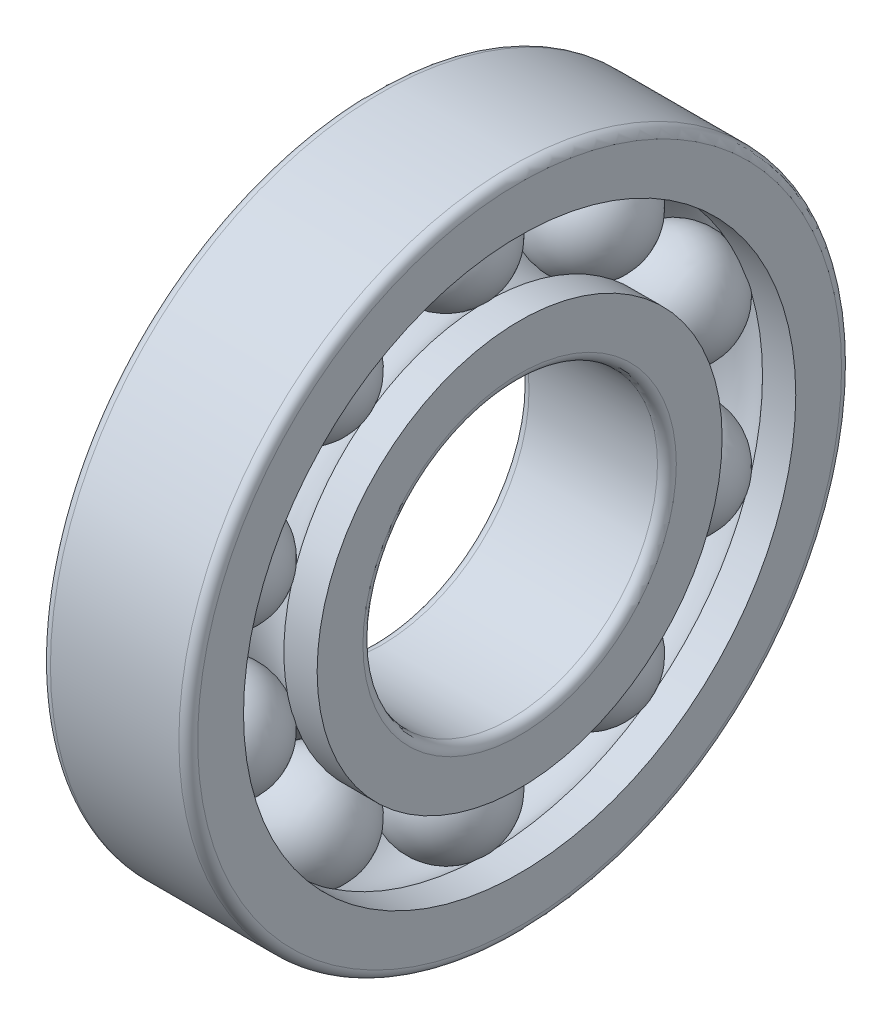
ISO-10303-21;
HEADER;
FILE_DESCRIPTION(('STEP AP214'),'2;1');
FILE_NAME('part.step','',(''),(''),'','','');
FILE_SCHEMA(('AUTOMOTIVE_DESIGN { 1 0 10303 214 1 1 1 1 }'));
ENDSEC;
DATA;
#1=APPLICATION_CONTEXT('core data for automotive mechanical design processes');
#2=APPLICATION_PROTOCOL_DEFINITION('international standard','automotive_design',2000,#1);
#3=PRODUCT_CONTEXT('',#1,'mechanical');
#4=PRODUCT('Part','Part','',(#3));
#5=PRODUCT_RELATED_PRODUCT_CATEGORY('part','',(#4));
#6=PRODUCT_DEFINITION_FORMATION('','',#4);
#7=PRODUCT_DEFINITION_CONTEXT('part definition',#1,'design');
#8=PRODUCT_DEFINITION('design','',#6,#7);
#9=PRODUCT_DEFINITION_SHAPE('','',#8);
#10=(LENGTH_UNIT() NAMED_UNIT(*) SI_UNIT(.MILLI.,.METRE.));
#11=(NAMED_UNIT(*) PLANE_ANGLE_UNIT() SI_UNIT($,.RADIAN.));
#12=(NAMED_UNIT(*) SI_UNIT($,.STERADIAN.) SOLID_ANGLE_UNIT());
#13=UNCERTAINTY_MEASURE_WITH_UNIT(LENGTH_MEASURE(1.E-05),#10,'distance_accuracy_value','');
#14=(GEOMETRIC_REPRESENTATION_CONTEXT(3) GLOBAL_UNCERTAINTY_ASSIGNED_CONTEXT((#13)) GLOBAL_UNIT_ASSIGNED_CONTEXT((#10,
#11,#12)) REPRESENTATION_CONTEXT('',''));
#15=CARTESIAN_POINT('',(0.,0.,0.));
#16=DIRECTION('',(0.,0.,1.));
#17=DIRECTION('',(1.,0.,0.));
#18=AXIS2_PLACEMENT_3D('',#15,#16,#17);
#19=CARTESIAN_POINT('',(0.,0.,0.));
#20=DIRECTION('',(1.,0.,0.));
#21=DIRECTION('',(0.,0.,-1.));
#22=AXIS2_PLACEMENT_3D('',#19,#20,#21);
#23=TOROIDAL_SURFACE('',#22,10.31875,2.35625);
#24=CARTESIAN_POINT('',(1.7411943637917,0.,0.));
#25=DIRECTION('',(1.,0.,0.));
#26=DIRECTION('',(0.,0.,-1.));
#27=AXIS2_PLACEMENT_3D('',#24,#25,#26);
#28=CIRCLE('',#27,8.73125);
#29=CARTESIAN_POINT('',(1.7411943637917,6.8730423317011,5.3847948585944));
#30=VERTEX_POINT('',#29);
#31=CARTESIAN_POINT('',(1.7411943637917,2.99735735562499,8.20064481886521));
#32=VERTEX_POINT('',#31);
#33=EDGE_CURVE('E499',#30,#32,#28,.T.);
#34=ORIENTED_EDGE('',*,*,#33,.F.);
#35=CARTESIAN_POINT('',(-1.7413943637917,6.87321748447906,5.3849270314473));
#36=CARTESIAN_POINT('',(-1.69673991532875,6.83410629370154,5.35541317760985));
#37=CARTESIAN_POINT('',(-1.65003862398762,6.79652065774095,5.32704581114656));
#38=CARTESIAN_POINT('',(-1.55283997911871,6.72462636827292,5.27277659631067));
#39=CARTESIAN_POINT('',(-1.50234280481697,6.69031756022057,5.2468746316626));
#40=CARTESIAN_POINT('',(-1.34577294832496,6.5927493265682,5.17320428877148));
#41=CARTESIAN_POINT('',(-1.23446974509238,6.53471506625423,5.12937106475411));
#42=CARTESIAN_POINT('',(-1.00123625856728,6.43439016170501,5.05358136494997));
#43=CARTESIAN_POINT('',(-0.879300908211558,6.39210707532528,5.02163059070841));
#44=CARTESIAN_POINT('',(-0.62826373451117,6.32447552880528,4.970519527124));
#45=CARTESIAN_POINT('',(-0.499162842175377,6.2991248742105,4.95135758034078));
#46=CARTESIAN_POINT('',(-0.237470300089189,6.26607950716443,4.92637848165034));
#47=CARTESIAN_POINT('',(-0.104878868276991,6.25838369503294,4.92056049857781));
#48=CARTESIAN_POINT('',(0.160046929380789,6.26085842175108,4.92243128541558));
#49=CARTESIAN_POINT('',(0.29238128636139,6.2710295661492,4.93012051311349));
#50=CARTESIAN_POINT('',(0.553020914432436,6.30895277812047,4.95878613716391));
#51=CARTESIAN_POINT('',(0.681326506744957,6.33670344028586,4.97976147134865));
#52=CARTESIAN_POINT('',(0.930272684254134,6.40899518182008,5.03439196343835));
#53=CARTESIAN_POINT('',(1.0509133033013,6.45353618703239,5.06804706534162));
#54=CARTESIAN_POINT('',(1.2731805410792,6.55455733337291,5.14435796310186));
#55=CARTESIAN_POINT('',(1.37554482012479,6.61000112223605,5.18623210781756));
#56=CARTESIAN_POINT('',(1.5199440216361,6.70218570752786,5.2558347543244));
#57=CARTESIAN_POINT('',(1.56657214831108,6.73443418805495,5.28018047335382));
#58=CARTESIAN_POINT('',(1.65652336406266,6.80175436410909,5.33099587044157));
#59=CARTESIAN_POINT('',(1.69984615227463,6.83682631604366,5.3574657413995));
#60=CARTESIAN_POINT('',(1.7413943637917,6.87321748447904,5.38492703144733));
#61=B_SPLINE_CURVE_WITH_KNOTS('',3,(#35,#36,#37,#38,#39,#40,#41,#42,#43,#44,#45,#46,#47,#48,#49,
#50,#51,#52,#53,#54,#55,#56,#57,#58,#59,#60),.UNSPECIFIED.,.F.,.F.,(4,2,2,2,2,2,2,2,2,2,2,2,4),
(0.,0.198757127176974,0.397504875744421,0.794331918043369,1.19134912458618,1.58831486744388,
1.98525588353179,2.38221035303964,2.77913309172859,3.17605407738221,3.54557671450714,
3.73051049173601,3.91546108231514),.UNSPECIFIED.);
#62=CARTESIAN_POINT('',(-1.74119436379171,6.8730423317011,5.3847948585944));
#63=VERTEX_POINT('',#62);
#64=EDGE_CURVE('E309',#63,#30,#61,.T.);
#65=ORIENTED_EDGE('',*,*,#64,.F.);
#66=CARTESIAN_POINT('',(-1.7411943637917,0.,0.));
#67=DIRECTION('',(1.,0.,0.));
#68=DIRECTION('',(0.,0.,-1.));
#69=AXIS2_PLACEMENT_3D('',#66,#67,#68);
#70=CIRCLE('',#69,8.73125);
#71=CARTESIAN_POINT('',(-1.7411943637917,2.99735735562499,8.20064481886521));
#72=VERTEX_POINT('',#71);
#73=EDGE_CURVE('E557',#63,#72,#70,.T.);
#74=ORIENTED_EDGE('',*,*,#73,.T.);
#75=CARTESIAN_POINT('',(1.7413943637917,2.99742893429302,8.20085224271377));
#76=CARTESIAN_POINT('',(1.69673991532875,2.98144561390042,8.15453500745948));
#77=CARTESIAN_POINT('',(1.65003862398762,2.96608124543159,8.11002294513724));
#78=CARTESIAN_POINT('',(1.55283997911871,2.93668471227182,8.02487730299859));
#79=CARTESIAN_POINT('',(1.50234280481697,2.92265248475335,7.98424354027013));
#80=CARTESIAN_POINT('',(1.34577294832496,2.88273806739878,7.86868524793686));
#81=CARTESIAN_POINT('',(1.23446974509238,2.85898376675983,7.79994617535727));
#82=CARTESIAN_POINT('',(1.00123625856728,2.8179055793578,7.681111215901));
#83=CARTESIAN_POINT('',(0.879300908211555,2.80058477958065,7.6310242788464));
#84=CARTESIAN_POINT('',(0.628263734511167,2.77287456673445,7.55090866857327));
#85=CARTESIAN_POINT('',(0.499162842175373,2.76248425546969,7.52087739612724));
#86=CARTESIAN_POINT('',(0.237470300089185,2.74893930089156,7.4817304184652));
#87=CARTESIAN_POINT('',(0.104878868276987,2.74578420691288,7.47261341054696));
#88=CARTESIAN_POINT('',(-0.160046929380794,2.74679869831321,7.47554512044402));
#89=CARTESIAN_POINT('',(-0.292381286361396,2.75096853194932,7.4875945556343));
#90=CARTESIAN_POINT('',(-0.553020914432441,2.76651224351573,7.53251983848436));
#91=CARTESIAN_POINT('',(-0.681326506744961,2.77788554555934,7.56539402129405));
#92=CARTESIAN_POINT('',(-0.930272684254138,2.80750285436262,7.65102930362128));
#93=CARTESIAN_POINT('',(-1.0509133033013,2.82574683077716,7.70379031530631));
#94=CARTESIAN_POINT('',(-1.2731805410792,2.86710555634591,7.82344849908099));
#95=CARTESIAN_POINT('',(-1.37554482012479,2.88979716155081,7.88911849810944));
#96=CARTESIAN_POINT('',(-1.5199440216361,2.92750660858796,7.99829964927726));
#97=CARTESIAN_POINT('',(-1.56657214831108,2.94069543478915,8.03649301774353));
#98=CARTESIAN_POINT('',(-1.65652336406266,2.96822067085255,8.11622113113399));
#99=CARTESIAN_POINT('',(-1.69984615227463,2.98255718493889,8.15775617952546));
#100=CARTESIAN_POINT('',(-1.7413943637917,2.99742893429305,8.20085224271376));
#101=B_SPLINE_CURVE_WITH_KNOTS('',3,(#75,#76,#77,#78,#79,#80,#81,#82,#83,#84,#85,#86,#87,#88,
#89,#90,#91,#92,#93,#94,#95,#96,#97,#98,#99,#100),.UNSPECIFIED.,.F.,.F.,(4,2,2,2,2,2,2,2,2,2,2,
2,4),(0.,0.198757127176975,0.397504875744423,0.794331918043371,1.19134912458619,
1.58831486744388,1.9852558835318,2.38221035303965,2.77913309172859,3.17605407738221,
3.54557671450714,3.73051049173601,3.91546108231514),.UNSPECIFIED.);
#102=EDGE_CURVE('E502',#32,#72,#101,.T.);
#103=ORIENTED_EDGE('',*,*,#102,.F.);
#104=EDGE_LOOP('',(#34,#65,#74,#103));
#105=FACE_BOUND('',#104,.T.);
#106=ADVANCED_FACE('F39',(#105),#23,.F.);
#107=CARTESIAN_POINT('',(-1.74119436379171,8.72551105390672,0.316517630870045));
#108=VERTEX_POINT('',#107);
#109=CARTESIAN_POINT('',(-1.7411943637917,7.24513112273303,4.87265857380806));
#110=VERTEX_POINT('',#109);
#111=EDGE_CURVE('E327',#108,#110,#70,.T.);
#112=ORIENTED_EDGE('',*,*,#111,.T.);
#113=CARTESIAN_POINT('',(1.7413943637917,7.24531095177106,4.87278431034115));
#114=CARTESIAN_POINT('',(1.69673991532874,7.20515558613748,4.84470763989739));
#115=CARTESIAN_POINT('',(1.65003862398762,7.16656201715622,4.81772757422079));
#116=CARTESIAN_POINT('',(1.55283997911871,7.09273236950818,4.7661221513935));
#117=CARTESIAN_POINT('',(1.50234280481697,7.05749613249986,4.74149668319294));
#118=CARTESIAN_POINT('',(1.34577294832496,6.95728123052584,4.67146916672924));
#119=CARTESIAN_POINT('',(1.23446974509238,6.8976597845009,4.62982051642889));
#120=CARTESIAN_POINT('',(1.00123625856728,6.79457739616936,4.55782616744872));
#121=CARTESIAN_POINT('',(0.879300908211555,6.75112421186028,4.52748589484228));
#122=CARTESIAN_POINT('',(0.628263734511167,6.68161540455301,4.47895865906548));
#123=CARTESIAN_POINT('',(0.499162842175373,6.65555752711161,4.46077012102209));
#124=CARTESIAN_POINT('',(0.237470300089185,6.6215894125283,4.43706107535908));
#125=CARTESIAN_POINT('',(0.104878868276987,6.61367804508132,4.43153977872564));
#126=CARTESIAN_POINT('',(-0.160046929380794,6.61622200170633,4.43331527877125));
#127=CARTESIAN_POINT('',(-0.292381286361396,6.62667794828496,4.44061250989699));
#128=CARTESIAN_POINT('',(-0.553020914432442,6.66565949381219,4.46782146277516));
#129=CARTESIAN_POINT('',(-0.681326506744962,6.69418364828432,4.48773217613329));
#130=CARTESIAN_POINT('',(-0.930272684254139,6.76847971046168,4.53960395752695));
#131=CARTESIAN_POINT('',(-1.0509133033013,6.81425154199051,4.57156497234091));
#132=CARTESIAN_POINT('',(-1.2731805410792,6.91804476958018,4.64406042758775));
#133=CARTESIAN_POINT('',(-1.37554482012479,6.97500252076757,4.68385078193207));
#134=CARTESIAN_POINT('',(-1.5199440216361,7.06968517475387,4.75001513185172));
#135=CARTESIAN_POINT('',(-1.56657214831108,7.10280465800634,4.77316201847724));
#136=CARTESIAN_POINT('',(-1.65652336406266,7.17193605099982,4.82148448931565));
#137=CARTESIAN_POINT('',(-1.69984615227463,7.20794822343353,4.8466602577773));
#138=CARTESIAN_POINT('',(-1.7413943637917,7.24531095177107,4.87278431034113));
#139=B_SPLINE_CURVE_WITH_KNOTS('',3,(#113,#114,#115,#116,#117,#118,#119,#120,#121,#122,#123,
#124,#125,#126,#127,#128,#129,#130,#131,#132,#133,#134,#135,#136,#137,#138),.UNSPECIFIED.,.F.,
.F.,(4,2,2,2,2,2,2,2,2,2,2,2,4),(0.,0.198757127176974,0.397504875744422,0.794331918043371,
1.19134912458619,1.58831486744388,1.9852558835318,2.38221035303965,2.7791330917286,
3.17605407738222,3.54557671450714,3.73051049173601,3.91546108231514),.UNSPECIFIED.);
#140=CARTESIAN_POINT('',(1.7411943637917,7.24513112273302,4.87265857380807));
#141=VERTEX_POINT('',#140);
#142=EDGE_CURVE('E60',#141,#110,#139,.T.);
#143=ORIENTED_EDGE('',*,*,#142,.F.);
#144=CARTESIAN_POINT('',(1.7411943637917,8.72551105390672,0.316517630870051));
#145=VERTEX_POINT('',#144);
#146=EDGE_CURVE('E445',#145,#141,#28,.T.);
#147=ORIENTED_EDGE('',*,*,#146,.F.);
#148=CARTESIAN_POINT('',(-1.7413943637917,8.72573044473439,0.316521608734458));
#149=CARTESIAN_POINT('',(-1.69673991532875,8.67674101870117,0.315633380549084));
#150=CARTESIAN_POINT('',(-1.65003862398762,8.62965968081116,0.314775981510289));
#151=CARTESIAN_POINT('',(-1.55283997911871,8.53959733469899,0.313129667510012));
#152=CARTESIAN_POINT('',(-1.50234280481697,8.49661613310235,0.312340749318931));
#153=CARTESIAN_POINT('',(-1.34577294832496,8.37437943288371,0.310089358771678));
#154=CARTESIAN_POINT('',(-1.23446974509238,8.30166420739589,0.308739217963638));
#155=CARTESIAN_POINT('',(-1.00123625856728,8.17595158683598,0.306393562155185));
#156=CARTESIAN_POINT('',(-0.879300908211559,8.12296365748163,0.305398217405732));
#157=CARTESIAN_POINT('',(-0.628263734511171,8.03820625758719,0.30380132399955));
#158=CARTESIAN_POINT('',(-0.499162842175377,8.0064340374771,0.303199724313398));
#159=CARTESIAN_POINT('',(-0.237470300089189,7.96501742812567,0.30241478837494));
#160=CARTESIAN_POINT('',(-0.104878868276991,7.95537166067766,0.302231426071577));
#161=CARTESIAN_POINT('',(0.160046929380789,7.95847337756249,0.302290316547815));
#162=CARTESIAN_POINT('',(0.29238128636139,7.97122162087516,0.302532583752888));
#163=CARTESIAN_POINT('',(0.553020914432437,8.0187513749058,0.303432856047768));
#164=CARTESIAN_POINT('',(0.681326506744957,8.05353112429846,0.304090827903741));
#165=CARTESIAN_POINT('',(0.930272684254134,8.14412736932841,0.305795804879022));
#166=CARTESIAN_POINT('',(1.05091330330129,8.19994377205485,0.306842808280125));
#167=CARTESIAN_POINT('',(1.2731805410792,8.32652601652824,0.309200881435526));
#168=CARTESIAN_POINT('',(1.37554482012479,8.3959939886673,0.310488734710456));
#169=CARTESIAN_POINT('',(1.5199440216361,8.51148429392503,0.31261371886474));
#170=CARTESIAN_POINT('',(1.56657214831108,8.55188391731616,0.313354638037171));
#171=CARTESIAN_POINT('',(1.65652336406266,8.63621562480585,0.314895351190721));
#172=CARTESIAN_POINT('',(1.69984615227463,8.68014802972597,0.315695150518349));
#173=CARTESIAN_POINT('',(1.7413943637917,8.72573044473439,0.316521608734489));
#174=B_SPLINE_CURVE_WITH_KNOTS('',3,(#148,#149,#150,#151,#152,#153,#154,#155,#156,#157,#158,
#159,#160,#161,#162,#163,#164,#165,#166,#167,#168,#169,#170,#171,#172,#173),.UNSPECIFIED.,.F.,
.F.,(4,2,2,2,2,2,2,2,2,2,2,2,4),(0.,0.198757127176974,0.39750487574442,0.794331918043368,
1.19134912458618,1.58831486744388,1.98525588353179,2.38221035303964,2.77913309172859,
3.17605407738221,3.54557671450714,3.73051049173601,3.91546108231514),.UNSPECIFIED.);
#175=EDGE_CURVE('E444',#108,#145,#174,.T.);
#176=ORIENTED_EDGE('',*,*,#175,.F.);
#177=EDGE_LOOP('',(#112,#143,#147,#176));
#178=FACE_BOUND('',#177,.T.);
#179=ADVANCED_FACE('F467',(#178),#23,.F.);
#180=CARTESIAN_POINT('',(-20.6375,0.,0.));
#181=DIRECTION('',(1.,0.,0.));
#182=DIRECTION('',(0.,0.,-1.));
#183=AXIS2_PLACEMENT_3D('',#180,#181,#182);
#184=CYLINDRICAL_SURFACE('',#183,8.73125);
#185=CARTESIAN_POINT('',(3.175,0.,0.));
#186=DIRECTION('',(1.,0.,0.));
#187=DIRECTION('',(0.,0.,-1.));
#188=AXIS2_PLACEMENT_3D('',#185,#186,#187);
#189=CIRCLE('',#188,8.73125);
#190=CARTESIAN_POINT('',(3.175,0.,-8.73125));
#191=VERTEX_POINT('',#190);
#192=EDGE_CURVE('E537',#191,#191,#189,.T.);
#193=ORIENTED_EDGE('',*,*,#192,.F.);
#194=EDGE_LOOP('',(#193));
#195=FACE_BOUND('',#194,.T.);
#196=ORIENTED_EDGE('',*,*,#146,.T.);
#197=CARTESIAN_POINT('',(1.7409943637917,6.87246902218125,5.38552653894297));
#198=CARTESIAN_POINT('',(1.7498751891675,6.89789318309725,5.35308398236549));
#199=CARTESIAN_POINT('',(1.75703457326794,6.92330174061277,5.32018445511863));
#200=CARTESIAN_POINT('',(1.7678517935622,6.97392038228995,5.25365701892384));
#201=CARTESIAN_POINT('',(1.7715090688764,6.99913043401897,5.22002899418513));
#202=CARTESIAN_POINT('',(1.77706573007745,7.07325881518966,5.11962076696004));
#203=CARTESIAN_POINT('',(1.77388587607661,7.12164401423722,5.05208174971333));
#204=CARTESIAN_POINT('',(1.75839434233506,7.19476094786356,4.94695082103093));
#205=CARTESIAN_POINT('',(1.75073902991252,7.22049659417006,4.90931416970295));
#206=CARTESIAN_POINT('',(1.7409943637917,7.24564982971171,4.8718872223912));
#207=B_SPLINE_CURVE_WITH_KNOTS('',3,(#197,#198,#199,#200,#201,#202,#203,#204,#205,#206),
.UNSPECIFIED.,.F.,.F.,(4,2,2,2,4),(0.,0.126411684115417,0.252843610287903,0.50095403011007,
0.639423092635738),.UNSPECIFIED.);
#208=EDGE_CURVE('E1392',#30,#141,#207,.T.);
#209=ORIENTED_EDGE('',*,*,#208,.F.);
#210=ORIENTED_EDGE('',*,*,#33,.T.);
#211=CARTESIAN_POINT('',(1.7409943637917,2.3944111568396,8.39651843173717));
#212=CARTESIAN_POINT('',(1.7498751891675,2.43404899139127,8.38521579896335));
#213=CARTESIAN_POINT('',(1.75703457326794,2.47394280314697,8.37353429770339));
#214=CARTESIAN_POINT('',(1.7678517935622,2.55399799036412,8.34946536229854));
#215=CARTESIAN_POINT('',(1.77150906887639,2.5941594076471,8.33707781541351));
#216=CARTESIAN_POINT('',(1.77706573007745,2.71314900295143,8.29941742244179));
#217=CARTESIAN_POINT('',(1.77388587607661,2.79199188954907,8.27321731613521));
#218=CARTESIAN_POINT('',(1.75839434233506,2.91293914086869,8.23114166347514));
#219=CARTESIAN_POINT('',(1.75073902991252,2.95588198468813,8.21582000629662));
#220=CARTESIAN_POINT('',(1.7409943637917,2.99823038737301,8.20032567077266));
#221=B_SPLINE_CURVE_WITH_KNOTS('',3,(#211,#212,#213,#214,#215,#216,#217,#218,#219,#220),
.UNSPECIFIED.,.F.,.F.,(4,2,2,2,4),(0.,0.126411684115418,0.252843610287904,0.50095403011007,
0.639423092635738),.UNSPECIFIED.);
#222=CARTESIAN_POINT('',(1.7411943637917,2.39530504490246,8.3962634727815));
#223=VERTEX_POINT('',#222);
#224=EDGE_CURVE('E700',#223,#32,#221,.T.);
#225=ORIENTED_EDGE('',*,*,#224,.F.);
#226=CARTESIAN_POINT('',(1.7411943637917,-2.39530504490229,8.39626347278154));
#227=VERTEX_POINT('',#226);
#228=EDGE_CURVE('E507',#223,#227,#28,.T.);
#229=ORIENTED_EDGE('',*,*,#228,.T.);
#230=CARTESIAN_POINT('',(1.7409943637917,-2.99823038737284,8.20032567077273));
#231=CARTESIAN_POINT('',(1.7498751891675,-2.95951918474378,8.21448018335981));
#232=CARTESIAN_POINT('',(1.75703457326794,-2.92037819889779,8.22847864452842));
#233=CARTESIAN_POINT('',(1.7678517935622,-2.84146482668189,8.25606172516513));
#234=CARTESIAN_POINT('',(1.77150906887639,-2.80169234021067,8.26964627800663));
#235=CARTESIAN_POINT('',(1.77706573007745,-2.68329151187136,8.30911870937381));
#236=CARTESIAN_POINT('',(1.77388587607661,-2.60410624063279,8.33426506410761));
#237=CARTESIAN_POINT('',(1.75839434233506,-2.48152641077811,8.37131615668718));
#238=CARTESIAN_POINT('',(1.75073902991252,-2.43777907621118,8.38416184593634));
#239=CARTESIAN_POINT('',(1.7409943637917,-2.39441115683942,8.39651843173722));
#240=B_SPLINE_CURVE_WITH_KNOTS('',3,(#230,#231,#232,#233,#234,#235,#236,#237,#238,#239),
.UNSPECIFIED.,.F.,.F.,(4,2,2,2,4),(0.,0.126411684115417,0.252843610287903,0.50095403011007,
0.639423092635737),.UNSPECIFIED.);
#241=CARTESIAN_POINT('',(1.7411943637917,-2.99735735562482,8.20064481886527));
#242=VERTEX_POINT('',#241);
#243=EDGE_CURVE('E810',#242,#227,#240,.T.);
#244=ORIENTED_EDGE('',*,*,#243,.F.);
#245=CARTESIAN_POINT('',(1.7411943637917,-6.87304233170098,5.38479485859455));
#246=VERTEX_POINT('',#245);
#247=EDGE_CURVE('E510',#242,#246,#28,.T.);
#248=ORIENTED_EDGE('',*,*,#247,.T.);
#249=CARTESIAN_POINT('',(1.7409943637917,-7.2456498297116,4.87188722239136));
#250=CARTESIAN_POINT('',(1.7498751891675,-7.22265162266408,4.90609233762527));
#251=CARTESIAN_POINT('',(1.75703457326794,-7.19921398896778,4.94042382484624));
#252=CARTESIAN_POINT('',(1.7678517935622,-7.15158465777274,5.00912312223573));
#253=CARTESIAN_POINT('',(1.7715090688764,-7.12739284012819,5.04349093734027));
#254=CARTESIAN_POINT('',(1.77706573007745,-7.05480587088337,5.14501906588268));
#255=CARTESIAN_POINT('',(1.77388587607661,-7.00552429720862,5.21190682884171));
#256=CARTESIAN_POINT('',(1.75839434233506,-6.92813321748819,5.31393240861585));
#257=CARTESIAN_POINT('',(1.75073902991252,-6.90029138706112,5.35003882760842));
#258=CARTESIAN_POINT('',(1.7409943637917,-6.87246902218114,5.38552653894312));
#259=B_SPLINE_CURVE_WITH_KNOTS('',3,(#249,#250,#251,#252,#253,#254,#255,#256,#257,#258),
.UNSPECIFIED.,.F.,.F.,(4,2,2,2,4),(0.,0.126411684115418,0.252843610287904,0.500954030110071,
0.639423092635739),.UNSPECIFIED.);
#260=CARTESIAN_POINT('',(1.7411943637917,-7.24513112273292,4.87265857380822));
#261=VERTEX_POINT('',#260);
#262=EDGE_CURVE('E875',#261,#246,#259,.T.);
#263=ORIENTED_EDGE('',*,*,#262,.F.);
#264=CARTESIAN_POINT('',(1.7411943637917,-8.72551105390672,0.316517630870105));
#265=VERTEX_POINT('',#264);
#266=EDGE_CURVE('E514',#261,#265,#28,.T.);
#267=ORIENTED_EDGE('',*,*,#266,.T.);
#268=CARTESIAN_POINT('',(1.7409943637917,-8.72547730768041,-0.317446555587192));
#269=CARTESIAN_POINT('',(1.7498751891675,-8.72697662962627,-0.276256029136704));
#270=CARTESIAN_POINT('',(1.75703457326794,-8.72819472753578,-0.234704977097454));
#271=CARTESIAN_POINT('',(1.7678517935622,-8.73004222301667,-0.151130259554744));
#272=CARTESIAN_POINT('',(1.77150906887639,-8.73067152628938,-0.109106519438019));
#273=CARTESIAN_POINT('',(1.77706573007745,-8.73162417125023,0.0156970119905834));
#274=CARTESIAN_POINT('',(1.77388587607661,-8.73107018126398,0.0987773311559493));
#275=CARTESIAN_POINT('',(1.75839434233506,-8.72842861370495,0.226807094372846));
#276=CARTESIAN_POINT('',(1.75073902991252,-8.72712692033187,0.272382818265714));
#277=CARTESIAN_POINT('',(1.7409943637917,-8.72547730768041,0.317446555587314));
#278=B_SPLINE_CURVE_WITH_KNOTS('',3,(#268,#269,#270,#271,#272,#273,#274,#275,#276,#277),
.UNSPECIFIED.,.F.,.F.,(4,2,2,2,4),(0.,0.126411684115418,0.252843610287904,0.50095403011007,
0.639423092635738),.UNSPECIFIED.);
#279=CARTESIAN_POINT('',(1.7411943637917,-8.72551105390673,-0.31651763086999));
#280=VERTEX_POINT('',#279);
#281=EDGE_CURVE('E940',#280,#265,#278,.T.);
#282=ORIENTED_EDGE('',*,*,#281,.F.);
#283=CARTESIAN_POINT('',(1.7411943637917,-7.24513112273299,-4.87265857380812));
#284=VERTEX_POINT('',#283);
#285=EDGE_CURVE('E518',#280,#284,#28,.T.);
#286=ORIENTED_EDGE('',*,*,#285,.T.);
#287=CARTESIAN_POINT('',(1.7409943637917,-6.87246902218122,-5.38552653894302));
#288=CARTESIAN_POINT('',(1.7498751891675,-6.89789318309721,-5.35308398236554));
#289=CARTESIAN_POINT('',(1.75703457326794,-6.92330174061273,-5.32018445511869));
#290=CARTESIAN_POINT('',(1.7678517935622,-6.97392038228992,-5.25365701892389));
#291=CARTESIAN_POINT('',(1.7715090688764,-6.99913043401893,-5.22002899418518));
#292=CARTESIAN_POINT('',(1.77706573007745,-7.07325881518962,-5.1196207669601));
#293=CARTESIAN_POINT('',(1.77388587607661,-7.12164401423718,-5.05208174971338));
#294=CARTESIAN_POINT('',(1.75839434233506,-7.19476094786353,-4.94695082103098));
#295=CARTESIAN_POINT('',(1.75073902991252,-7.22049659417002,-4.90931416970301));
#296=CARTESIAN_POINT('',(1.7409943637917,-7.24564982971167,-4.87188722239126));
#297=B_SPLINE_CURVE_WITH_KNOTS('',3,(#287,#288,#289,#290,#291,#292,#293,#294,#295,#296),
.UNSPECIFIED.,.F.,.F.,(4,2,2,2,4),(0.,0.126411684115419,0.252843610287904,0.50095403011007,
0.639423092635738),.UNSPECIFIED.);
#298=CARTESIAN_POINT('',(1.7411943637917,-6.87304233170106,-5.38479485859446));
#299=VERTEX_POINT('',#298);
#300=EDGE_CURVE('E1005',#299,#284,#297,.T.);
#301=ORIENTED_EDGE('',*,*,#300,.F.);
#302=CARTESIAN_POINT('',(1.7411943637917,-2.99735735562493,-8.20064481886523));
#303=VERTEX_POINT('',#302);
#304=EDGE_CURVE('E522',#299,#303,#28,.T.);
#305=ORIENTED_EDGE('',*,*,#304,.T.);
#306=CARTESIAN_POINT('',(1.7409943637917,-2.39441115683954,-8.39651843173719));
#307=CARTESIAN_POINT('',(1.7498751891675,-2.43404899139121,-8.38521579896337));
#308=CARTESIAN_POINT('',(1.75703457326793,-2.47394280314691,-8.37353429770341));
#309=CARTESIAN_POINT('',(1.7678517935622,-2.55399799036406,-8.34946536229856));
#310=CARTESIAN_POINT('',(1.77150906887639,-2.59415940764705,-8.33707781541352));
#311=CARTESIAN_POINT('',(1.77706573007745,-2.71314900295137,-8.29941742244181));
#312=CARTESIAN_POINT('',(1.77388587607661,-2.79199188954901,-8.27321731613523));
#313=CARTESIAN_POINT('',(1.75839434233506,-2.91293914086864,-8.23114166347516));
#314=CARTESIAN_POINT('',(1.75073902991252,-2.95588198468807,-8.21582000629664));
#315=CARTESIAN_POINT('',(1.7409943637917,-2.99823038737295,-8.20032567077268));
#316=B_SPLINE_CURVE_WITH_KNOTS('',3,(#306,#307,#308,#309,#310,#311,#312,#313,#314,#315),
.UNSPECIFIED.,.F.,.F.,(4,2,2,2,4),(0.,0.126411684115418,0.252843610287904,0.50095403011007,
0.639423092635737),.UNSPECIFIED.);
#317=CARTESIAN_POINT('',(1.7411943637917,-2.39530504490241,-8.39626347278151));
#318=VERTEX_POINT('',#317);
#319=EDGE_CURVE('E1070',#318,#303,#316,.T.);
#320=ORIENTED_EDGE('',*,*,#319,.F.);
#321=CARTESIAN_POINT('',(1.7411943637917,2.39530504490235,-8.39626347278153));
#322=VERTEX_POINT('',#321);
#323=EDGE_CURVE('E526',#318,#322,#28,.T.);
#324=ORIENTED_EDGE('',*,*,#323,.T.);
#325=CARTESIAN_POINT('',(1.7409943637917,2.99823038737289,-8.2003256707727));
#326=CARTESIAN_POINT('',(1.7498751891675,2.95951918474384,-8.21448018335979));
#327=CARTESIAN_POINT('',(1.75703457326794,2.92037819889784,-8.2284786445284));
#328=CARTESIAN_POINT('',(1.7678517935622,2.84146482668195,-8.25606172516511));
#329=CARTESIAN_POINT('',(1.77150906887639,2.80169234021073,-8.26964627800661));
#330=CARTESIAN_POINT('',(1.77706573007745,2.68329151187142,-8.30911870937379));
#331=CARTESIAN_POINT('',(1.77388587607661,2.60410624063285,-8.33426506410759));
#332=CARTESIAN_POINT('',(1.75839434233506,2.48152641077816,-8.37131615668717));
#333=CARTESIAN_POINT('',(1.75073902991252,2.43777907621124,-8.38416184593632));
#334=CARTESIAN_POINT('',(1.7409943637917,2.39441115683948,-8.39651843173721));
#335=B_SPLINE_CURVE_WITH_KNOTS('',3,(#325,#326,#327,#328,#329,#330,#331,#332,#333,#334),
.UNSPECIFIED.,.F.,.F.,(4,2,2,2,4),(0.,0.126411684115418,0.252843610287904,0.50095403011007,
0.639423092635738),.UNSPECIFIED.);
#336=CARTESIAN_POINT('',(1.7411943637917,2.99735735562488,-8.20064481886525));
#337=VERTEX_POINT('',#336);
#338=EDGE_CURVE('E1134',#337,#322,#335,.T.);
#339=ORIENTED_EDGE('',*,*,#338,.F.);
#340=CARTESIAN_POINT('',(1.7411943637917,6.87304233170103,-5.3847948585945));
#341=VERTEX_POINT('',#340);
#342=EDGE_CURVE('E530',#337,#341,#28,.T.);
#343=ORIENTED_EDGE('',*,*,#342,.T.);
#344=CARTESIAN_POINT('',(1.7409943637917,7.24564982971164,-4.87188722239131));
#345=CARTESIAN_POINT('',(1.7498751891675,7.22265162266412,-4.90609233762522));
#346=CARTESIAN_POINT('',(1.75703457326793,7.19921398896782,-4.94042382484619));
#347=CARTESIAN_POINT('',(1.7678517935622,7.15158465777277,-5.00912312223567));
#348=CARTESIAN_POINT('',(1.77150906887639,7.12739284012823,-5.04349093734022));
#349=CARTESIAN_POINT('',(1.77706573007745,7.05480587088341,-5.14501906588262));
#350=CARTESIAN_POINT('',(1.77388587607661,7.00552429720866,-5.21190682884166));
#351=CARTESIAN_POINT('',(1.75839434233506,6.92813321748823,-5.3139324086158));
#352=CARTESIAN_POINT('',(1.75073902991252,6.90029138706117,-5.35003882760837));
#353=CARTESIAN_POINT('',(1.7409943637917,6.87246902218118,-5.38552653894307));
#354=B_SPLINE_CURVE_WITH_KNOTS('',3,(#344,#345,#346,#347,#348,#349,#350,#351,#352,#353),
.UNSPECIFIED.,.F.,.F.,(4,2,2,2,4),(0.,0.126411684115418,0.252843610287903,0.500954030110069,
0.639423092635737),.UNSPECIFIED.);
#355=CARTESIAN_POINT('',(1.7411943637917,7.24513112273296,-4.87265857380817));
#356=VERTEX_POINT('',#355);
#357=EDGE_CURVE('E606',#356,#341,#354,.T.);
#358=ORIENTED_EDGE('',*,*,#357,.F.);
#359=CARTESIAN_POINT('',(1.7411943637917,8.72551105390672,-0.316517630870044));
#360=VERTEX_POINT('',#359);
#361=EDGE_CURVE('E509',#356,#360,#28,.T.);
#362=ORIENTED_EDGE('',*,*,#361,.T.);
#363=CARTESIAN_POINT('',(1.7409943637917,8.72547730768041,0.317446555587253));
#364=CARTESIAN_POINT('',(1.7498751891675,8.72697662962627,0.276256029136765));
#365=CARTESIAN_POINT('',(1.75703457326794,8.72819472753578,0.234704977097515));
#366=CARTESIAN_POINT('',(1.7678517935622,8.73004222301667,0.151130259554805));
#367=CARTESIAN_POINT('',(1.7715090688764,8.73067152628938,0.10910651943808));
#368=CARTESIAN_POINT('',(1.77706573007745,8.73162417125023,-0.0156970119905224));
#369=CARTESIAN_POINT('',(1.77388587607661,8.73107018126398,-0.0987773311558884));
#370=CARTESIAN_POINT('',(1.75839434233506,8.72842861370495,-0.226807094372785));
#371=CARTESIAN_POINT('',(1.75073902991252,8.72712692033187,-0.272382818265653));
#372=CARTESIAN_POINT('',(1.7409943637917,8.72547730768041,-0.317446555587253));
#373=B_SPLINE_CURVE_WITH_KNOTS('',3,(#363,#364,#365,#366,#367,#368,#369,#370,#371,#372),
.UNSPECIFIED.,.F.,.F.,(4,2,2,2,4),(0.,0.126411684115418,0.252843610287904,0.50095403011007,
0.639423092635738),.UNSPECIFIED.);
#374=EDGE_CURVE('E402',#145,#360,#373,.T.);
#375=ORIENTED_EDGE('',*,*,#374,.F.);
#376=EDGE_LOOP('',(#196,#209,#210,#225,#229,#244,#248,#263,#267,#282,#286,#301,#305,#320,#324,
#339,#343,#358,#362,#375));
#377=FACE_BOUND('',#376,.T.);
#378=ADVANCED_FACE('F431',(#195,#377),#184,.T.);
#379=CARTESIAN_POINT('',(-20.6375,0.,0.));
#380=DIRECTION('',(1.,0.,0.));
#381=DIRECTION('',(0.,0.,-1.));
#382=AXIS2_PLACEMENT_3D('',#379,#380,#381);
#383=CYLINDRICAL_SURFACE('',#382,8.73125);
#384=CARTESIAN_POINT('',(-3.175,0.,0.));
#385=DIRECTION('',(1.,0.,0.));
#386=DIRECTION('',(0.,0.,-1.));
#387=AXIS2_PLACEMENT_3D('',#384,#385,#386);
#388=CIRCLE('',#387,8.73125);
#389=CARTESIAN_POINT('',(-3.175,0.,-8.73125));
#390=VERTEX_POINT('',#389);
#391=EDGE_CURVE('E554',#390,#390,#388,.T.);
#392=ORIENTED_EDGE('',*,*,#391,.T.);
#393=EDGE_LOOP('',(#392));
#394=FACE_BOUND('',#393,.T.);
#395=ORIENTED_EDGE('',*,*,#73,.F.);
#396=CARTESIAN_POINT('',(-1.7409943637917,7.24564982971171,4.8718872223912));
#397=CARTESIAN_POINT('',(-1.7498751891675,7.22265162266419,4.90609233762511));
#398=CARTESIAN_POINT('',(-1.75703457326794,7.19921398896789,4.94042382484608));
#399=CARTESIAN_POINT('',(-1.7678517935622,7.15158465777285,5.00912312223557));
#400=CARTESIAN_POINT('',(-1.7715090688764,7.1273928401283,5.04349093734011));
#401=CARTESIAN_POINT('',(-1.77706573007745,7.05480587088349,5.14501906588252));
#402=CARTESIAN_POINT('',(-1.77388587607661,7.00552429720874,5.21190682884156));
#403=CARTESIAN_POINT('',(-1.75839434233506,6.92813321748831,5.3139324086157));
#404=CARTESIAN_POINT('',(-1.75073902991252,6.90029138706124,5.35003882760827));
#405=CARTESIAN_POINT('',(-1.7409943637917,6.87246902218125,5.38552653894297));
#406=B_SPLINE_CURVE_WITH_KNOTS('',3,(#396,#397,#398,#399,#400,#401,#402,#403,#404,#405),
.UNSPECIFIED.,.F.,.F.,(4,2,2,2,4),(0.,0.126411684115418,0.252843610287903,0.50095403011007,
0.639423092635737),.UNSPECIFIED.);
#407=EDGE_CURVE('E703',#110,#63,#406,.T.);
#408=ORIENTED_EDGE('',*,*,#407,.F.);
#409=ORIENTED_EDGE('',*,*,#111,.F.);
#410=CARTESIAN_POINT('',(-1.7409943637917,8.72547730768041,-0.317446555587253));
#411=CARTESIAN_POINT('',(-1.7498751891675,8.72697662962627,-0.276256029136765));
#412=CARTESIAN_POINT('',(-1.75703457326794,8.72819472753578,-0.234704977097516));
#413=CARTESIAN_POINT('',(-1.7678517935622,8.73004222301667,-0.151130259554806));
#414=CARTESIAN_POINT('',(-1.7715090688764,8.73067152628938,-0.109106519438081));
#415=CARTESIAN_POINT('',(-1.77706573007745,8.73162417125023,0.0156970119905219));
#416=CARTESIAN_POINT('',(-1.77388587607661,8.73107018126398,0.0987773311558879));
#417=CARTESIAN_POINT('',(-1.75839434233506,8.72842861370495,0.226807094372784));
#418=CARTESIAN_POINT('',(-1.75073902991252,8.72712692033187,0.272382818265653));
#419=CARTESIAN_POINT('',(-1.7409943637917,8.72547730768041,0.317446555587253));
#420=B_SPLINE_CURVE_WITH_KNOTS('',3,(#410,#411,#412,#413,#414,#415,#416,#417,#418,#419),
.UNSPECIFIED.,.F.,.F.,(4,2,2,2,4),(0.,0.126411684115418,0.252843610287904,0.500954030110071,
0.639423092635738),.UNSPECIFIED.);
#421=CARTESIAN_POINT('',(-1.7411943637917,8.72551105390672,-0.316517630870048));
#422=VERTEX_POINT('',#421);
#423=EDGE_CURVE('E436',#422,#108,#420,.T.);
#424=ORIENTED_EDGE('',*,*,#423,.F.);
#425=CARTESIAN_POINT('',(-1.74119436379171,7.24513112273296,-4.87265857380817));
#426=VERTEX_POINT('',#425);
#427=EDGE_CURVE('E322',#426,#422,#70,.T.);
#428=ORIENTED_EDGE('',*,*,#427,.F.);
#429=CARTESIAN_POINT('',(-1.7409943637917,6.87246902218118,-5.38552653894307));
#430=CARTESIAN_POINT('',(-1.7498751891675,6.89789318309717,-5.35308398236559));
#431=CARTESIAN_POINT('',(-1.75703457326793,6.92330174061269,-5.32018445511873));
#432=CARTESIAN_POINT('',(-1.7678517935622,6.97392038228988,-5.25365701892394));
#433=CARTESIAN_POINT('',(-1.77150906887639,6.9991304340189,-5.22002899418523));
#434=CARTESIAN_POINT('',(-1.77706573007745,7.07325881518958,-5.11962076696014));
#435=CARTESIAN_POINT('',(-1.77388587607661,7.12164401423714,-5.05208174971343));
#436=CARTESIAN_POINT('',(-1.75839434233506,7.19476094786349,-4.94695082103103));
#437=CARTESIAN_POINT('',(-1.75073902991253,7.22049659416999,-4.90931416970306));
#438=CARTESIAN_POINT('',(-1.7409943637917,7.24564982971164,-4.87188722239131));
#439=B_SPLINE_CURVE_WITH_KNOTS('',3,(#429,#430,#431,#432,#433,#434,#435,#436,#437,#438),
.UNSPECIFIED.,.F.,.F.,(4,2,2,2,4),(0.,0.126411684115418,0.252843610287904,0.500954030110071,
0.639423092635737),.UNSPECIFIED.);
#440=CARTESIAN_POINT('',(-1.7411943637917,6.87304233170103,-5.38479485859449));
#441=VERTEX_POINT('',#440);
#442=EDGE_CURVE('E360',#441,#426,#439,.T.);
#443=ORIENTED_EDGE('',*,*,#442,.F.);
#444=CARTESIAN_POINT('',(-1.74119436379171,2.99735735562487,-8.20064481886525));
#445=VERTEX_POINT('',#444);
#446=EDGE_CURVE('E325',#445,#441,#70,.T.);
#447=ORIENTED_EDGE('',*,*,#446,.F.);
#448=CARTESIAN_POINT('',(-1.7409943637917,2.39441115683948,-8.39651843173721));
#449=CARTESIAN_POINT('',(-1.7498751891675,2.43404899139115,-8.38521579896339));
#450=CARTESIAN_POINT('',(-1.75703457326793,2.47394280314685,-8.37353429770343));
#451=CARTESIAN_POINT('',(-1.7678517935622,2.553997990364,-8.34946536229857));
#452=CARTESIAN_POINT('',(-1.77150906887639,2.59415940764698,-8.33707781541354));
#453=CARTESIAN_POINT('',(-1.77706573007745,2.71314900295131,-8.29941742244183));
#454=CARTESIAN_POINT('',(-1.77388587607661,2.79199188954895,-8.27321731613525));
#455=CARTESIAN_POINT('',(-1.75839434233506,2.91293914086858,-8.23114166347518));
#456=CARTESIAN_POINT('',(-1.75073902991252,2.95588198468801,-8.21582000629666));
#457=CARTESIAN_POINT('',(-1.7409943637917,2.99823038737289,-8.2003256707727));
#458=B_SPLINE_CURVE_WITH_KNOTS('',3,(#448,#449,#450,#451,#452,#453,#454,#455,#456,#457),
.UNSPECIFIED.,.F.,.F.,(4,2,2,2,4),(0.,0.126411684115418,0.252843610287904,0.50095403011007,
0.639423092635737),.UNSPECIFIED.);
#459=CARTESIAN_POINT('',(-1.7411943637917,2.39530504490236,-8.39626347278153));
#460=VERTEX_POINT('',#459);
#461=EDGE_CURVE('E618',#460,#445,#458,.T.);
#462=ORIENTED_EDGE('',*,*,#461,.F.);
#463=CARTESIAN_POINT('',(-1.74119436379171,-2.39530504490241,-8.39626347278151));
#464=VERTEX_POINT('',#463);
#465=EDGE_CURVE('E584',#464,#460,#70,.T.);
#466=ORIENTED_EDGE('',*,*,#465,.F.);
#467=CARTESIAN_POINT('',(-1.7409943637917,-2.99823038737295,-8.20032567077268));
#468=CARTESIAN_POINT('',(-1.7498751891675,-2.9595191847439,-8.21448018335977));
#469=CARTESIAN_POINT('',(-1.75703457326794,-2.9203781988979,-8.22847864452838));
#470=CARTESIAN_POINT('',(-1.7678517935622,-2.84146482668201,-8.25606172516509));
#471=CARTESIAN_POINT('',(-1.77150906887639,-2.80169234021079,-8.26964627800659));
#472=CARTESIAN_POINT('',(-1.77706573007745,-2.68329151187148,-8.30911870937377));
#473=CARTESIAN_POINT('',(-1.77388587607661,-2.60410624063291,-8.33426506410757));
#474=CARTESIAN_POINT('',(-1.75839434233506,-2.48152641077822,-8.37131615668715));
#475=CARTESIAN_POINT('',(-1.75073902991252,-2.4377790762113,-8.3841618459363));
#476=CARTESIAN_POINT('',(-1.7409943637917,-2.39441115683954,-8.39651843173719));
#477=B_SPLINE_CURVE_WITH_KNOTS('',3,(#467,#468,#469,#470,#471,#472,#473,#474,#475,#476),
.UNSPECIFIED.,.F.,.F.,(4,2,2,2,4),(0.,0.126411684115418,0.252843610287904,0.50095403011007,
0.639423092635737),.UNSPECIFIED.);
#478=CARTESIAN_POINT('',(-1.7411943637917,-2.99735735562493,-8.20064481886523));
#479=VERTEX_POINT('',#478);
#480=EDGE_CURVE('E1087',#479,#464,#477,.T.);
#481=ORIENTED_EDGE('',*,*,#480,.F.);
#482=CARTESIAN_POINT('',(-1.74119436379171,-6.87304233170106,-5.38479485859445));
#483=VERTEX_POINT('',#482);
#484=EDGE_CURVE('E578',#483,#479,#70,.T.);
#485=ORIENTED_EDGE('',*,*,#484,.F.);
#486=CARTESIAN_POINT('',(-1.7409943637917,-7.24564982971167,-4.87188722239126));
#487=CARTESIAN_POINT('',(-1.7498751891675,-7.22265162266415,-4.90609233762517));
#488=CARTESIAN_POINT('',(-1.75703457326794,-7.19921398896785,-4.94042382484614));
#489=CARTESIAN_POINT('',(-1.7678517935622,-7.15158465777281,-5.00912312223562));
#490=CARTESIAN_POINT('',(-1.77150906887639,-7.12739284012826,-5.04349093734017));
#491=CARTESIAN_POINT('',(-1.77706573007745,-7.05480587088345,-5.14501906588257));
#492=CARTESIAN_POINT('',(-1.77388587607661,-7.0055242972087,-5.21190682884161));
#493=CARTESIAN_POINT('',(-1.75839434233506,-6.92813321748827,-5.31393240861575));
#494=CARTESIAN_POINT('',(-1.75073902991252,-6.9002913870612,-5.35003882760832));
#495=CARTESIAN_POINT('',(-1.7409943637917,-6.87246902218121,-5.38552653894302));
#496=B_SPLINE_CURVE_WITH_KNOTS('',3,(#486,#487,#488,#489,#490,#491,#492,#493,#494,#495),
.UNSPECIFIED.,.F.,.F.,(4,2,2,2,4),(0.,0.126411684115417,0.252843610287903,0.50095403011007,
0.639423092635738),.UNSPECIFIED.);
#497=CARTESIAN_POINT('',(-1.7411943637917,-7.24513112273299,-4.87265857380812));
#498=VERTEX_POINT('',#497);
#499=EDGE_CURVE('E1022',#498,#483,#496,.T.);
#500=ORIENTED_EDGE('',*,*,#499,.F.);
#501=CARTESIAN_POINT('',(-1.74119436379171,-8.72551105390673,-0.316517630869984));
#502=VERTEX_POINT('',#501);
#503=EDGE_CURVE('E572',#502,#498,#70,.T.);
#504=ORIENTED_EDGE('',*,*,#503,.F.);
#505=CARTESIAN_POINT('',(-1.7409943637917,-8.72547730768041,0.317446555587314));
#506=CARTESIAN_POINT('',(-1.7498751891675,-8.72697662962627,0.276256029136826));
#507=CARTESIAN_POINT('',(-1.75703457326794,-8.72819472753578,0.234704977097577));
#508=CARTESIAN_POINT('',(-1.7678517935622,-8.73004222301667,0.151130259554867));
#509=CARTESIAN_POINT('',(-1.77150906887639,-8.73067152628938,0.109106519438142));
#510=CARTESIAN_POINT('',(-1.77706573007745,-8.73162417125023,-0.0156970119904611));
#511=CARTESIAN_POINT('',(-1.77388587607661,-8.73107018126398,-0.0987773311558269));
#512=CARTESIAN_POINT('',(-1.75839434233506,-8.72842861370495,-0.226807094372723));
#513=CARTESIAN_POINT('',(-1.75073902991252,-8.72712692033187,-0.272382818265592));
#514=CARTESIAN_POINT('',(-1.7409943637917,-8.72547730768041,-0.317446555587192));
#515=B_SPLINE_CURVE_WITH_KNOTS('',3,(#505,#506,#507,#508,#509,#510,#511,#512,#513,#514),
.UNSPECIFIED.,.F.,.F.,(4,2,2,2,4),(0.,0.126411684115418,0.252843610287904,0.50095403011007,
0.639423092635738),.UNSPECIFIED.);
#516=CARTESIAN_POINT('',(-1.7411943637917,-8.72551105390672,0.316517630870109));
#517=VERTEX_POINT('',#516);
#518=EDGE_CURVE('E957',#517,#502,#515,.T.);
#519=ORIENTED_EDGE('',*,*,#518,.F.);
#520=CARTESIAN_POINT('',(-1.74119436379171,-7.24513112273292,4.87265857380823));
#521=VERTEX_POINT('',#520);
#522=EDGE_CURVE('E566',#521,#517,#70,.T.);
#523=ORIENTED_EDGE('',*,*,#522,.F.);
#524=CARTESIAN_POINT('',(-1.7409943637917,-6.87246902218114,5.38552653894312));
#525=CARTESIAN_POINT('',(-1.7498751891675,-6.89789318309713,5.35308398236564));
#526=CARTESIAN_POINT('',(-1.75703457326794,-6.92330174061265,5.32018445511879));
#527=CARTESIAN_POINT('',(-1.7678517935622,-6.97392038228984,5.25365701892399));
#528=CARTESIAN_POINT('',(-1.7715090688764,-6.99913043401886,5.22002899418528));
#529=CARTESIAN_POINT('',(-1.77706573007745,-7.07325881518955,5.1196207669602));
#530=CARTESIAN_POINT('',(-1.77388587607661,-7.12164401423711,5.05208174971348));
#531=CARTESIAN_POINT('',(-1.75839434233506,-7.19476094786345,4.94695082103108));
#532=CARTESIAN_POINT('',(-1.75073902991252,-7.22049659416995,4.90931416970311));
#533=CARTESIAN_POINT('',(-1.7409943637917,-7.2456498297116,4.87188722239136));
#534=B_SPLINE_CURVE_WITH_KNOTS('',3,(#524,#525,#526,#527,#528,#529,#530,#531,#532,#533),
.UNSPECIFIED.,.F.,.F.,(4,2,2,2,4),(0.,0.126411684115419,0.252843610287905,0.500954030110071,
0.639423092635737),.UNSPECIFIED.);
#535=CARTESIAN_POINT('',(-1.7411943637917,-6.87304233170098,5.38479485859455));
#536=VERTEX_POINT('',#535);
#537=EDGE_CURVE('E892',#536,#521,#534,.T.);
#538=ORIENTED_EDGE('',*,*,#537,.F.);
#539=CARTESIAN_POINT('',(-1.74119436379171,-2.99735735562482,8.20064481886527));
#540=VERTEX_POINT('',#539);
#541=EDGE_CURVE('E560',#540,#536,#70,.T.);
#542=ORIENTED_EDGE('',*,*,#541,.F.);
#543=CARTESIAN_POINT('',(-1.7409943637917,-2.39441115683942,8.39651843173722));
#544=CARTESIAN_POINT('',(-1.7498751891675,-2.43404899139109,8.38521579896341));
#545=CARTESIAN_POINT('',(-1.75703457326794,-2.47394280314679,8.37353429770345));
#546=CARTESIAN_POINT('',(-1.7678517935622,-2.55399799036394,8.34946536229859));
#547=CARTESIAN_POINT('',(-1.77150906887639,-2.59415940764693,8.33707781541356));
#548=CARTESIAN_POINT('',(-1.77706573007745,-2.71314900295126,8.29941742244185));
#549=CARTESIAN_POINT('',(-1.77388587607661,-2.79199188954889,8.27321731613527));
#550=CARTESIAN_POINT('',(-1.75839434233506,-2.91293914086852,8.2311416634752));
#551=CARTESIAN_POINT('',(-1.75073902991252,-2.95588198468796,8.21582000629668));
#552=CARTESIAN_POINT('',(-1.7409943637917,-2.99823038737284,8.20032567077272));
#553=B_SPLINE_CURVE_WITH_KNOTS('',3,(#543,#544,#545,#546,#547,#548,#549,#550,#551,#552),
.UNSPECIFIED.,.F.,.F.,(4,2,2,2,4),(0.,0.126411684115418,0.252843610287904,0.50095403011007,
0.639423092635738),.UNSPECIFIED.);
#554=CARTESIAN_POINT('',(-1.7411943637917,-2.39530504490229,8.39626347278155));
#555=VERTEX_POINT('',#554);
#556=EDGE_CURVE('E827',#555,#540,#553,.T.);
#557=ORIENTED_EDGE('',*,*,#556,.F.);
#558=CARTESIAN_POINT('',(-1.74119436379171,2.39530504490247,8.3962634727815));
#559=VERTEX_POINT('',#558);
#560=EDGE_CURVE('E559',#559,#555,#70,.T.);
#561=ORIENTED_EDGE('',*,*,#560,.F.);
#562=CARTESIAN_POINT('',(-1.7409943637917,2.99823038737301,8.20032567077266));
#563=CARTESIAN_POINT('',(-1.7498751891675,2.95951918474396,8.21448018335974));
#564=CARTESIAN_POINT('',(-1.75703457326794,2.92037819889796,8.22847864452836));
#565=CARTESIAN_POINT('',(-1.7678517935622,2.84146482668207,8.25606172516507));
#566=CARTESIAN_POINT('',(-1.7715090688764,2.80169234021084,8.26964627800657));
#567=CARTESIAN_POINT('',(-1.77706573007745,2.68329151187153,8.30911870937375));
#568=CARTESIAN_POINT('',(-1.77388587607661,2.60410624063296,8.33426506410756));
#569=CARTESIAN_POINT('',(-1.75839434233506,2.48152641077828,8.37131615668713));
#570=CARTESIAN_POINT('',(-1.75073902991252,2.43777907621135,8.38416184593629));
#571=CARTESIAN_POINT('',(-1.7409943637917,2.3944111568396,8.39651843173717));
#572=B_SPLINE_CURVE_WITH_KNOTS('',3,(#562,#563,#564,#565,#566,#567,#568,#569,#570,#571),
.UNSPECIFIED.,.F.,.F.,(4,2,2,2,4),(0.,0.126411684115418,0.252843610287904,0.500954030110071,
0.639423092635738),.UNSPECIFIED.);
#573=EDGE_CURVE('E763',#72,#559,#572,.T.);
#574=ORIENTED_EDGE('',*,*,#573,.F.);
#575=EDGE_LOOP('',(#395,#408,#409,#424,#428,#443,#447,#462,#466,#481,#485,#500,#504,#519,#523,
#538,#542,#557,#561,#574));
#576=FACE_BOUND('',#575,.T.);
#577=ADVANCED_FACE('F423',(#394,#576),#383,.T.);
#578=CARTESIAN_POINT('',(0.,0.,0.));
#579=DIRECTION('',(1.,0.,0.));
#580=DIRECTION('',(0.,0.,-1.));
#581=AXIS2_PLACEMENT_3D('',#578,#579,#580);
#582=TOROIDAL_SURFACE('',#581,10.31875,2.35625);
#583=CARTESIAN_POINT('',(1.74119436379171,0.,0.));
#584=DIRECTION('',(1.,0.,0.));
#585=DIRECTION('',(0.,0.,-1.));
#586=AXIS2_PLACEMENT_3D('',#583,#584,#585);
#587=CIRCLE('',#586,11.90625);
#588=CARTESIAN_POINT('',(1.74119436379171,11.9005110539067,0.369629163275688));
#589=VERTEX_POINT('',#588);
#590=CARTESIAN_POINT('',(1.74119436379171,9.8449782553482,6.69590861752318));
#591=VERTEX_POINT('',#590);
#592=EDGE_CURVE('E316',#589,#591,#587,.T.);
#593=ORIENTED_EDGE('',*,*,#592,.T.);
#594=CARTESIAN_POINT('',(-1.7413943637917,9.84479876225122,6.6957824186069));
#595=CARTESIAN_POINT('',(-1.69673918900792,9.88487977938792,6.72396278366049));
#596=CARTESIAN_POINT('',(-1.65003713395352,9.92339824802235,6.75104740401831));
#597=CARTESIAN_POINT('',(-1.55283697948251,9.99707826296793,6.80286075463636));
#598=CARTESIAN_POINT('',(-1.50233906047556,10.0322399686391,6.82758959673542));
#599=CARTESIAN_POINT('',(-1.3457673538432,10.1322353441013,6.89792069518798));
#600=CARTESIAN_POINT('',(-1.23446320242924,10.1917157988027,6.93976352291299));
#601=CARTESIAN_POINT('',(-1.00122885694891,10.2945435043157,7.01210746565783));
#602=CARTESIAN_POINT('',(-0.879293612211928,10.3378830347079,7.04260315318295));
#603=CARTESIAN_POINT('',(-0.628257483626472,10.4072056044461,7.09138469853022));
#604=CARTESIAN_POINT('',(-0.499157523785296,10.4331908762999,7.10967212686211));
#605=CARTESIAN_POINT('',(-0.237461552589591,10.4670644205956,7.13351145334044));
#606=CARTESIAN_POINT('',(-0.104865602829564,10.4749530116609,7.13906357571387));
#607=CARTESIAN_POINT('',(0.160069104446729,10.4724145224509,7.13727698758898));
#608=CARTESIAN_POINT('',(0.292407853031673,10.4619868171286,7.12993783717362));
#609=CARTESIAN_POINT('',(0.553060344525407,10.4231085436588,7.10257663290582));
#610=CARTESIAN_POINT('',(0.681374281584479,10.3946588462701,7.08255519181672));
#611=CARTESIAN_POINT('',(0.930336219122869,10.3205485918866,7.03040582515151));
#612=CARTESIAN_POINT('',(1.05098426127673,10.2748881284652,6.99827796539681));
#613=CARTESIAN_POINT('',(1.27324219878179,10.1713426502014,6.92543158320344));
#614=CARTESIAN_POINT('',(1.37559183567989,10.1145225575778,6.88546161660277));
#615=CARTESIAN_POINT('',(1.5199715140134,10.0200551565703,6.81902011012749));
#616=CARTESIAN_POINT('',(1.56659354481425,9.98700891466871,6.79577949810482));
#617=CARTESIAN_POINT('',(1.65653342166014,9.91802516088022,6.74726928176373));
#618=CARTESIAN_POINT('',(1.69985096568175,9.88208738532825,6.72199949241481));
#619=CARTESIAN_POINT('',(1.7413943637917,9.84479876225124,6.69578241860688));
#620=B_SPLINE_CURVE_WITH_KNOTS('',3,(#594,#595,#596,#597,#598,#599,#600,#601,#602,#603,#604,
#605,#606,#607,#608,#609,#610,#611,#612,#613,#614,#615,#616,#617,#618,#619),.UNSPECIFIED.,.F.,
.F.,(4,2,2,2,2,2,2,2,2,2,2,2,4),(0.,0.198755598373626,0.397501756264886,0.794324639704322,
1.19133708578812,1.58829844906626,1.98525282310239,2.38222074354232,2.77916948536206,
3.17611606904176,3.54558684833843,3.7304947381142,3.91541950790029),.UNSPECIFIED.);
#621=CARTESIAN_POINT('',(-1.74119436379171,9.8449782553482,6.69590861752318));
#622=VERTEX_POINT('',#621);
#623=EDGE_CURVE('E300',#622,#591,#620,.T.);
#624=ORIENTED_EDGE('',*,*,#623,.F.);
#625=CARTESIAN_POINT('',(-1.74119436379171,0.,0.));
#626=DIRECTION('',(1.,0.,0.));
#627=DIRECTION('',(0.,0.,-1.));
#628=AXIS2_PLACEMENT_3D('',#625,#626,#627);
#629=CIRCLE('',#628,11.90625);
#630=CARTESIAN_POINT('',(-1.74119436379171,11.9005110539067,0.369629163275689));
#631=VERTEX_POINT('',#630);
#632=EDGE_CURVE('E356',#631,#622,#629,.T.);
#633=ORIENTED_EDGE('',*,*,#632,.F.);
#634=CARTESIAN_POINT('',(1.74139436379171,11.9002916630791,0.369625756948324));
#635=CARTESIAN_POINT('',(1.69673918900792,11.9492818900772,0.370386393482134));
#636=CARTESIAN_POINT('',(1.65003713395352,11.99636392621,0.37111506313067));
#637=CARTESIAN_POINT('',(1.55283697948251,12.0864274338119,0.372505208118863));
#638=CARTESIAN_POINT('',(1.50233906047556,12.1294090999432,0.373166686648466));
#639=CARTESIAN_POINT('',(1.3457673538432,12.251646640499,0.375043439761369));
#640=CARTESIAN_POINT('',(1.23446320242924,12.3243619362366,0.376153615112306));
#641=CARTESIAN_POINT('',(1.00122885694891,12.4500740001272,0.378066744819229));
#642=CARTESIAN_POINT('',(0.87929361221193,12.5030613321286,0.378869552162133));
#643=CARTESIAN_POINT('',(0.628257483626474,12.5878175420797,0.380151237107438));
#644=CARTESIAN_POINT('',(0.499157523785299,12.6195891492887,0.380630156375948));
#645=CARTESIAN_POINT('',(0.237461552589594,12.6610058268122,0.381254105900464));
#646=CARTESIAN_POINT('',(0.104865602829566,12.6706512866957,0.381399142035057));
#647=CARTESIAN_POINT('',(-0.160069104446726,12.667547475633,0.381352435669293));
#648=CARTESIAN_POINT('',(-0.292407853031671,12.6547974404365,0.381160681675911));
#649=CARTESIAN_POINT('',(-0.553060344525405,12.6072617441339,0.380444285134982));
#650=CARTESIAN_POINT('',(-0.681374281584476,12.5724771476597,0.379919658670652));
#651=CARTESIAN_POINT('',(-0.930336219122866,12.4818680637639,0.378548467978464));
#652=CARTESIAN_POINT('',(-1.05098426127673,12.4260436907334,0.377701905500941));
#653=CARTESIAN_POINT('',(-1.27324219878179,12.2994556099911,0.375773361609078));
#654=CARTESIAN_POINT('',(-1.37559183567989,12.2299934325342,0.374711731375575));
#655=CARTESIAN_POINT('',(-1.5199715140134,12.1145143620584,0.372937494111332));
#656=CARTESIAN_POINT('',(-1.56659354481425,12.0741189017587,0.372315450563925));
#657=CARTESIAN_POINT('',(-1.65653342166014,11.9897962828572,0.371013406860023));
#658=CARTESIAN_POINT('',(-1.69985096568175,11.9458688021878,0.370333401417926));
#659=CARTESIAN_POINT('',(-1.74139436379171,11.9002916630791,0.36962575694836));
#660=B_SPLINE_CURVE_WITH_KNOTS('',3,(#634,#635,#636,#637,#638,#639,#640,#641,#642,#643,#644,
#645,#646,#647,#648,#649,#650,#651,#652,#653,#654,#655,#656,#657,#658,#659),.UNSPECIFIED.,.F.,
.F.,(4,2,2,2,2,2,2,2,2,2,2,2,4),(0.,0.198755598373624,0.397501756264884,0.794324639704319,
1.19133708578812,1.58829844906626,1.98525282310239,2.38222074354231,2.77916948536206,
3.17611606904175,3.54558684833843,3.7304947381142,3.91541950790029),.UNSPECIFIED.);
#661=EDGE_CURVE('E53',#589,#631,#660,.T.);
#662=ORIENTED_EDGE('',*,*,#661,.F.);
#663=EDGE_LOOP('',(#593,#624,#633,#662));
#664=FACE_BOUND('',#663,.T.);
#665=ADVANCED_FACE('F320',(#664),#582,.F.);
#666=CARTESIAN_POINT('',(-1.74119436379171,9.4104531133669,7.29398116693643));
#667=VERTEX_POINT('',#666);
#668=CARTESIAN_POINT('',(-1.74119436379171,4.02899838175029,11.2038368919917));
#669=VERTEX_POINT('',#668);
#670=EDGE_CURVE('E358',#667,#669,#629,.T.);
#671=ORIENTED_EDGE('',*,*,#670,.F.);
#672=CARTESIAN_POINT('',(1.74139436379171,9.41027762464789,7.29384945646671));
#673=CARTESIAN_POINT('',(1.69673918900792,9.44946445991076,7.32326055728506));
#674=CARTESIAN_POINT('',(1.65003713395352,9.48712632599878,7.35152418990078));
#675=CARTESIAN_POINT('',(1.55283697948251,9.55917212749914,7.40558684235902));
#676=CARTESIAN_POINT('',(1.50233906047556,9.59355621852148,7.43138597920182));
#677=CARTESIAN_POINT('',(1.3457673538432,9.6913453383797,7.50475372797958));
#678=CARTESIAN_POINT('',(1.23446320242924,9.74952070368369,7.54839285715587));
#679=CARTESIAN_POINT('',(1.00122885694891,9.85009939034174,7.62383230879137));
#680=CARTESIAN_POINT('',(0.87929361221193,9.89249516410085,7.65562696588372));
#681=CARTESIAN_POINT('',(0.628257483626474,9.96031102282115,7.70648232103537));
#682=CARTESIAN_POINT('',(0.499157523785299,9.98573329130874,7.72554465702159));
#683=CARTESIAN_POINT('',(0.237461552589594,10.0188733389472,7.75039355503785));
#684=CARTESIAN_POINT('',(0.104865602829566,10.0265914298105,7.75618035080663));
#685=CARTESIAN_POINT('',(-0.160069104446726,10.0241078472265,7.75431819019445));
#686=CARTESIAN_POINT('',(-0.292407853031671,10.013905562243,7.74666877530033));
#687=CARTESIAN_POINT('',(-0.553060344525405,9.97586946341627,7.71814841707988));
#688=CARTESIAN_POINT('',(-0.681374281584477,9.94803650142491,7.69727811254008));
#689=CARTESIAN_POINT('',(-0.930336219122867,9.87553817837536,7.64291011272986));
#690=CARTESIAN_POINT('',(-1.05098426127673,9.83087290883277,7.60941248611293));
#691=CARTESIAN_POINT('',(-1.27324219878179,9.72959456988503,7.53344565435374));
#692=CARTESIAN_POINT('',(-1.37559183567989,9.67402249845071,7.49175793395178));
#693=CARTESIAN_POINT('',(-1.5199715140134,9.58164083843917,7.42244565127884));
#694=CARTESIAN_POINT('',(-1.56659354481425,9.54932585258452,7.39819855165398));
#695=CARTESIAN_POINT('',(-1.65653342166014,9.48187274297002,7.34758158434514));
#696=CARTESIAN_POINT('',(-1.69985096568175,9.44673436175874,7.32121152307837));
#697=CARTESIAN_POINT('',(-1.74139436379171,9.41027762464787,7.29384945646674));
#698=B_SPLINE_CURVE_WITH_KNOTS('',3,(#672,#673,#674,#675,#676,#677,#678,#679,#680,#681,#682,
#683,#684,#685,#686,#687,#688,#689,#690,#691,#692,#693,#694,#695,#696,#697),.UNSPECIFIED.,.F.,
.F.,(4,2,2,2,2,2,2,2,2,2,2,2,4),(0.,0.198755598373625,0.397501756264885,0.794324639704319,
1.19133708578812,1.58829844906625,1.98525282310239,2.38222074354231,2.77916948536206,
3.17611606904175,3.54558684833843,3.7304947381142,3.91541950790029),.UNSPECIFIED.);
#699=CARTESIAN_POINT('',(1.74119436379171,9.41045311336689,7.29398116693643));
#700=VERTEX_POINT('',#699);
#701=EDGE_CURVE('E68',#700,#667,#698,.T.);
#702=ORIENTED_EDGE('',*,*,#701,.F.);
#703=CARTESIAN_POINT('',(1.74119436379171,4.02899838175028,11.2038368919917));
#704=VERTEX_POINT('',#703);
#705=EDGE_CURVE('E318',#700,#704,#587,.T.);
#706=ORIENTED_EDGE('',*,*,#705,.T.);
#707=CARTESIAN_POINT('',(-1.7413943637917,4.0289273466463,11.2036292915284));
#708=CARTESIAN_POINT('',(-1.69673918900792,4.04478956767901,11.2499867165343));
#709=CARTESIAN_POINT('',(-1.65003713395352,4.06003172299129,11.2945392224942));
#710=CARTESIAN_POINT('',(-1.55283697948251,4.08918498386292,11.3797651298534));
#711=CARTESIAN_POINT('',(-1.50233906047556,4.10309615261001,11.4204387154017));
#712=CARTESIAN_POINT('',(-1.3457673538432,4.14265452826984,11.536113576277));
#713=CARTESIAN_POINT('',(-1.23446320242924,4.16618062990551,11.6049268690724));
#714=CARTESIAN_POINT('',(-1.00122885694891,4.20684728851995,11.7238949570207));
#715=CARTESIAN_POINT('',(-0.879293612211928,4.22398478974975,11.7740408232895));
#716=CARTESIAN_POINT('',(-0.628257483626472,4.25139485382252,11.8542527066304));
#717=CARTESIAN_POINT('',(-0.499157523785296,4.2616682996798,11.8843213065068));
#718=CARTESIAN_POINT('',(-0.237461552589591,4.27506016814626,11.9235180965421));
#719=CARTESIAN_POINT('',(-0.104865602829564,4.27817871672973,11.9326466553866));
#720=CARTESIAN_POINT('',(0.160069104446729,4.27717516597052,11.9297091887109));
#721=CARTESIAN_POINT('',(0.292407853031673,4.27305281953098,11.9176424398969));
#722=CARTESIAN_POINT('',(0.553060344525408,4.25768214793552,11.8726546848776));
#723=CARTESIAN_POINT('',(0.681374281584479,4.24643416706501,11.8397346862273));
#724=CARTESIAN_POINT('',(0.930336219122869,4.21713034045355,11.753984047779));
#725=CARTESIAN_POINT('',(1.05098426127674,4.19907453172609,11.7011535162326));
#726=CARTESIAN_POINT('',(1.27324219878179,4.15812250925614,11.5813570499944));
#727=CARTESIAN_POINT('',(1.37559183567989,4.1356478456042,11.5156226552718));
#728=CARTESIAN_POINT('',(1.5199715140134,4.09827545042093,11.4063438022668));
#729=CARTESIAN_POINT('',(1.56659354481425,4.08520096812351,11.3681176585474));
#730=CARTESIAN_POINT('',(1.65653342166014,4.05790552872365,11.288324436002));
#731=CARTESIAN_POINT('',(1.69985096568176,4.0436844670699,11.2467570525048));
#732=CARTESIAN_POINT('',(1.7413943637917,4.02892734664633,11.2036292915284));
#733=B_SPLINE_CURVE_WITH_KNOTS('',3,(#707,#708,#709,#710,#711,#712,#713,#714,#715,#716,#717,
#718,#719,#720,#721,#722,#723,#724,#725,#726,#727,#728,#729,#730,#731,#732),.UNSPECIFIED.,.F.,
.F.,(4,2,2,2,2,2,2,2,2,2,2,2,4),(0.,0.198755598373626,0.397501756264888,0.794324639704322,
1.19133708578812,1.58829844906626,1.98525282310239,2.38222074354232,2.77916948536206,
3.17611606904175,3.54558684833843,3.7304947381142,3.91541950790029),.UNSPECIFIED.);
#734=EDGE_CURVE('E697',#669,#704,#733,.T.);
#735=ORIENTED_EDGE('',*,*,#734,.F.);
#736=EDGE_LOOP('',(#671,#702,#706,#735));
#737=FACE_BOUND('',#736,.T.);
#738=ADVANCED_FACE('F422',(#737),#582,.F.);
#739=CARTESIAN_POINT('',(-20.6375,0.,0.));
#740=DIRECTION('',(1.,0.,0.));
#741=DIRECTION('',(0.,0.,-1.));
#742=AXIS2_PLACEMENT_3D('',#739,#740,#741);
#743=CYLINDRICAL_SURFACE('',#742,11.90625);
#744=CARTESIAN_POINT('',(3.175,0.,0.));
#745=DIRECTION('',(1.,0.,0.));
#746=DIRECTION('',(0.,0.,-1.));
#747=AXIS2_PLACEMENT_3D('',#744,#745,#746);
#748=CIRCLE('',#747,11.90625);
#749=CARTESIAN_POINT('',(3.175,0.,-11.90625));
#750=VERTEX_POINT('',#749);
#751=EDGE_CURVE('E331',#750,#750,#748,.T.);
#752=ORIENTED_EDGE('',*,*,#751,.T.);
#753=EDGE_LOOP('',(#752));
#754=FACE_BOUND('',#753,.T.);
#755=ORIENTED_EDGE('',*,*,#705,.F.);
#756=CARTESIAN_POINT('',(1.74099436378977,9.84558863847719,6.69501108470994));
#757=CARTESIAN_POINT('',(1.75232389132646,9.81108487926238,6.74576143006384));
#758=CARTESIAN_POINT('',(1.76081906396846,9.77588759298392,6.79666867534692));
#759=CARTESIAN_POINT('',(1.77207260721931,9.70470438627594,6.89791759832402));
#760=CARTESIAN_POINT('',(1.77487895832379,9.66872767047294,6.94826041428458));
#761=CARTESIAN_POINT('',(1.77487895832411,9.59598950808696,7.04837590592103));
#762=CARTESIAN_POINT('',(1.77207260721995,9.55922806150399,7.09814858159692));
#763=CARTESIAN_POINT('',(1.76081906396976,9.48493143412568,7.19713547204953));
#764=CARTESIAN_POINT('',(1.7523238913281,9.44739232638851,7.24634128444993));
#765=CARTESIAN_POINT('',(1.74099436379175,9.40978812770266,7.29483902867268));
#766=B_SPLINE_CURVE_WITH_KNOTS('',3,(#756,#757,#758,#759,#760,#761,#762,#763,#764,#765),
.UNSPECIFIED.,.F.,.F.,(4,2,2,2,4),(0.,0.187144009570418,0.372702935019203,0.558261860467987,
0.745405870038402),.UNSPECIFIED.);
#767=EDGE_CURVE('E303',#591,#700,#766,.T.);
#768=ORIENTED_EDGE('',*,*,#767,.F.);
#769=ORIENTED_EDGE('',*,*,#592,.F.);
#770=CARTESIAN_POINT('',(1.74099436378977,11.9004773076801,-0.370714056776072));
#771=CARTESIAN_POINT('',(1.75232389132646,11.9023934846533,-0.309375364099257));
#772=CARTESIAN_POINT('',(1.76081906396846,11.9038408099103,-0.247502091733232));
#773=CARTESIAN_POINT('',(1.77207260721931,11.9057650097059,-0.123749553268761));
#774=CARTESIAN_POINT('',(1.77487895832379,11.90625,-0.0618747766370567));
#775=CARTESIAN_POINT('',(1.77487895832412,11.90625,0.0618747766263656));
#776=CARTESIAN_POINT('',(1.77207260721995,11.905765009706,0.123749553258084));
#777=CARTESIAN_POINT('',(1.76081906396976,11.9038408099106,0.247502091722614));
#778=CARTESIAN_POINT('',(1.7523238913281,11.9023934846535,0.309375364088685));
#779=CARTESIAN_POINT('',(1.74099436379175,11.9004773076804,0.370714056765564));
#780=B_SPLINE_CURVE_WITH_KNOTS('',3,(#770,#771,#772,#773,#774,#775,#776,#777,#778,#779),
.UNSPECIFIED.,.F.,.F.,(4,2,2,2,4),(0.,0.187144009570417,0.372702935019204,0.558261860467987,
0.745405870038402),.UNSPECIFIED.);
#781=CARTESIAN_POINT('',(1.74119436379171,11.9005110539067,-0.369629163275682));
#782=VERTEX_POINT('',#781);
#783=EDGE_CURVE('E11',#782,#589,#780,.T.);
#784=ORIENTED_EDGE('',*,*,#783,.F.);
#785=CARTESIAN_POINT('',(1.74119436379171,9.8449782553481,-6.69590861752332));
#786=VERTEX_POINT('',#785);
#787=EDGE_CURVE('E324',#786,#782,#587,.T.);
#788=ORIENTED_EDGE('',*,*,#787,.F.);
#789=CARTESIAN_POINT('',(1.74099436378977,9.40978812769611,-7.29483902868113));
#790=CARTESIAN_POINT('',(1.75232389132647,9.44739232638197,-7.24634128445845));
#791=CARTESIAN_POINT('',(1.76081906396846,9.48493143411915,-7.19713547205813));
#792=CARTESIAN_POINT('',(1.77207260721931,9.55922806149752,-7.09814858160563));
#793=CARTESIAN_POINT('',(1.7748789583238,9.59598950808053,-7.04837590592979));
#794=CARTESIAN_POINT('',(1.77487895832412,9.6687276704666,-6.9482604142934));
#795=CARTESIAN_POINT('',(1.77207260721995,9.70470438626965,-6.89791759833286));
#796=CARTESIAN_POINT('',(1.76081906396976,9.77588759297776,-6.79666867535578));
#797=CARTESIAN_POINT('',(1.7523238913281,9.81108487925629,-6.7457614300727));
#798=CARTESIAN_POINT('',(1.74099436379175,9.84558863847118,-6.69501108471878));
#799=B_SPLINE_CURVE_WITH_KNOTS('',3,(#789,#790,#791,#792,#793,#794,#795,#796,#797,#798),
.UNSPECIFIED.,.F.,.F.,(4,2,2,2,4),(0.,0.187144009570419,0.372702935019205,0.558261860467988,
0.745405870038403),.UNSPECIFIED.);
#800=CARTESIAN_POINT('',(1.74119436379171,9.41045311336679,-7.29398116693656));
#801=VERTEX_POINT('',#800);
#802=EDGE_CURVE('E612',#801,#786,#799,.T.);
#803=ORIENTED_EDGE('',*,*,#802,.F.);
#804=CARTESIAN_POINT('',(1.74119436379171,4.02899838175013,-11.2038368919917));
#805=VERTEX_POINT('',#804);
#806=EDGE_CURVE('E330',#805,#801,#587,.T.);
#807=ORIENTED_EDGE('',*,*,#806,.F.);
#808=CARTESIAN_POINT('',(1.74099436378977,3.32487970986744,-11.4325834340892));
#809=CARTESIAN_POINT('',(1.75232389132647,3.38380840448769,-11.4154511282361));
#810=CARTESIAN_POINT('',(1.76081906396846,3.44310063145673,-11.3977077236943));
#811=CARTESIAN_POINT('',(1.77207260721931,3.56139090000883,-11.361296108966));
#812=CARTESIAN_POINT('',(1.7748789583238,3.6203871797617,-11.3426370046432));
#813=CARTESIAN_POINT('',(1.77487895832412,3.73807999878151,-11.3043962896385));
#814=CARTESIAN_POINT('',(1.77207260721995,3.79677653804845,-11.2848146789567));
#815=CARTESIAN_POINT('',(1.76081906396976,3.91387758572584,-11.24474301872));
#816=CARTESIAN_POINT('',(1.7523238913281,3.97227531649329,-11.2242466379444));
#817=CARTESIAN_POINT('',(1.74099436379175,4.03001974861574,-11.2034695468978));
#818=B_SPLINE_CURVE_WITH_KNOTS('',3,(#808,#809,#810,#811,#812,#813,#814,#815,#816,#817),
.UNSPECIFIED.,.F.,.F.,(4,2,2,2,4),(0.,0.187144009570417,0.372702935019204,0.558261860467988,
0.745405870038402),.UNSPECIFIED.);
#819=CARTESIAN_POINT('',(1.74119436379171,3.325921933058,-11.4322802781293));
#820=VERTEX_POINT('',#819);
#821=EDGE_CURVE('E1123',#820,#805,#818,.T.);
#822=ORIENTED_EDGE('',*,*,#821,.F.);
#823=CARTESIAN_POINT('',(1.74119436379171,-3.32592193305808,-11.4322802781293));
#824=VERTEX_POINT('',#823);
#825=EDGE_CURVE('E336',#824,#820,#587,.T.);
#826=ORIENTED_EDGE('',*,*,#825,.F.);
#827=CARTESIAN_POINT('',(1.74099436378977,-4.03001974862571,-11.2034695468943));
#828=CARTESIAN_POINT('',(1.75232389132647,-3.97227531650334,-11.2242466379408));
#829=CARTESIAN_POINT('',(1.76081906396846,-3.91387758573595,-11.2447430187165));
#830=CARTESIAN_POINT('',(1.77207260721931,-3.79677653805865,-11.2848146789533));
#831=CARTESIAN_POINT('',(1.77487895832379,-3.73807999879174,-11.3043962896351));
#832=CARTESIAN_POINT('',(1.77487895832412,-3.62038717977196,-11.3426370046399));
#833=CARTESIAN_POINT('',(1.77207260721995,-3.5613909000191,-11.3612961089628));
#834=CARTESIAN_POINT('',(1.76081906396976,-3.44310063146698,-11.3977077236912));
#835=CARTESIAN_POINT('',(1.7523238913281,-3.38380840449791,-11.415451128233));
#836=CARTESIAN_POINT('',(1.74099436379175,-3.32487970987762,-11.4325834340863));
#837=B_SPLINE_CURVE_WITH_KNOTS('',3,(#827,#828,#829,#830,#831,#832,#833,#834,#835,#836),
.UNSPECIFIED.,.F.,.F.,(4,2,2,2,4),(0.,0.187144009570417,0.372702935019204,0.558261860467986,
0.745405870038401),.UNSPECIFIED.);
#838=CARTESIAN_POINT('',(1.74119436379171,-4.02899838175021,-11.2038368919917));
#839=VERTEX_POINT('',#838);
#840=EDGE_CURVE('E1059',#839,#824,#837,.T.);
#841=ORIENTED_EDGE('',*,*,#840,.F.);
#842=CARTESIAN_POINT('',(1.74119436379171,-9.41045311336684,-7.2939811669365));
#843=VERTEX_POINT('',#842);
#844=EDGE_CURVE('E1170',#843,#839,#587,.T.);
#845=ORIENTED_EDGE('',*,*,#844,.F.);
#846=CARTESIAN_POINT('',(1.74099436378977,-9.84558863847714,-6.69501108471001));
#847=CARTESIAN_POINT('',(1.75232389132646,-9.81108487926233,-6.74576143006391));
#848=CARTESIAN_POINT('',(1.76081906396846,-9.77588759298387,-6.79666867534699));
#849=CARTESIAN_POINT('',(1.77207260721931,-9.70470438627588,-6.89791759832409));
#850=CARTESIAN_POINT('',(1.77487895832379,-9.66872767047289,-6.94826041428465));
#851=CARTESIAN_POINT('',(1.77487895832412,-9.59598950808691,-7.0483759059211));
#852=CARTESIAN_POINT('',(1.77207260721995,-9.55922806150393,-7.09814858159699));
#853=CARTESIAN_POINT('',(1.76081906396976,-9.48493143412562,-7.1971354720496));
#854=CARTESIAN_POINT('',(1.7523238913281,-9.44739232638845,-7.24634128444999));
#855=CARTESIAN_POINT('',(1.74099436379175,-9.4097881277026,-7.29483902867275));
#856=B_SPLINE_CURVE_WITH_KNOTS('',3,(#846,#847,#848,#849,#850,#851,#852,#853,#854,#855),
.UNSPECIFIED.,.F.,.F.,(4,2,2,2,4),(0.,0.187144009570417,0.372702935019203,0.558261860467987,
0.745405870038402),.UNSPECIFIED.);
#857=CARTESIAN_POINT('',(1.74119436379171,-9.84497825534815,-6.69590861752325));
#858=VERTEX_POINT('',#857);
#859=EDGE_CURVE('E994',#858,#843,#856,.T.);
#860=ORIENTED_EDGE('',*,*,#859,.F.);
#861=CARTESIAN_POINT('',(1.74119436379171,-11.9005110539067,-0.369629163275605));
#862=VERTEX_POINT('',#861);
#863=EDGE_CURVE('E1173',#862,#858,#587,.T.);
#864=ORIENTED_EDGE('',*,*,#863,.F.);
#865=CARTESIAN_POINT('',(1.74099436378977,-11.9004773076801,0.370714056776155));
#866=CARTESIAN_POINT('',(1.75232389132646,-11.9023934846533,0.30937536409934));
#867=CARTESIAN_POINT('',(1.76081906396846,-11.9038408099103,0.247502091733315));
#868=CARTESIAN_POINT('',(1.77207260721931,-11.9057650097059,0.123749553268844));
#869=CARTESIAN_POINT('',(1.77487895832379,-11.90625,0.0618747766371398));
#870=CARTESIAN_POINT('',(1.77487895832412,-11.90625,-0.0618747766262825));
#871=CARTESIAN_POINT('',(1.77207260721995,-11.905765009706,-0.123749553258));
#872=CARTESIAN_POINT('',(1.76081906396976,-11.9038408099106,-0.247502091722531));
#873=CARTESIAN_POINT('',(1.7523238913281,-11.9023934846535,-0.309375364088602));
#874=CARTESIAN_POINT('',(1.74099436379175,-11.9004773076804,-0.370714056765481));
#875=B_SPLINE_CURVE_WITH_KNOTS('',3,(#865,#866,#867,#868,#869,#870,#871,#872,#873,#874),
.UNSPECIFIED.,.F.,.F.,(4,2,2,2,4),(0.,0.187144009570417,0.372702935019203,0.558261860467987,
0.745405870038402),.UNSPECIFIED.);
#876=CARTESIAN_POINT('',(1.74119436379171,-11.9005110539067,0.369629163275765));
#877=VERTEX_POINT('',#876);
#878=EDGE_CURVE('E929',#877,#862,#875,.T.);
#879=ORIENTED_EDGE('',*,*,#878,.F.);
#880=CARTESIAN_POINT('',(1.74119436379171,-9.84497825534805,6.69590861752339));
#881=VERTEX_POINT('',#880);
#882=EDGE_CURVE('E1174',#881,#877,#587,.T.);
#883=ORIENTED_EDGE('',*,*,#882,.F.);
#884=CARTESIAN_POINT('',(1.74099436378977,-9.40978812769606,7.29483902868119));
#885=CARTESIAN_POINT('',(1.75232389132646,-9.44739232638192,7.24634128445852));
#886=CARTESIAN_POINT('',(1.76081906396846,-9.4849314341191,7.1971354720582));
#887=CARTESIAN_POINT('',(1.7720726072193,-9.55922806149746,7.0981485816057));
#888=CARTESIAN_POINT('',(1.77487895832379,-9.59598950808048,7.04837590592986));
#889=CARTESIAN_POINT('',(1.77487895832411,-9.66872767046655,6.94826041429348));
#890=CARTESIAN_POINT('',(1.77207260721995,-9.7047043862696,6.89791759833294));
#891=CARTESIAN_POINT('',(1.76081906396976,-9.77588759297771,6.79666867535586));
#892=CARTESIAN_POINT('',(1.7523238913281,-9.81108487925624,6.74576143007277));
#893=CARTESIAN_POINT('',(1.74099436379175,-9.84558863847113,6.69501108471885));
#894=B_SPLINE_CURVE_WITH_KNOTS('',3,(#884,#885,#886,#887,#888,#889,#890,#891,#892,#893),
.UNSPECIFIED.,.F.,.F.,(4,2,2,2,4),(0.,0.187144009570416,0.372702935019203,0.558261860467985,
0.745405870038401),.UNSPECIFIED.);
#895=CARTESIAN_POINT('',(1.74119436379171,-9.41045311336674,7.29398116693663));
#896=VERTEX_POINT('',#895);
#897=EDGE_CURVE('E864',#896,#881,#894,.T.);
#898=ORIENTED_EDGE('',*,*,#897,.F.);
#899=CARTESIAN_POINT('',(1.74119436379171,-4.02899838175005,11.2038368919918));
#900=VERTEX_POINT('',#899);
#901=EDGE_CURVE('E1576',#900,#896,#587,.T.);
#902=ORIENTED_EDGE('',*,*,#901,.F.);
#903=CARTESIAN_POINT('',(1.74099436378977,-3.32487970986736,11.4325834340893));
#904=CARTESIAN_POINT('',(1.75232389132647,-3.38380840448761,11.4154511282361));
#905=CARTESIAN_POINT('',(1.76081906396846,-3.44310063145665,11.3977077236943));
#906=CARTESIAN_POINT('',(1.77207260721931,-3.56139090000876,11.361296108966));
#907=CARTESIAN_POINT('',(1.7748789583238,-3.62038717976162,11.3426370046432));
#908=CARTESIAN_POINT('',(1.77487895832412,-3.73807999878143,11.3043962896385));
#909=CARTESIAN_POINT('',(1.77207260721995,-3.79677653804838,11.2848146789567));
#910=CARTESIAN_POINT('',(1.76081906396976,-3.91387758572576,11.24474301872));
#911=CARTESIAN_POINT('',(1.7523238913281,-3.97227531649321,11.2242466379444));
#912=CARTESIAN_POINT('',(1.74099436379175,-4.03001974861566,11.2034695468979));
#913=B_SPLINE_CURVE_WITH_KNOTS('',3,(#903,#904,#905,#906,#907,#908,#909,#910,#911,#912),
.UNSPECIFIED.,.F.,.F.,(4,2,2,2,4),(0.,0.187144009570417,0.372702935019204,0.558261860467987,
0.745405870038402),.UNSPECIFIED.);
#914=CARTESIAN_POINT('',(1.74119436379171,-3.32592193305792,11.4322802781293));
#915=VERTEX_POINT('',#914);
#916=EDGE_CURVE('E799',#915,#900,#913,.T.);
#917=ORIENTED_EDGE('',*,*,#916,.F.);
#918=CARTESIAN_POINT('',(1.74119436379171,3.32592193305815,11.4322802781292));
#919=VERTEX_POINT('',#918);
#920=EDGE_CURVE('E328',#919,#915,#587,.T.);
#921=ORIENTED_EDGE('',*,*,#920,.F.);
#922=CARTESIAN_POINT('',(1.74099436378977,4.03001974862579,11.2034695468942));
#923=CARTESIAN_POINT('',(1.75232389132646,3.97227531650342,11.2242466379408));
#924=CARTESIAN_POINT('',(1.76081906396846,3.91387758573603,11.2447430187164));
#925=CARTESIAN_POINT('',(1.77207260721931,3.79677653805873,11.2848146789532));
#926=CARTESIAN_POINT('',(1.77487895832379,3.73807999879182,11.3043962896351));
#927=CARTESIAN_POINT('',(1.77487895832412,3.62038717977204,11.3426370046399));
#928=CARTESIAN_POINT('',(1.77207260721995,3.56139090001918,11.3612961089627));
#929=CARTESIAN_POINT('',(1.76081906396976,3.44310063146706,11.3977077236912));
#930=CARTESIAN_POINT('',(1.7523238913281,3.38380840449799,11.415451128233));
#931=CARTESIAN_POINT('',(1.74099436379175,3.3248797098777,11.4325834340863));
#932=B_SPLINE_CURVE_WITH_KNOTS('',3,(#922,#923,#924,#925,#926,#927,#928,#929,#930,#931),
.UNSPECIFIED.,.F.,.F.,(4,2,2,2,4),(0.,0.187144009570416,0.372702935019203,0.558261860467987,
0.745405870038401),.UNSPECIFIED.);
#933=EDGE_CURVE('E705',#704,#919,#932,.T.);
#934=ORIENTED_EDGE('',*,*,#933,.F.);
#935=EDGE_LOOP('',(#755,#768,#769,#784,#788,#803,#807,#822,#826,#841,#845,#860,#864,#879,#883,
#898,#902,#917,#921,#934));
#936=FACE_BOUND('',#935,.T.);
#937=ADVANCED_FACE('F314',(#754,#936),#743,.F.);
#938=CARTESIAN_POINT('',(-20.6375,0.,0.));
#939=DIRECTION('',(1.,0.,0.));
#940=DIRECTION('',(0.,0.,-1.));
#941=AXIS2_PLACEMENT_3D('',#938,#939,#940);
#942=CYLINDRICAL_SURFACE('',#941,11.90625);
#943=CARTESIAN_POINT('',(-3.175,0.,0.));
#944=DIRECTION('',(1.,0.,0.));
#945=DIRECTION('',(0.,0.,-1.));
#946=AXIS2_PLACEMENT_3D('',#943,#944,#945);
#947=CIRCLE('',#946,11.90625);
#948=CARTESIAN_POINT('',(-3.175,0.,-11.90625));
#949=VERTEX_POINT('',#948);
#950=EDGE_CURVE('E353',#949,#949,#947,.T.);
#951=ORIENTED_EDGE('',*,*,#950,.F.);
#952=EDGE_LOOP('',(#951));
#953=FACE_BOUND('',#952,.T.);
#954=ORIENTED_EDGE('',*,*,#632,.T.);
#955=CARTESIAN_POINT('',(-1.74099436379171,9.40978812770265,7.29483902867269));
#956=CARTESIAN_POINT('',(-1.75232389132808,9.4473923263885,7.24634128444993));
#957=CARTESIAN_POINT('',(-1.76081906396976,9.48493143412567,7.19713547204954));
#958=CARTESIAN_POINT('',(-1.77207260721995,9.55922806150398,7.09814858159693));
#959=CARTESIAN_POINT('',(-1.77487895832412,9.59598950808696,7.04837590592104));
#960=CARTESIAN_POINT('',(-1.77487895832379,9.66872767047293,6.94826041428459));
#961=CARTESIAN_POINT('',(-1.7720726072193,9.70470438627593,6.89791759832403));
#962=CARTESIAN_POINT('',(-1.76081906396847,9.77588759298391,6.79666867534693));
#963=CARTESIAN_POINT('',(-1.75232389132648,9.81108487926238,6.74576143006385));
#964=CARTESIAN_POINT('',(-1.74099436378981,9.84558863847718,6.69501108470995));
#965=B_SPLINE_CURVE_WITH_KNOTS('',3,(#955,#956,#957,#958,#959,#960,#961,#962,#963,#964),
.UNSPECIFIED.,.F.,.F.,(4,2,2,2,4),(0.,0.187144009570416,0.372702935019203,0.558261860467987,
0.745405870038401),.UNSPECIFIED.);
#966=EDGE_CURVE('E304',#667,#622,#965,.T.);
#967=ORIENTED_EDGE('',*,*,#966,.F.);
#968=ORIENTED_EDGE('',*,*,#670,.T.);
#969=CARTESIAN_POINT('',(-1.74099436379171,3.32487970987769,11.4325834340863));
#970=CARTESIAN_POINT('',(-1.75232389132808,3.38380840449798,11.415451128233));
#971=CARTESIAN_POINT('',(-1.76081906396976,3.44310063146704,11.3977077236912));
#972=CARTESIAN_POINT('',(-1.77207260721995,3.56139090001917,11.3612961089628));
#973=CARTESIAN_POINT('',(-1.77487895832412,3.62038717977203,11.3426370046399));
#974=CARTESIAN_POINT('',(-1.77487895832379,3.73807999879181,11.3043962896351));
#975=CARTESIAN_POINT('',(-1.7720726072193,3.79677653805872,11.2848146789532));
#976=CARTESIAN_POINT('',(-1.76081906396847,3.91387758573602,11.2447430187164));
#977=CARTESIAN_POINT('',(-1.75232389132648,3.97227531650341,11.2242466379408));
#978=CARTESIAN_POINT('',(-1.74099436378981,4.03001974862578,11.2034695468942));
#979=B_SPLINE_CURVE_WITH_KNOTS('',3,(#969,#970,#971,#972,#973,#974,#975,#976,#977,#978),
.UNSPECIFIED.,.F.,.F.,(4,2,2,2,4),(0.,0.187144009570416,0.372702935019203,0.558261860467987,
0.745405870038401),.UNSPECIFIED.);
#980=CARTESIAN_POINT('',(-1.74119436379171,3.32592193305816,11.4322802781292));
#981=VERTEX_POINT('',#980);
#982=EDGE_CURVE('E690',#981,#669,#979,.T.);
#983=ORIENTED_EDGE('',*,*,#982,.F.);
#984=CARTESIAN_POINT('',(-1.74119436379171,-3.32592193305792,11.4322802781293));
#985=VERTEX_POINT('',#984);
#986=EDGE_CURVE('E681',#981,#985,#629,.T.);
#987=ORIENTED_EDGE('',*,*,#986,.T.);
#988=CARTESIAN_POINT('',(-1.74099436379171,-4.03001974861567,11.2034695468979));
#989=CARTESIAN_POINT('',(-1.75232389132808,-3.97227531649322,11.2242466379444));
#990=CARTESIAN_POINT('',(-1.76081906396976,-3.91387758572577,11.24474301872));
#991=CARTESIAN_POINT('',(-1.77207260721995,-3.79677653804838,11.2848146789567));
#992=CARTESIAN_POINT('',(-1.77487895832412,-3.73807999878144,11.3043962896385));
#993=CARTESIAN_POINT('',(-1.77487895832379,-3.62038717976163,11.3426370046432));
#994=CARTESIAN_POINT('',(-1.7720726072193,-3.56139090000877,11.361296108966));
#995=CARTESIAN_POINT('',(-1.76081906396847,-3.44310063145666,11.3977077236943));
#996=CARTESIAN_POINT('',(-1.75232389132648,-3.38380840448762,11.4154511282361));
#997=CARTESIAN_POINT('',(-1.74099436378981,-3.32487970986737,11.4325834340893));
#998=B_SPLINE_CURVE_WITH_KNOTS('',3,(#988,#989,#990,#991,#992,#993,#994,#995,#996,#997),
.UNSPECIFIED.,.F.,.F.,(4,2,2,2,4),(0.,0.187144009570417,0.372702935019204,0.558261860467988,
0.745405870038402),.UNSPECIFIED.);
#999=CARTESIAN_POINT('',(-1.74119436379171,-4.02899838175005,11.2038368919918));
#1000=VERTEX_POINT('',#999);
#1001=EDGE_CURVE('E798',#1000,#985,#998,.T.);
#1002=ORIENTED_EDGE('',*,*,#1001,.F.);
#1003=CARTESIAN_POINT('',(-1.74119436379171,-9.41045311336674,7.29398116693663));
#1004=VERTEX_POINT('',#1003);
#1005=EDGE_CURVE('E677',#1000,#1004,#629,.T.);
#1006=ORIENTED_EDGE('',*,*,#1005,.T.);
#1007=CARTESIAN_POINT('',(-1.74099436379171,-9.84558863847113,6.69501108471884));
#1008=CARTESIAN_POINT('',(-1.75232389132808,-9.81108487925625,6.74576143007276));
#1009=CARTESIAN_POINT('',(-1.76081906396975,-9.77588759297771,6.79666867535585));
#1010=CARTESIAN_POINT('',(-1.77207260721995,-9.7047043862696,6.89791759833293));
#1011=CARTESIAN_POINT('',(-1.77487895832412,-9.66872767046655,6.94826041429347));
#1012=CARTESIAN_POINT('',(-1.77487895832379,-9.59598950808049,7.04837590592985));
#1013=CARTESIAN_POINT('',(-1.7720726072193,-9.55922806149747,7.09814858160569));
#1014=CARTESIAN_POINT('',(-1.76081906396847,-9.4849314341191,7.19713547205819));
#1015=CARTESIAN_POINT('',(-1.75232389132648,-9.44739232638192,7.24634128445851));
#1016=CARTESIAN_POINT('',(-1.74099436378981,-9.40978812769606,7.29483902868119));
#1017=B_SPLINE_CURVE_WITH_KNOTS('',3,(#1007,#1008,#1009,#1010,#1011,#1012,#1013,#1014,#1015,
#1016),.UNSPECIFIED.,.F.,.F.,(4,2,2,2,4),(0.,0.187144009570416,0.372702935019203,
0.558261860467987,0.745405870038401),.UNSPECIFIED.);
#1018=CARTESIAN_POINT('',(-1.74119436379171,-9.84497825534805,6.6959086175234));
#1019=VERTEX_POINT('',#1018);
#1020=EDGE_CURVE('E863',#1019,#1004,#1017,.T.);
#1021=ORIENTED_EDGE('',*,*,#1020,.F.);
#1022=CARTESIAN_POINT('',(-1.74119436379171,-11.9005110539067,0.369629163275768));
#1023=VERTEX_POINT('',#1022);
#1024=EDGE_CURVE('E673',#1019,#1023,#629,.T.);
#1025=ORIENTED_EDGE('',*,*,#1024,.T.);
#1026=CARTESIAN_POINT('',(-1.74099436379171,-11.9004773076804,-0.370714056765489));
#1027=CARTESIAN_POINT('',(-1.75232389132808,-11.9023934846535,-0.309375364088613));
#1028=CARTESIAN_POINT('',(-1.76081906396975,-11.9038408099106,-0.247502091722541));
#1029=CARTESIAN_POINT('',(-1.77207260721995,-11.905765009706,-0.12374955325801));
#1030=CARTESIAN_POINT('',(-1.77487895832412,-11.90625,-0.0618747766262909));
#1031=CARTESIAN_POINT('',(-1.77487895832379,-11.90625,0.0618747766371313));
#1032=CARTESIAN_POINT('',(-1.7720726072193,-11.9057650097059,0.123749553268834));
#1033=CARTESIAN_POINT('',(-1.76081906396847,-11.9038408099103,0.247502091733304));
#1034=CARTESIAN_POINT('',(-1.75232389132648,-11.9023934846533,0.30937536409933));
#1035=CARTESIAN_POINT('',(-1.74099436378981,-11.9004773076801,0.370714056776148));
#1036=B_SPLINE_CURVE_WITH_KNOTS('',3,(#1026,#1027,#1028,#1029,#1030,#1031,#1032,#1033,#1034,
#1035),.UNSPECIFIED.,.F.,.F.,(4,2,2,2,4),(0.,0.187144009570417,0.372702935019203,
0.558261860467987,0.745405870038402),.UNSPECIFIED.);
#1037=CARTESIAN_POINT('',(-1.74119436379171,-11.9005110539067,-0.3696291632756));
#1038=VERTEX_POINT('',#1037);
#1039=EDGE_CURVE('E928',#1038,#1023,#1036,.T.);
#1040=ORIENTED_EDGE('',*,*,#1039,.F.);
#1041=CARTESIAN_POINT('',(-1.74119436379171,-9.84497825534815,-6.69590861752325));
#1042=VERTEX_POINT('',#1041);
#1043=EDGE_CURVE('E669',#1038,#1042,#629,.T.);
#1044=ORIENTED_EDGE('',*,*,#1043,.T.);
#1045=CARTESIAN_POINT('',(-1.74099436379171,-9.4097881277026,-7.29483902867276));
#1046=CARTESIAN_POINT('',(-1.75232389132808,-9.44739232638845,-7.24634128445));
#1047=CARTESIAN_POINT('',(-1.76081906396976,-9.48493143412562,-7.19713547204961));
#1048=CARTESIAN_POINT('',(-1.77207260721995,-9.55922806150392,-7.098148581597));
#1049=CARTESIAN_POINT('',(-1.77487895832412,-9.59598950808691,-7.04837590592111));
#1050=CARTESIAN_POINT('',(-1.77487895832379,-9.66872767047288,-6.94826041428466));
#1051=CARTESIAN_POINT('',(-1.7720726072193,-9.70470438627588,-6.8979175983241));
#1052=CARTESIAN_POINT('',(-1.76081906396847,-9.77588759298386,-6.796668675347));
#1053=CARTESIAN_POINT('',(-1.75232389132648,-9.81108487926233,-6.74576143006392));
#1054=CARTESIAN_POINT('',(-1.74099436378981,-9.84558863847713,-6.69501108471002));
#1055=B_SPLINE_CURVE_WITH_KNOTS('',3,(#1045,#1046,#1047,#1048,#1049,#1050,#1051,#1052,#1053,
#1054),.UNSPECIFIED.,.F.,.F.,(4,2,2,2,4),(0.,0.187144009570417,0.372702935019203,
0.558261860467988,0.745405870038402),.UNSPECIFIED.);
#1056=CARTESIAN_POINT('',(-1.74119436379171,-9.41045311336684,-7.2939811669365));
#1057=VERTEX_POINT('',#1056);
#1058=EDGE_CURVE('E993',#1057,#1042,#1055,.T.);
#1059=ORIENTED_EDGE('',*,*,#1058,.F.);
#1060=CARTESIAN_POINT('',(-1.74119436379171,-4.02899838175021,-11.2038368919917));
#1061=VERTEX_POINT('',#1060);
#1062=EDGE_CURVE('E665',#1057,#1061,#629,.T.);
#1063=ORIENTED_EDGE('',*,*,#1062,.T.);
#1064=CARTESIAN_POINT('',(-1.74099436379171,-3.32487970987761,-11.4325834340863));
#1065=CARTESIAN_POINT('',(-1.75232389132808,-3.3838084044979,-11.4154511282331));
#1066=CARTESIAN_POINT('',(-1.76081906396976,-3.44310063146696,-11.3977077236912));
#1067=CARTESIAN_POINT('',(-1.77207260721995,-3.56139090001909,-11.3612961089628));
#1068=CARTESIAN_POINT('',(-1.77487895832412,-3.62038717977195,-11.3426370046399));
#1069=CARTESIAN_POINT('',(-1.77487895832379,-3.73807999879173,-11.3043962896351));
#1070=CARTESIAN_POINT('',(-1.7720726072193,-3.79677653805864,-11.2848146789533));
#1071=CARTESIAN_POINT('',(-1.76081906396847,-3.91387758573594,-11.2447430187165));
#1072=CARTESIAN_POINT('',(-1.75232389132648,-3.97227531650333,-11.2242466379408));
#1073=CARTESIAN_POINT('',(-1.74099436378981,-4.0300197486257,-11.2034695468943));
#1074=B_SPLINE_CURVE_WITH_KNOTS('',3,(#1064,#1065,#1066,#1067,#1068,#1069,#1070,#1071,#1072,
#1073),.UNSPECIFIED.,.F.,.F.,(4,2,2,2,4),(0.,0.187144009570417,0.372702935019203,
0.558261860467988,0.745405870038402),.UNSPECIFIED.);
#1075=CARTESIAN_POINT('',(-1.74119436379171,-3.32592193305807,-11.4322802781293));
#1076=VERTEX_POINT('',#1075);
#1077=EDGE_CURVE('E1058',#1076,#1061,#1074,.T.);
#1078=ORIENTED_EDGE('',*,*,#1077,.F.);
#1079=CARTESIAN_POINT('',(-1.74119436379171,3.325921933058,-11.4322802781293));
#1080=VERTEX_POINT('',#1079);
#1081=EDGE_CURVE('E664',#1076,#1080,#629,.T.);
#1082=ORIENTED_EDGE('',*,*,#1081,.T.);
#1083=CARTESIAN_POINT('',(-1.74099436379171,4.03001974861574,-11.2034695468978));
#1084=CARTESIAN_POINT('',(-1.75232389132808,3.9722753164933,-11.2242466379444));
#1085=CARTESIAN_POINT('',(-1.76081906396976,3.91387758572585,-11.24474301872));
#1086=CARTESIAN_POINT('',(-1.77207260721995,3.79677653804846,-11.2848146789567));
#1087=CARTESIAN_POINT('',(-1.77487895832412,3.73807999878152,-11.3043962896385));
#1088=CARTESIAN_POINT('',(-1.77487895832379,3.62038717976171,-11.3426370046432));
#1089=CARTESIAN_POINT('',(-1.7720726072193,3.56139090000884,-11.361296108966));
#1090=CARTESIAN_POINT('',(-1.76081906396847,3.44310063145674,-11.3977077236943));
#1091=CARTESIAN_POINT('',(-1.75232389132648,3.3838084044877,-11.4154511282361));
#1092=CARTESIAN_POINT('',(-1.74099436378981,3.32487970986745,-11.4325834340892));
#1093=B_SPLINE_CURVE_WITH_KNOTS('',3,(#1083,#1084,#1085,#1086,#1087,#1088,#1089,#1090,#1091,
#1092),.UNSPECIFIED.,.F.,.F.,(4,2,2,2,4),(0.,0.187144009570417,0.372702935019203,
0.558261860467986,0.745405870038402),.UNSPECIFIED.);
#1094=CARTESIAN_POINT('',(-1.74119436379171,4.02899838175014,-11.2038368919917));
#1095=VERTEX_POINT('',#1094);
#1096=EDGE_CURVE('E1122',#1095,#1080,#1093,.T.);
#1097=ORIENTED_EDGE('',*,*,#1096,.F.);
#1098=CARTESIAN_POINT('',(-1.74119436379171,9.41045311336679,-7.29398116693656));
#1099=VERTEX_POINT('',#1098);
#1100=EDGE_CURVE('E663',#1095,#1099,#629,.T.);
#1101=ORIENTED_EDGE('',*,*,#1100,.T.);
#1102=CARTESIAN_POINT('',(-1.74099436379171,9.84558863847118,-6.69501108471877));
#1103=CARTESIAN_POINT('',(-1.75232389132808,9.8110848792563,-6.74576143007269));
#1104=CARTESIAN_POINT('',(-1.76081906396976,9.77588759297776,-6.79666867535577));
#1105=CARTESIAN_POINT('',(-1.77207260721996,9.70470438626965,-6.89791759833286));
#1106=CARTESIAN_POINT('',(-1.77487895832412,9.6687276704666,-6.9482604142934));
#1107=CARTESIAN_POINT('',(-1.7748789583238,9.59598950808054,-7.04837590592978));
#1108=CARTESIAN_POINT('',(-1.77207260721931,9.55922806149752,-7.09814858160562));
#1109=CARTESIAN_POINT('',(-1.76081906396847,9.48493143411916,-7.19713547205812));
#1110=CARTESIAN_POINT('',(-1.75232389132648,9.44739232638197,-7.24634128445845));
#1111=CARTESIAN_POINT('',(-1.74099436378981,9.40978812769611,-7.29483902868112));
#1112=B_SPLINE_CURVE_WITH_KNOTS('',3,(#1102,#1103,#1104,#1105,#1106,#1107,#1108,#1109,#1110,
#1111),.UNSPECIFIED.,.F.,.F.,(4,2,2,2,4),(0.,0.187144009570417,0.372702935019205,
0.558261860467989,0.745405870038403),.UNSPECIFIED.);
#1113=CARTESIAN_POINT('',(-1.74119436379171,9.84497825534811,-6.69590861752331));
#1114=VERTEX_POINT('',#1113);
#1115=EDGE_CURVE('E641',#1114,#1099,#1112,.T.);
#1116=ORIENTED_EDGE('',*,*,#1115,.F.);
#1117=CARTESIAN_POINT('',(-1.74119436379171,11.9005110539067,-0.369629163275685));
#1118=VERTEX_POINT('',#1117);
#1119=EDGE_CURVE('E359',#1114,#1118,#629,.T.);
#1120=ORIENTED_EDGE('',*,*,#1119,.T.);
#1121=CARTESIAN_POINT('',(-1.74099436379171,11.9004773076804,0.370714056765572));
#1122=CARTESIAN_POINT('',(-1.75232389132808,11.9023934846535,0.309375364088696));
#1123=CARTESIAN_POINT('',(-1.76081906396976,11.9038408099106,0.247502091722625));
#1124=CARTESIAN_POINT('',(-1.77207260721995,11.905765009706,0.123749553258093));
#1125=CARTESIAN_POINT('',(-1.77487895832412,11.90625,0.0618747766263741));
#1126=CARTESIAN_POINT('',(-1.77487895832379,11.90625,-0.0618747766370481));
#1127=CARTESIAN_POINT('',(-1.7720726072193,11.9057650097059,-0.123749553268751));
#1128=CARTESIAN_POINT('',(-1.76081906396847,11.9038408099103,-0.247502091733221));
#1129=CARTESIAN_POINT('',(-1.75232389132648,11.9023934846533,-0.309375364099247));
#1130=CARTESIAN_POINT('',(-1.74099436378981,11.9004773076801,-0.370714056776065));
#1131=B_SPLINE_CURVE_WITH_KNOTS('',3,(#1121,#1122,#1123,#1124,#1125,#1126,#1127,#1128,#1129,
#1130),.UNSPECIFIED.,.F.,.F.,(4,2,2,2,4),(0.,0.187144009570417,0.372702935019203,
0.558261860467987,0.745405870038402),.UNSPECIFIED.);
#1132=EDGE_CURVE('E393',#631,#1118,#1131,.T.);
#1133=ORIENTED_EDGE('',*,*,#1132,.F.);
#1134=EDGE_LOOP('',(#954,#967,#968,#983,#987,#1002,#1006,#1021,#1025,#1040,#1044,#1059,#1063,
#1078,#1082,#1097,#1101,#1116,#1120,#1133));
#1135=FACE_BOUND('',#1134,.T.);
#1136=ADVANCED_FACE('F384',(#953,#1135),#942,.F.);
#1137=ORIENTED_EDGE('',*,*,#228,.F.);
#1138=CARTESIAN_POINT('',(-1.7413943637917,2.39536905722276,8.39647335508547));
#1139=CARTESIAN_POINT('',(-1.69673991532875,2.38107524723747,8.34960716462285));
#1140=CARTESIAN_POINT('',(-1.65003862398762,2.36734174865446,8.30456520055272));
#1141=CARTESIAN_POINT('',(-1.55283997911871,2.34107669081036,8.21840208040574));
#1142=CARTESIAN_POINT('',(-1.50234280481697,2.32854507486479,8.17728073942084));
#1143=CARTESIAN_POINT('',(-1.34577294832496,2.29291305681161,8.06033101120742));
#1144=CARTESIAN_POINT('',(-1.23446974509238,2.27172687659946,7.99075750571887));
#1145=CARTESIAN_POINT('',(-1.00123625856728,2.23511039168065,7.87047285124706));
#1146=CARTESIAN_POINT('',(-0.879300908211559,2.21968285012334,7.81977075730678));
#1147=CARTESIAN_POINT('',(-0.628263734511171,2.1950101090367,7.73866821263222));
#1148=CARTESIAN_POINT('',(-0.499162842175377,2.18576410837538,7.70826513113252));
#1149=CARTESIAN_POINT('',(-0.237470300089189,2.17371219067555,7.66863303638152));
#1150=CARTESIAN_POINT('',(-0.104878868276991,2.17090587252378,7.65940270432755));
#1151=CARTESIAN_POINT('',(0.160046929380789,2.17180834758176,7.66237081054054));
#1152=CARTESIAN_POINT('',(0.29238128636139,2.17551736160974,7.67456997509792));
#1153=CARTESIAN_POINT('',(0.553020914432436,2.18934865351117,7.72005165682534));
#1154=CARTESIAN_POINT('',(0.681326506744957,2.19947041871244,7.75333248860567));
#1155=CARTESIAN_POINT('',(0.930272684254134,2.22584466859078,7.84002150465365));
#1156=CARTESIAN_POINT('',(1.05091330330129,2.24209712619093,7.8934296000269));
#1157=CARTESIAN_POINT('',(1.2731805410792,2.27897053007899,8.01454515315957));
#1158=CARTESIAN_POINT('',(1.37554482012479,2.29921249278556,8.08101108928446));
#1159=CARTESIAN_POINT('',(1.5199440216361,2.3328799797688,8.19150555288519));
#1160=CARTESIAN_POINT('',(1.56657214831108,2.34465949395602,8.23015683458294));
#1161=CARTESIAN_POINT('',(1.65652336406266,2.36925411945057,8.3108371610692));
#1162=CARTESIAN_POINT('',(1.69984615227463,2.38206932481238,8.35286651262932));
#1163=CARTESIAN_POINT('',(1.7413943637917,2.39536905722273,8.39647335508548));
#1164=B_SPLINE_CURVE_WITH_KNOTS('',3,(#1138,#1139,#1140,#1141,#1142,#1143,#1144,#1145,#1146,
#1147,#1148,#1149,#1150,#1151,#1152,#1153,#1154,#1155,#1156,#1157,#1158,#1159,#1160,#1161,#1162,
#1163),.UNSPECIFIED.,.F.,.F.,(4,2,2,2,2,2,2,2,2,2,2,2,4),(0.,0.198757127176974,
0.397504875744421,0.794331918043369,1.19134912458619,1.58831486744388,1.9852558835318,
2.38221035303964,2.77913309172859,3.17605407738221,3.54557671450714,3.73051049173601,
3.91546108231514),.UNSPECIFIED.);
#1165=EDGE_CURVE('E702',#559,#223,#1164,.T.);
#1166=ORIENTED_EDGE('',*,*,#1165,.F.);
#1167=ORIENTED_EDGE('',*,*,#560,.T.);
#1168=CARTESIAN_POINT('',(1.7413943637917,-2.39536905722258,8.39647335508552));
#1169=CARTESIAN_POINT('',(1.69673991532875,-2.3810752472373,8.3496071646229));
#1170=CARTESIAN_POINT('',(1.65003862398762,-2.36734174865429,8.30456520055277));
#1171=CARTESIAN_POINT('',(1.55283997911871,-2.34107669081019,8.21840208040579));
#1172=CARTESIAN_POINT('',(1.50234280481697,-2.32854507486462,8.17728073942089));
#1173=CARTESIAN_POINT('',(1.34577294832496,-2.29291305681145,8.06033101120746));
#1174=CARTESIAN_POINT('',(1.23446974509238,-2.2717268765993,7.99075750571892));
#1175=CARTESIAN_POINT('',(1.00123625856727,-2.23511039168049,7.87047285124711));
#1176=CARTESIAN_POINT('',(0.879300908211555,-2.21968285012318,7.81977075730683));
#1177=CARTESIAN_POINT('',(0.628263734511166,-2.19501010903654,7.73866821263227));
#1178=CARTESIAN_POINT('',(0.499162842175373,-2.18576410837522,7.70826513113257));
#1179=CARTESIAN_POINT('',(0.237470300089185,-2.17371219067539,7.66863303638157));
#1180=CARTESIAN_POINT('',(0.104878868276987,-2.17090587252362,7.65940270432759));
#1181=CARTESIAN_POINT('',(-0.160046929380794,-2.1718083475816,7.66237081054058));
#1182=CARTESIAN_POINT('',(-0.292381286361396,-2.17551736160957,7.67456997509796));
#1183=CARTESIAN_POINT('',(-0.553020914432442,-2.18934865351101,7.72005165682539));
#1184=CARTESIAN_POINT('',(-0.681326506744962,-2.19947041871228,7.75333248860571));
#1185=CARTESIAN_POINT('',(-0.930272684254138,-2.22584466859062,7.8400215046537));
#1186=CARTESIAN_POINT('',(-1.0509133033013,-2.24209712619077,7.89342960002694));
#1187=CARTESIAN_POINT('',(-1.2731805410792,-2.27897053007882,8.01454515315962));
#1188=CARTESIAN_POINT('',(-1.37554482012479,-2.2992124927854,8.08101108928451));
#1189=CARTESIAN_POINT('',(-1.5199440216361,-2.33287997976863,8.19150555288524));
#1190=CARTESIAN_POINT('',(-1.56657214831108,-2.34465949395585,8.23015683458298));
#1191=CARTESIAN_POINT('',(-1.65652336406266,-2.3692541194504,8.31083716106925));
#1192=CARTESIAN_POINT('',(-1.69984615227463,-2.38206932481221,8.35286651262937));
#1193=CARTESIAN_POINT('',(-1.7413943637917,-2.39536905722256,8.39647335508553));
#1194=B_SPLINE_CURVE_WITH_KNOTS('',3,(#1168,#1169,#1170,#1171,#1172,#1173,#1174,#1175,#1176,
#1177,#1178,#1179,#1180,#1181,#1182,#1183,#1184,#1185,#1186,#1187,#1188,#1189,#1190,#1191,#1192,
#1193),.UNSPECIFIED.,.F.,.F.,(4,2,2,2,2,2,2,2,2,2,2,2,4),(0.,0.198757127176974,
0.397504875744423,0.794331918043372,1.19134912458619,1.58831486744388,1.9852558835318,
2.38221035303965,2.7791330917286,3.17605407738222,3.54557671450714,3.73051049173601,
3.91546108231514),.UNSPECIFIED.);
#1195=EDGE_CURVE('E834',#227,#555,#1194,.T.);
#1196=ORIENTED_EDGE('',*,*,#1195,.F.);
#1197=EDGE_LOOP('',(#1137,#1166,#1167,#1196));
#1198=FACE_BOUND('',#1197,.T.);
#1199=ADVANCED_FACE('F388',(#1198),#23,.F.);
#1200=ORIENTED_EDGE('',*,*,#986,.F.);
#1201=CARTESIAN_POINT('',(1.74139436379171,3.32585737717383,11.4320705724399));
#1202=CARTESIAN_POINT('',(1.69673918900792,3.34027278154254,11.4788980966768));
#1203=CARTESIAN_POINT('',(1.65003713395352,3.35412892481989,11.523900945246));
#1204=CARTESIAN_POINT('',(1.55283697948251,3.38063797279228,11.6099860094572));
#1205=CARTESIAN_POINT('',(1.50233906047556,3.39329093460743,11.6510684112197));
#1206=CARTESIAN_POINT('',(1.3457673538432,3.42927951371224,11.7679031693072));
#1207=CARTESIAN_POINT('',(1.23446320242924,3.45069393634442,11.837402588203));
#1208=CARTESIAN_POINT('',(1.00122885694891,3.4877216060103,11.957553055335));
#1209=CARTESIAN_POINT('',(0.87929361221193,3.50333207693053,12.0081950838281));
#1210=CARTESIAN_POINT('',(0.628257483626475,3.52830423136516,12.0891990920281));
#1211=CARTESIAN_POINT('',(0.499157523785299,3.53766671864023,12.1195636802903));
#1212=CARTESIAN_POINT('',(0.237461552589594,3.54987176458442,12.1591460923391));
#1213=CARTESIAN_POINT('',(0.104865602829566,3.55271443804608,12.1683642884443));
#1214=CARTESIAN_POINT('',(-0.160069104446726,3.5517997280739,12.1653979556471));
#1215=CARTESIAN_POINT('',(-0.292407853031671,3.54804211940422,12.1532126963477));
#1216=CARTESIAN_POINT('',(-0.553060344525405,3.53403411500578,12.1077821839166));
#1217=CARTESIAN_POINT('',(-0.681374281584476,3.52378403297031,12.07453794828));
#1218=CARTESIAN_POINT('',(-0.930336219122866,3.49708836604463,11.9879398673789));
#1219=CARTESIAN_POINT('',(-1.05098426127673,3.48064281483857,11.9345861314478));
#1220=CARTESIAN_POINT('',(-1.27324219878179,3.44335910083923,11.8135977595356));
#1221=CARTESIAN_POINT('',(-1.37559183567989,3.42290377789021,11.7472072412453));
#1222=CARTESIAN_POINT('',(-1.5199715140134,3.38890618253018,11.6368318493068));
#1223=CARTESIAN_POINT('',(-1.56659354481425,3.37701489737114,11.5982212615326));
#1224=CARTESIAN_POINT('',(-1.65653342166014,3.35219609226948,11.5176233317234));
#1225=CARTESIAN_POINT('',(-1.69985096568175,3.33926847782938,11.4756356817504));
#1226=CARTESIAN_POINT('',(-1.74139436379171,3.3258573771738,11.4320705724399));
#1227=B_SPLINE_CURVE_WITH_KNOTS('',3,(#1201,#1202,#1203,#1204,#1205,#1206,#1207,#1208,#1209,
#1210,#1211,#1212,#1213,#1214,#1215,#1216,#1217,#1218,#1219,#1220,#1221,#1222,#1223,#1224,#1225,
#1226),.UNSPECIFIED.,.F.,.F.,(4,2,2,2,2,2,2,2,2,2,2,2,4),(0.,0.198755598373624,
0.397501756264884,0.794324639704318,1.19133708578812,1.58829844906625,1.98525282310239,
2.38222074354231,2.77916948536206,3.17611606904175,3.54558684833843,3.7304947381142,
3.91541950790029),.UNSPECIFIED.);
#1228=EDGE_CURVE('E699',#919,#981,#1227,.T.);
#1229=ORIENTED_EDGE('',*,*,#1228,.F.);
#1230=ORIENTED_EDGE('',*,*,#920,.T.);
#1231=CARTESIAN_POINT('',(-1.7413943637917,-3.32585737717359,11.43207057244));
#1232=CARTESIAN_POINT('',(-1.69673918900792,-3.3402727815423,11.4788980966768));
#1233=CARTESIAN_POINT('',(-1.65003713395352,-3.35412892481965,11.5239009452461));
#1234=CARTESIAN_POINT('',(-1.55283697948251,-3.38063797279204,11.6099860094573));
#1235=CARTESIAN_POINT('',(-1.50233906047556,-3.39329093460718,11.6510684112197));
#1236=CARTESIAN_POINT('',(-1.3457673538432,-3.42927951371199,11.7679031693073));
#1237=CARTESIAN_POINT('',(-1.23446320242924,-3.45069393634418,11.8374025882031));
#1238=CARTESIAN_POINT('',(-1.00122885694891,-3.48772160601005,11.957553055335));
#1239=CARTESIAN_POINT('',(-0.879293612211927,-3.50333207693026,12.0081950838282));
#1240=CARTESIAN_POINT('',(-0.628257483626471,-3.52830423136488,12.0891990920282));
#1241=CARTESIAN_POINT('',(-0.499157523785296,-3.53766671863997,12.1195636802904));
#1242=CARTESIAN_POINT('',(-0.237461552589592,-3.54987176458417,12.1591460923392));
#1243=CARTESIAN_POINT('',(-0.104865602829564,-3.55271443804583,12.1683642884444));
#1244=CARTESIAN_POINT('',(0.160069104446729,-3.55179972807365,12.1653979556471));
#1245=CARTESIAN_POINT('',(0.292407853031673,-3.54804211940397,12.1532126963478));
#1246=CARTESIAN_POINT('',(0.553060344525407,-3.53403411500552,12.1077821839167));
#1247=CARTESIAN_POINT('',(0.681374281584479,-3.52378403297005,12.0745379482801));
#1248=CARTESIAN_POINT('',(0.930336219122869,-3.49708836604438,11.987939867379));
#1249=CARTESIAN_POINT('',(1.05098426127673,-3.48064281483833,11.9345861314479));
#1250=CARTESIAN_POINT('',(1.27324219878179,-3.44335910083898,11.8135977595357));
#1251=CARTESIAN_POINT('',(1.37559183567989,-3.42290377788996,11.7472072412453));
#1252=CARTESIAN_POINT('',(1.5199715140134,-3.38890618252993,11.6368318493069));
#1253=CARTESIAN_POINT('',(1.56659354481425,-3.3770148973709,11.5982212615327));
#1254=CARTESIAN_POINT('',(1.65653342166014,-3.35219609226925,11.5176233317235));
#1255=CARTESIAN_POINT('',(1.69985096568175,-3.33926847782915,11.4756356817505));
#1256=CARTESIAN_POINT('',(1.7413943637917,-3.32585737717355,11.43207057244));
#1257=B_SPLINE_CURVE_WITH_KNOTS('',3,(#1231,#1232,#1233,#1234,#1235,#1236,#1237,#1238,#1239,
#1240,#1241,#1242,#1243,#1244,#1245,#1246,#1247,#1248,#1249,#1250,#1251,#1252,#1253,#1254,#1255,
#1256),.UNSPECIFIED.,.F.,.F.,(4,2,2,2,2,2,2,2,2,2,2,2,4),(0.,0.198755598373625,
0.397501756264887,0.79432463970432,1.19133708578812,1.58829844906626,1.98525282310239,
2.38222074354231,2.77916948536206,3.17611606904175,3.54558684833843,3.7304947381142,
3.91541950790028),.UNSPECIFIED.);
#1258=EDGE_CURVE('E769',#985,#915,#1257,.T.);
#1259=ORIENTED_EDGE('',*,*,#1258,.F.);
#1260=EDGE_LOOP('',(#1200,#1229,#1230,#1259));
#1261=FACE_BOUND('',#1260,.T.);
#1262=ADVANCED_FACE('F1215',(#1261),#582,.F.);
#1263=ORIENTED_EDGE('',*,*,#247,.F.);
#1264=CARTESIAN_POINT('',(-1.7413943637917,-2.99742893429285,8.20085224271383));
#1265=CARTESIAN_POINT('',(-1.69673991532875,-2.98144561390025,8.15453500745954));
#1266=CARTESIAN_POINT('',(-1.65003862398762,-2.96608124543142,8.1100229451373));
#1267=CARTESIAN_POINT('',(-1.55283997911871,-2.93668471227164,8.02487730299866));
#1268=CARTESIAN_POINT('',(-1.50234280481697,-2.92265248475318,7.98424354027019));
#1269=CARTESIAN_POINT('',(-1.34577294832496,-2.88273806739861,7.86868524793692));
#1270=CARTESIAN_POINT('',(-1.23446974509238,-2.85898376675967,7.79994617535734));
#1271=CARTESIAN_POINT('',(-1.00123625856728,-2.81790557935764,7.68111121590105));
#1272=CARTESIAN_POINT('',(-0.879300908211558,-2.80058477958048,7.63102427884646));
#1273=CARTESIAN_POINT('',(-0.62826373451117,-2.77287456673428,7.55090866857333));
#1274=CARTESIAN_POINT('',(-0.499162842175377,-2.76248425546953,7.5208773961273));
#1275=CARTESIAN_POINT('',(-0.237470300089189,-2.7489393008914,7.48173041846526));
#1276=CARTESIAN_POINT('',(-0.104878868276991,-2.74578420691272,7.47261341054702));
#1277=CARTESIAN_POINT('',(0.160046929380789,-2.74679869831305,7.47554512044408));
#1278=CARTESIAN_POINT('',(0.29238128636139,-2.75096853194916,7.48759455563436));
#1279=CARTESIAN_POINT('',(0.553020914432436,-2.76651224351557,7.53251983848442));
#1280=CARTESIAN_POINT('',(0.681326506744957,-2.77788554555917,7.56539402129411));
#1281=CARTESIAN_POINT('',(0.930272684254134,-2.80750285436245,7.65102930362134));
#1282=CARTESIAN_POINT('',(1.05091330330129,-2.825746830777,7.70379031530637));
#1283=CARTESIAN_POINT('',(1.2731805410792,-2.86710555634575,7.82344849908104));
#1284=CARTESIAN_POINT('',(1.37554482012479,-2.88979716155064,7.8891184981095));
#1285=CARTESIAN_POINT('',(1.5199440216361,-2.92750660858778,7.99829964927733));
#1286=CARTESIAN_POINT('',(1.56657214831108,-2.94069543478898,8.0364930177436));
#1287=CARTESIAN_POINT('',(1.65652336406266,-2.96822067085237,8.11622113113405));
#1288=CARTESIAN_POINT('',(1.69984615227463,-2.98255718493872,8.15775617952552));
#1289=CARTESIAN_POINT('',(1.7413943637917,-2.99742893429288,8.20085224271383));
#1290=B_SPLINE_CURVE_WITH_KNOTS('',3,(#1264,#1265,#1266,#1267,#1268,#1269,#1270,#1271,#1272,
#1273,#1274,#1275,#1276,#1277,#1278,#1279,#1280,#1281,#1282,#1283,#1284,#1285,#1286,#1287,#1288,
#1289),.UNSPECIFIED.,.F.,.F.,(4,2,2,2,2,2,2,2,2,2,2,2,4),(0.,0.198757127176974,
0.397504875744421,0.794331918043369,1.19134912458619,1.58831486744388,1.9852558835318,
2.38221035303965,2.77913309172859,3.17605407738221,3.54557671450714,3.73051049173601,
3.91546108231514),.UNSPECIFIED.);
#1291=EDGE_CURVE('E780',#540,#242,#1290,.T.);
#1292=ORIENTED_EDGE('',*,*,#1291,.F.);
#1293=ORIENTED_EDGE('',*,*,#541,.T.);
#1294=CARTESIAN_POINT('',(1.7413943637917,-6.87321748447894,5.38492703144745));
#1295=CARTESIAN_POINT('',(1.69673991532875,-6.83410629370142,5.35541317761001));
#1296=CARTESIAN_POINT('',(1.65003862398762,-6.79652065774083,5.32704581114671));
#1297=CARTESIAN_POINT('',(1.55283997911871,-6.72462636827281,5.27277659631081));
#1298=CARTESIAN_POINT('',(1.50234280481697,-6.69031756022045,5.24687463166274));
#1299=CARTESIAN_POINT('',(1.34577294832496,-6.59274932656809,5.17320428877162));
#1300=CARTESIAN_POINT('',(1.23446974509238,-6.53471506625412,5.12937106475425));
#1301=CARTESIAN_POINT('',(1.00123625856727,-6.4343901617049,5.05358136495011));
#1302=CARTESIAN_POINT('',(0.879300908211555,-6.39210707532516,5.02163059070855));
#1303=CARTESIAN_POINT('',(0.628263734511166,-6.32447552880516,4.97051952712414));
#1304=CARTESIAN_POINT('',(0.499162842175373,-6.29912487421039,4.95135758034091));
#1305=CARTESIAN_POINT('',(0.237470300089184,-6.26607950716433,4.92637848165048));
#1306=CARTESIAN_POINT('',(0.104878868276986,-6.25838369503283,4.92056049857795));
#1307=CARTESIAN_POINT('',(-0.160046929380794,-6.26085842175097,4.92243128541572));
#1308=CARTESIAN_POINT('',(-0.292381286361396,-6.27102956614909,4.93012051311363));
#1309=CARTESIAN_POINT('',(-0.553020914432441,-6.30895277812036,4.95878613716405));
#1310=CARTESIAN_POINT('',(-0.681326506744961,-6.33670344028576,4.97976147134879));
#1311=CARTESIAN_POINT('',(-0.930272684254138,-6.40899518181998,5.03439196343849));
#1312=CARTESIAN_POINT('',(-1.0509133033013,-6.45353618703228,5.06804706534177));
#1313=CARTESIAN_POINT('',(-1.2731805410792,-6.5545573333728,5.144357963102));
#1314=CARTESIAN_POINT('',(-1.37554482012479,-6.61000112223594,5.1862321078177));
#1315=CARTESIAN_POINT('',(-1.5199440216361,-6.70218570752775,5.25583475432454));
#1316=CARTESIAN_POINT('',(-1.56657214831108,-6.73443418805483,5.28018047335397));
#1317=CARTESIAN_POINT('',(-1.65652336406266,-6.80175436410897,5.33099587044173));
#1318=CARTESIAN_POINT('',(-1.69984615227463,-6.83682631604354,5.35746574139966));
#1319=CARTESIAN_POINT('',(-1.7413943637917,-6.87321748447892,5.38492703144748));
#1320=B_SPLINE_CURVE_WITH_KNOTS('',3,(#1294,#1295,#1296,#1297,#1298,#1299,#1300,#1301,#1302,
#1303,#1304,#1305,#1306,#1307,#1308,#1309,#1310,#1311,#1312,#1313,#1314,#1315,#1316,#1317,#1318,
#1319),.UNSPECIFIED.,.F.,.F.,(4,2,2,2,2,2,2,2,2,2,2,2,4),(0.,0.198757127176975,
0.397504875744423,0.794331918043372,1.19134912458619,1.58831486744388,1.9852558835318,
2.38221035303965,2.7791330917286,3.17605407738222,3.54557671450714,3.73051049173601,
3.91546108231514),.UNSPECIFIED.);
#1321=EDGE_CURVE('E899',#246,#536,#1320,.T.);
#1322=ORIENTED_EDGE('',*,*,#1321,.F.);
#1323=EDGE_LOOP('',(#1263,#1292,#1293,#1322));
#1324=FACE_BOUND('',#1323,.T.);
#1325=ADVANCED_FACE('F1212',(#1324),#23,.F.);
#1326=ORIENTED_EDGE('',*,*,#1005,.F.);
#1327=CARTESIAN_POINT('',(1.74139436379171,-4.02892734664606,11.2036292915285));
#1328=CARTESIAN_POINT('',(1.69673918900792,-4.04478956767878,11.2499867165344));
#1329=CARTESIAN_POINT('',(1.65003713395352,-4.06003172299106,11.2945392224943));
#1330=CARTESIAN_POINT('',(1.55283697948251,-4.08918498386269,11.3797651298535));
#1331=CARTESIAN_POINT('',(1.50233906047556,-4.10309615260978,11.4204387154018));
#1332=CARTESIAN_POINT('',(1.3457673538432,-4.14265452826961,11.5361135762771));
#1333=CARTESIAN_POINT('',(1.23446320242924,-4.16618062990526,11.6049268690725));
#1334=CARTESIAN_POINT('',(1.00122885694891,-4.2068472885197,11.7238949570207));
#1335=CARTESIAN_POINT('',(0.87929361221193,-4.22398478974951,11.7740408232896));
#1336=CARTESIAN_POINT('',(0.628257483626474,-4.25139485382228,11.8542527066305));
#1337=CARTESIAN_POINT('',(0.499157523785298,-4.26166829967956,11.8843213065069));
#1338=CARTESIAN_POINT('',(0.237461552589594,-4.275060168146,11.9235180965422));
#1339=CARTESIAN_POINT('',(0.104865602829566,-4.27817871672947,11.9326466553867));
#1340=CARTESIAN_POINT('',(-0.160069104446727,-4.27717516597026,11.929709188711));
#1341=CARTESIAN_POINT('',(-0.292407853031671,-4.27305281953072,11.917642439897));
#1342=CARTESIAN_POINT('',(-0.553060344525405,-4.25768214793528,11.8726546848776));
#1343=CARTESIAN_POINT('',(-0.681374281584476,-4.24643416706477,11.8397346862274));
#1344=CARTESIAN_POINT('',(-0.930336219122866,-4.21713034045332,11.7539840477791));
#1345=CARTESIAN_POINT('',(-1.05098426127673,-4.19907453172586,11.7011535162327));
#1346=CARTESIAN_POINT('',(-1.27324219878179,-4.15812250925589,11.5813570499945));
#1347=CARTESIAN_POINT('',(-1.37559183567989,-4.13564784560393,11.5156226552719));
#1348=CARTESIAN_POINT('',(-1.5199715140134,-4.09827545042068,11.4063438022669));
#1349=CARTESIAN_POINT('',(-1.56659354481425,-4.08520096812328,11.3681176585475));
#1350=CARTESIAN_POINT('',(-1.65653342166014,-4.05790552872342,11.2883244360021));
#1351=CARTESIAN_POINT('',(-1.69985096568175,-4.04368446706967,11.2467570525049));
#1352=CARTESIAN_POINT('',(-1.74139436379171,-4.02892734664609,11.2036292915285));
#1353=B_SPLINE_CURVE_WITH_KNOTS('',3,(#1327,#1328,#1329,#1330,#1331,#1332,#1333,#1334,#1335,
#1336,#1337,#1338,#1339,#1340,#1341,#1342,#1343,#1344,#1345,#1346,#1347,#1348,#1349,#1350,#1351,
#1352),.UNSPECIFIED.,.F.,.F.,(4,2,2,2,2,2,2,2,2,2,2,2,4),(0.,0.198755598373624,
0.397501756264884,0.794324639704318,1.19133708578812,1.58829844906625,1.98525282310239,
2.38222074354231,2.77916948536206,3.17611606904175,3.54558684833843,3.7304947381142,
3.91541950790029),.UNSPECIFIED.);
#1354=EDGE_CURVE('E792',#900,#1000,#1353,.T.);
#1355=ORIENTED_EDGE('',*,*,#1354,.F.);
#1356=ORIENTED_EDGE('',*,*,#901,.T.);
#1357=CARTESIAN_POINT('',(-1.7413943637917,-9.41027762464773,7.29384945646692));
#1358=CARTESIAN_POINT('',(-1.69673918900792,-9.44946445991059,7.32326055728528));
#1359=CARTESIAN_POINT('',(-1.65003713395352,-9.48712632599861,7.351524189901));
#1360=CARTESIAN_POINT('',(-1.55283697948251,-9.55917212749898,7.40558684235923));
#1361=CARTESIAN_POINT('',(-1.50233906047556,-9.59355621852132,7.43138597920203));
#1362=CARTESIAN_POINT('',(-1.3457673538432,-9.69134533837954,7.50475372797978));
#1363=CARTESIAN_POINT('',(-1.23446320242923,-9.74952070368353,7.54839285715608));
#1364=CARTESIAN_POINT('',(-1.00122885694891,-9.85009939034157,7.62383230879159));
#1365=CARTESIAN_POINT('',(-0.879293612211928,-9.89249516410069,7.65562696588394));
#1366=CARTESIAN_POINT('',(-0.628257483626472,-9.96031102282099,7.70648232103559));
#1367=CARTESIAN_POINT('',(-0.499157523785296,-9.98573329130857,7.72554465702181));
#1368=CARTESIAN_POINT('',(-0.237461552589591,-10.018873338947,7.75039355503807));
#1369=CARTESIAN_POINT('',(-0.104865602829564,-10.0265914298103,7.75618035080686));
#1370=CARTESIAN_POINT('',(0.160069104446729,-10.0241078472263,7.75431819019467));
#1371=CARTESIAN_POINT('',(0.292407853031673,-10.0139055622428,7.74666877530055));
#1372=CARTESIAN_POINT('',(0.553060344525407,-9.9758694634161,7.7181484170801));
#1373=CARTESIAN_POINT('',(0.681374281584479,-9.94803650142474,7.69727811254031));
#1374=CARTESIAN_POINT('',(0.930336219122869,-9.87553817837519,7.64291011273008));
#1375=CARTESIAN_POINT('',(1.05098426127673,-9.8308729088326,7.60941248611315));
#1376=CARTESIAN_POINT('',(1.27324219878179,-9.72959456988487,7.53344565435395));
#1377=CARTESIAN_POINT('',(1.37559183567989,-9.67402249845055,7.49175793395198));
#1378=CARTESIAN_POINT('',(1.5199715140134,-9.58164083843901,7.42244565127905));
#1379=CARTESIAN_POINT('',(1.56659354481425,-9.54932585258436,7.39819855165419));
#1380=CARTESIAN_POINT('',(1.65653342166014,-9.48187274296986,7.34758158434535));
#1381=CARTESIAN_POINT('',(1.69985096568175,-9.44673436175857,7.32121152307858));
#1382=CARTESIAN_POINT('',(1.7413943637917,-9.41027762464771,7.29384945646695));
#1383=B_SPLINE_CURVE_WITH_KNOTS('',3,(#1357,#1358,#1359,#1360,#1361,#1362,#1363,#1364,#1365,
#1366,#1367,#1368,#1369,#1370,#1371,#1372,#1373,#1374,#1375,#1376,#1377,#1378,#1379,#1380,#1381,
#1382),.UNSPECIFIED.,.F.,.F.,(4,2,2,2,2,2,2,2,2,2,2,2,4),(0.,0.198755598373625,
0.397501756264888,0.794324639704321,1.19133708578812,1.58829844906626,1.98525282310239,
2.38222074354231,2.77916948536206,3.17611606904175,3.54558684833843,3.7304947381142,
3.91541950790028),.UNSPECIFIED.);
#1384=EDGE_CURVE('E833',#1004,#896,#1383,.T.);
#1385=ORIENTED_EDGE('',*,*,#1384,.F.);
#1386=EDGE_LOOP('',(#1326,#1355,#1356,#1385));
#1387=FACE_BOUND('',#1386,.T.);
#1388=ADVANCED_FACE('F1208',(#1387),#582,.F.);
#1389=ORIENTED_EDGE('',*,*,#266,.F.);
#1390=CARTESIAN_POINT('',(-1.7413943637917,-7.24531095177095,4.87278431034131));
#1391=CARTESIAN_POINT('',(-1.69673991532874,-7.20515558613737,4.84470763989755));
#1392=CARTESIAN_POINT('',(-1.65003862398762,-7.16656201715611,4.81772757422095));
#1393=CARTESIAN_POINT('',(-1.55283997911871,-7.09273236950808,4.76612215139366));
#1394=CARTESIAN_POINT('',(-1.50234280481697,-7.05749613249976,4.7414966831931));
#1395=CARTESIAN_POINT('',(-1.34577294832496,-6.95728123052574,4.6714691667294));
#1396=CARTESIAN_POINT('',(-1.23446974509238,-6.8976597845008,4.62982051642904));
#1397=CARTESIAN_POINT('',(-1.00123625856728,-6.79457739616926,4.55782616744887));
#1398=CARTESIAN_POINT('',(-0.879300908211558,-6.75112421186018,4.52748589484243));
#1399=CARTESIAN_POINT('',(-0.62826373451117,-6.68161540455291,4.47895865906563));
#1400=CARTESIAN_POINT('',(-0.499162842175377,-6.65555752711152,4.46077012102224));
#1401=CARTESIAN_POINT('',(-0.237470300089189,-6.62158941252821,4.43706107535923));
#1402=CARTESIAN_POINT('',(-0.104878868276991,-6.61367804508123,4.43153977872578));
#1403=CARTESIAN_POINT('',(0.160046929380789,-6.61622200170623,4.43331527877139));
#1404=CARTESIAN_POINT('',(0.29238128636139,-6.62667794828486,4.44061250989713));
#1405=CARTESIAN_POINT('',(0.553020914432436,-6.66565949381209,4.46782146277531));
#1406=CARTESIAN_POINT('',(0.681326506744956,-6.69418364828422,4.48773217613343));
#1407=CARTESIAN_POINT('',(0.930272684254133,-6.76847971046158,4.53960395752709));
#1408=CARTESIAN_POINT('',(1.05091330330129,-6.81425154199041,4.57156497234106));
#1409=CARTESIAN_POINT('',(1.2731805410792,-6.91804476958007,4.6440604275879));
#1410=CARTESIAN_POINT('',(1.37554482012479,-6.97500252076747,4.68385078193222));
#1411=CARTESIAN_POINT('',(1.5199440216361,-7.06968517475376,4.75001513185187));
#1412=CARTESIAN_POINT('',(1.56657214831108,-7.10280465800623,4.7731620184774));
#1413=CARTESIAN_POINT('',(1.65652336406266,-7.17193605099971,4.8214844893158));
#1414=CARTESIAN_POINT('',(1.69984615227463,-7.20794822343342,4.84666025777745));
#1415=CARTESIAN_POINT('',(1.7413943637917,-7.24531095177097,4.87278431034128));
#1416=B_SPLINE_CURVE_WITH_KNOTS('',3,(#1390,#1391,#1392,#1393,#1394,#1395,#1396,#1397,#1398,
#1399,#1400,#1401,#1402,#1403,#1404,#1405,#1406,#1407,#1408,#1409,#1410,#1411,#1412,#1413,#1414,
#1415),.UNSPECIFIED.,.F.,.F.,(4,2,2,2,2,2,2,2,2,2,2,2,4),(0.,0.198757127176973,0.39750487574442,
0.794331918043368,1.19134912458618,1.58831486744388,1.98525588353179,2.38221035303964,
2.77913309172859,3.17605407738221,3.54557671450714,3.73051049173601,3.91546108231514),.UNSPECIFIED.);
#1417=EDGE_CURVE('E845',#521,#261,#1416,.T.);
#1418=ORIENTED_EDGE('',*,*,#1417,.F.);
#1419=ORIENTED_EDGE('',*,*,#522,.T.);
#1420=CARTESIAN_POINT('',(1.7413943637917,-8.72573044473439,0.31652160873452));
#1421=CARTESIAN_POINT('',(1.69673991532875,-8.67674101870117,0.315633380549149));
#1422=CARTESIAN_POINT('',(1.65003862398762,-8.62965968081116,0.314775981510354));
#1423=CARTESIAN_POINT('',(1.55283997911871,-8.53959733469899,0.313129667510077));
#1424=CARTESIAN_POINT('',(1.50234280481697,-8.49661613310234,0.312340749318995));
#1425=CARTESIAN_POINT('',(1.34577294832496,-8.37437943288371,0.310089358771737));
#1426=CARTESIAN_POINT('',(1.23446974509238,-8.30166420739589,0.308739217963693));
#1427=CARTESIAN_POINT('',(1.00123625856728,-8.17595158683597,0.30639356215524));
#1428=CARTESIAN_POINT('',(0.879300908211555,-8.12296365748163,0.305398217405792));
#1429=CARTESIAN_POINT('',(0.628263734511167,-8.03820625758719,0.30380132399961));
#1430=CARTESIAN_POINT('',(0.499162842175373,-8.00643403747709,0.303199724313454));
#1431=CARTESIAN_POINT('',(0.237470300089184,-7.96501742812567,0.302414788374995));
#1432=CARTESIAN_POINT('',(0.104878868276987,-7.95537166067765,0.302231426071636));
#1433=CARTESIAN_POINT('',(-0.160046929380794,-7.95847337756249,0.302290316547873));
#1434=CARTESIAN_POINT('',(-0.292381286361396,-7.97122162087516,0.302532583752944));
#1435=CARTESIAN_POINT('',(-0.553020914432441,-8.0187513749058,0.303432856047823));
#1436=CARTESIAN_POINT('',(-0.681326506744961,-8.05353112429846,0.3040908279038));
#1437=CARTESIAN_POINT('',(-0.930272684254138,-8.14412736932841,0.305795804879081));
#1438=CARTESIAN_POINT('',(-1.0509133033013,-8.19994377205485,0.306842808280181));
#1439=CARTESIAN_POINT('',(-1.2731805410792,-8.32652601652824,0.309200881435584));
#1440=CARTESIAN_POINT('',(-1.37554482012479,-8.3959939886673,0.310488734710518));
#1441=CARTESIAN_POINT('',(-1.5199440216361,-8.51148429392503,0.312613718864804));
#1442=CARTESIAN_POINT('',(-1.56657214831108,-8.55188391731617,0.313354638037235));
#1443=CARTESIAN_POINT('',(-1.65652336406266,-8.63621562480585,0.314895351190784));
#1444=CARTESIAN_POINT('',(-1.69984615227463,-8.68014802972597,0.31569515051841));
#1445=CARTESIAN_POINT('',(-1.7413943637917,-8.72573044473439,0.316521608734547));
#1446=B_SPLINE_CURVE_WITH_KNOTS('',3,(#1420,#1421,#1422,#1423,#1424,#1425,#1426,#1427,#1428,
#1429,#1430,#1431,#1432,#1433,#1434,#1435,#1436,#1437,#1438,#1439,#1440,#1441,#1442,#1443,#1444,
#1445),.UNSPECIFIED.,.F.,.F.,(4,2,2,2,2,2,2,2,2,2,2,2,4),(0.,0.198757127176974,
0.397504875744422,0.794331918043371,1.19134912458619,1.58831486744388,1.9852558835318,
2.38221035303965,2.7791330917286,3.17605407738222,3.54557671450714,3.73051049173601,
3.91546108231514),.UNSPECIFIED.);
#1447=EDGE_CURVE('E964',#265,#517,#1446,.T.);
#1448=ORIENTED_EDGE('',*,*,#1447,.F.);
#1449=EDGE_LOOP('',(#1389,#1418,#1419,#1448));
#1450=FACE_BOUND('',#1449,.T.);
#1451=ADVANCED_FACE('F1205',(#1450),#23,.F.);
#1452=ORIENTED_EDGE('',*,*,#1024,.F.);
#1453=CARTESIAN_POINT('',(1.74139436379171,-9.84479876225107,6.69578241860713));
#1454=CARTESIAN_POINT('',(1.69673918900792,-9.88487977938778,6.7239627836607));
#1455=CARTESIAN_POINT('',(1.65003713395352,-9.9233982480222,6.75104740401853));
#1456=CARTESIAN_POINT('',(1.55283697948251,-9.99707826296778,6.80286075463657));
#1457=CARTESIAN_POINT('',(1.50233906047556,-10.032239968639,6.82758959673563));
#1458=CARTESIAN_POINT('',(1.3457673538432,-10.1322353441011,6.89792069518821));
#1459=CARTESIAN_POINT('',(1.23446320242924,-10.1917157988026,6.93976352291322));
#1460=CARTESIAN_POINT('',(1.00122885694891,-10.2945435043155,7.01210746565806));
#1461=CARTESIAN_POINT('',(0.879293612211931,-10.3378830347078,7.04260315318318));
#1462=CARTESIAN_POINT('',(0.628257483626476,-10.407205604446,7.09138469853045));
#1463=CARTESIAN_POINT('',(0.499157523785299,-10.4331908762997,7.10967212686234));
#1464=CARTESIAN_POINT('',(0.237461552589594,-10.4670644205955,7.13351145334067));
#1465=CARTESIAN_POINT('',(0.104865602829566,-10.4749530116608,7.1390635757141));
#1466=CARTESIAN_POINT('',(-0.160069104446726,-10.4724145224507,7.13727698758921));
#1467=CARTESIAN_POINT('',(-0.292407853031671,-10.4619868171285,7.12993783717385));
#1468=CARTESIAN_POINT('',(-0.553060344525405,-10.4231085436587,7.10257663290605));
#1469=CARTESIAN_POINT('',(-0.681374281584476,-10.3946588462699,7.08255519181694));
#1470=CARTESIAN_POINT('',(-0.930336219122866,-10.3205485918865,7.03040582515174));
#1471=CARTESIAN_POINT('',(-1.05098426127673,-10.274888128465,6.99827796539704));
#1472=CARTESIAN_POINT('',(-1.27324219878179,-10.1713426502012,6.92543158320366));
#1473=CARTESIAN_POINT('',(-1.37559183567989,-10.1145225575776,6.88546161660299));
#1474=CARTESIAN_POINT('',(-1.5199715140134,-10.0200551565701,6.81902011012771));
#1475=CARTESIAN_POINT('',(-1.56659354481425,-9.98700891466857,6.79577949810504));
#1476=CARTESIAN_POINT('',(-1.65653342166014,-9.91802516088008,6.74726928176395));
#1477=CARTESIAN_POINT('',(-1.69985096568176,-9.88208738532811,6.72199949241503));
#1478=CARTESIAN_POINT('',(-1.74139436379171,-9.84479876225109,6.69578241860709));
#1479=B_SPLINE_CURVE_WITH_KNOTS('',3,(#1453,#1454,#1455,#1456,#1457,#1458,#1459,#1460,#1461,
#1462,#1463,#1464,#1465,#1466,#1467,#1468,#1469,#1470,#1471,#1472,#1473,#1474,#1475,#1476,#1477,
#1478),.UNSPECIFIED.,.F.,.F.,(4,2,2,2,2,2,2,2,2,2,2,2,4),(0.,0.198755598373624,
0.397501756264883,0.794324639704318,1.19133708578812,1.58829844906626,1.98525282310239,
2.38222074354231,2.77916948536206,3.17611606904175,3.54558684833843,3.7304947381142,
3.91541950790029),.UNSPECIFIED.);
#1480=EDGE_CURVE('E857',#881,#1019,#1479,.T.);
#1481=ORIENTED_EDGE('',*,*,#1480,.F.);
#1482=ORIENTED_EDGE('',*,*,#882,.T.);
#1483=CARTESIAN_POINT('',(-1.7413943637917,-11.9002916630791,0.369625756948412));
#1484=CARTESIAN_POINT('',(-1.69673918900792,-11.9492818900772,0.370386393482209));
#1485=CARTESIAN_POINT('',(-1.65003713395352,-11.99636392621,0.371115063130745));
#1486=CARTESIAN_POINT('',(-1.55283697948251,-12.0864274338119,0.372505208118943));
#1487=CARTESIAN_POINT('',(-1.50233906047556,-12.1294090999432,0.373166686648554));
#1488=CARTESIAN_POINT('',(-1.3457673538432,-12.251646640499,0.375043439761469));
#1489=CARTESIAN_POINT('',(-1.23446320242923,-12.3243619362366,0.3761536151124));
#1490=CARTESIAN_POINT('',(-1.00122885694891,-12.4500740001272,0.378066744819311));
#1491=CARTESIAN_POINT('',(-0.879293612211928,-12.5030613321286,0.378869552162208));
#1492=CARTESIAN_POINT('',(-0.628257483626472,-12.5878175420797,0.380151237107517));
#1493=CARTESIAN_POINT('',(-0.499157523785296,-12.6195891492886,0.380630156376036));
#1494=CARTESIAN_POINT('',(-0.237461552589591,-12.6610058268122,0.38125410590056));
#1495=CARTESIAN_POINT('',(-0.104865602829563,-12.6706512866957,0.381399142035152));
#1496=CARTESIAN_POINT('',(0.160069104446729,-12.667547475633,0.381352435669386));
#1497=CARTESIAN_POINT('',(0.292407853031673,-12.6547974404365,0.381160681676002));
#1498=CARTESIAN_POINT('',(0.553060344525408,-12.6072617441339,0.380444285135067));
#1499=CARTESIAN_POINT('',(0.68137428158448,-12.5724771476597,0.379919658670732));
#1500=CARTESIAN_POINT('',(0.930336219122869,-12.4818680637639,0.378548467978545));
#1501=CARTESIAN_POINT('',(1.05098426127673,-12.4260436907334,0.377701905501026));
#1502=CARTESIAN_POINT('',(1.27324219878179,-12.2994556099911,0.375773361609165));
#1503=CARTESIAN_POINT('',(1.37559183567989,-12.2299934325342,0.374711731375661));
#1504=CARTESIAN_POINT('',(1.5199715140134,-12.1145143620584,0.372937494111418));
#1505=CARTESIAN_POINT('',(1.56659354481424,-12.0741189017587,0.372315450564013));
#1506=CARTESIAN_POINT('',(1.65653342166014,-11.9897962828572,0.371013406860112));
#1507=CARTESIAN_POINT('',(1.69985096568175,-11.9458688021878,0.370333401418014));
#1508=CARTESIAN_POINT('',(1.7413943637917,-11.9002916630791,0.369625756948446));
#1509=B_SPLINE_CURVE_WITH_KNOTS('',3,(#1483,#1484,#1485,#1486,#1487,#1488,#1489,#1490,#1491,
#1492,#1493,#1494,#1495,#1496,#1497,#1498,#1499,#1500,#1501,#1502,#1503,#1504,#1505,#1506,#1507,
#1508),.UNSPECIFIED.,.F.,.F.,(4,2,2,2,2,2,2,2,2,2,2,2,4),(0.,0.198755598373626,
0.397501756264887,0.79432463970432,1.19133708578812,1.58829844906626,1.98525282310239,
2.38222074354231,2.77916948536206,3.17611606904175,3.54558684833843,3.7304947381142,
3.91541950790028),.UNSPECIFIED.);
#1510=EDGE_CURVE('E898',#1023,#877,#1509,.T.);
#1511=ORIENTED_EDGE('',*,*,#1510,.F.);
#1512=EDGE_LOOP('',(#1452,#1481,#1482,#1511));
#1513=FACE_BOUND('',#1512,.T.);
#1514=ADVANCED_FACE('F1201',(#1513),#582,.F.);
#1515=ORIENTED_EDGE('',*,*,#285,.F.);
#1516=CARTESIAN_POINT('',(-1.7413943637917,-8.72573044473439,-0.316521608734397));
#1517=CARTESIAN_POINT('',(-1.69673991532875,-8.67674101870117,-0.315633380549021));
#1518=CARTESIAN_POINT('',(-1.65003862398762,-8.62965968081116,-0.314775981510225));
#1519=CARTESIAN_POINT('',(-1.55283997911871,-8.53959733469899,-0.313129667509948));
#1520=CARTESIAN_POINT('',(-1.50234280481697,-8.49661613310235,-0.312340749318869));
#1521=CARTESIAN_POINT('',(-1.34577294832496,-8.37437943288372,-0.310089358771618));
#1522=CARTESIAN_POINT('',(-1.23446974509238,-8.30166420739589,-0.308739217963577));
#1523=CARTESIAN_POINT('',(-1.00123625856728,-8.17595158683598,-0.306393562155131));
#1524=CARTESIAN_POINT('',(-0.879300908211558,-8.12296365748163,-0.305398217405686));
#1525=CARTESIAN_POINT('',(-0.62826373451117,-8.03820625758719,-0.303801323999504));
#1526=CARTESIAN_POINT('',(-0.499162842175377,-8.0064340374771,-0.303199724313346));
#1527=CARTESIAN_POINT('',(-0.237470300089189,-7.96501742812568,-0.302414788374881));
#1528=CARTESIAN_POINT('',(-0.104878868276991,-7.95537166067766,-0.302231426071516));
#1529=CARTESIAN_POINT('',(0.160046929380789,-7.95847337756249,-0.302290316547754));
#1530=CARTESIAN_POINT('',(0.29238128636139,-7.97122162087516,-0.302532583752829));
#1531=CARTESIAN_POINT('',(0.553020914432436,-8.0187513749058,-0.303432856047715));
#1532=CARTESIAN_POINT('',(0.681326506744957,-8.05353112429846,-0.304090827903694));
#1533=CARTESIAN_POINT('',(0.930272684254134,-8.14412736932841,-0.305795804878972));
#1534=CARTESIAN_POINT('',(1.05091330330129,-8.19994377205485,-0.306842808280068));
#1535=CARTESIAN_POINT('',(1.2731805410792,-8.32652601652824,-0.309200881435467));
#1536=CARTESIAN_POINT('',(1.37554482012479,-8.39599398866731,-0.310488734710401));
#1537=CARTESIAN_POINT('',(1.5199440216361,-8.51148429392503,-0.312613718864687));
#1538=CARTESIAN_POINT('',(1.56657214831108,-8.55188391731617,-0.313354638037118));
#1539=CARTESIAN_POINT('',(1.65652336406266,-8.63621562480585,-0.314895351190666));
#1540=CARTESIAN_POINT('',(1.69984615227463,-8.68014802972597,-0.315695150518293));
#1541=CARTESIAN_POINT('',(1.7413943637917,-8.72573044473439,-0.316521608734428));
#1542=B_SPLINE_CURVE_WITH_KNOTS('',3,(#1516,#1517,#1518,#1519,#1520,#1521,#1522,#1523,#1524,
#1525,#1526,#1527,#1528,#1529,#1530,#1531,#1532,#1533,#1534,#1535,#1536,#1537,#1538,#1539,#1540,
#1541),.UNSPECIFIED.,.F.,.F.,(4,2,2,2,2,2,2,2,2,2,2,2,4),(0.,0.198757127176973,
0.397504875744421,0.794331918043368,1.19134912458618,1.58831486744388,1.98525588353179,
2.38221035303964,2.77913309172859,3.17605407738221,3.54557671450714,3.73051049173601,
3.91546108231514),.UNSPECIFIED.);
#1543=EDGE_CURVE('E910',#502,#280,#1542,.T.);
#1544=ORIENTED_EDGE('',*,*,#1543,.F.);
#1545=ORIENTED_EDGE('',*,*,#503,.T.);
#1546=CARTESIAN_POINT('',(1.7413943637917,-7.24531095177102,-4.8727843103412));
#1547=CARTESIAN_POINT('',(1.69673991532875,-7.20515558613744,-4.84470763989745));
#1548=CARTESIAN_POINT('',(1.65003862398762,-7.16656201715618,-4.81772757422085));
#1549=CARTESIAN_POINT('',(1.55283997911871,-7.09273236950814,-4.76612215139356));
#1550=CARTESIAN_POINT('',(1.50234280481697,-7.05749613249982,-4.741496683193));
#1551=CARTESIAN_POINT('',(1.34577294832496,-6.9572812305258,-4.6714691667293));
#1552=CARTESIAN_POINT('',(1.23446974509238,-6.89765978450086,-4.62982051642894));
#1553=CARTESIAN_POINT('',(1.00123625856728,-6.79457739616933,-4.55782616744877));
#1554=CARTESIAN_POINT('',(0.879300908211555,-6.75112421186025,-4.52748589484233));
#1555=CARTESIAN_POINT('',(0.628263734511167,-6.68161540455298,-4.47895865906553));
#1556=CARTESIAN_POINT('',(0.499162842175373,-6.65555752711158,-4.46077012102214));
#1557=CARTESIAN_POINT('',(0.237470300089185,-6.62158941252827,-4.43706107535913));
#1558=CARTESIAN_POINT('',(0.104878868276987,-6.61367804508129,-4.43153977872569));
#1559=CARTESIAN_POINT('',(-0.160046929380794,-6.6162220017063,-4.4333152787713));
#1560=CARTESIAN_POINT('',(-0.292381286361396,-6.62667794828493,-4.44061250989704));
#1561=CARTESIAN_POINT('',(-0.553020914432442,-6.66565949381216,-4.46782146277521));
#1562=CARTESIAN_POINT('',(-0.681326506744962,-6.69418364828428,-4.48773217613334));
#1563=CARTESIAN_POINT('',(-0.930272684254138,-6.76847971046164,-4.539603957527));
#1564=CARTESIAN_POINT('',(-1.0509133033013,-6.81425154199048,-4.57156497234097));
#1565=CARTESIAN_POINT('',(-1.2731805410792,-6.91804476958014,-4.6440604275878));
#1566=CARTESIAN_POINT('',(-1.37554482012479,-6.97500252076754,-4.68385078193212));
#1567=CARTESIAN_POINT('',(-1.5199440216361,-7.06968517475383,-4.75001513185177));
#1568=CARTESIAN_POINT('',(-1.56657214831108,-7.1028046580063,-4.7731620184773));
#1569=CARTESIAN_POINT('',(-1.65652336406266,-7.17193605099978,-4.82148448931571));
#1570=CARTESIAN_POINT('',(-1.69984615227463,-7.20794822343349,-4.84666025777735));
#1571=CARTESIAN_POINT('',(-1.7413943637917,-7.24531095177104,-4.87278431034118));
#1572=B_SPLINE_CURVE_WITH_KNOTS('',3,(#1546,#1547,#1548,#1549,#1550,#1551,#1552,#1553,#1554,
#1555,#1556,#1557,#1558,#1559,#1560,#1561,#1562,#1563,#1564,#1565,#1566,#1567,#1568,#1569,#1570,
#1571),.UNSPECIFIED.,.F.,.F.,(4,2,2,2,2,2,2,2,2,2,2,2,4),(0.,0.198757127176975,
0.397504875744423,0.794331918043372,1.19134912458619,1.58831486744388,1.9852558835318,
2.38221035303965,2.7791330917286,3.17605407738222,3.54557671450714,3.73051049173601,
3.91546108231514),.UNSPECIFIED.);
#1573=EDGE_CURVE('E1029',#284,#498,#1572,.T.);
#1574=ORIENTED_EDGE('',*,*,#1573,.F.);
#1575=EDGE_LOOP('',(#1515,#1544,#1545,#1574));
#1576=FACE_BOUND('',#1575,.T.);
#1577=ADVANCED_FACE('F1198',(#1576),#23,.F.);
#1578=ORIENTED_EDGE('',*,*,#1043,.F.);
#1579=CARTESIAN_POINT('',(1.74139436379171,-11.9002916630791,-0.36962575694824));
#1580=CARTESIAN_POINT('',(1.69673918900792,-11.9492818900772,-0.370386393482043));
#1581=CARTESIAN_POINT('',(1.65003713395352,-11.99636392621,-0.371115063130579));
#1582=CARTESIAN_POINT('',(1.55283697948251,-12.0864274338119,-0.372505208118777));
#1583=CARTESIAN_POINT('',(1.50233906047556,-12.1294090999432,-0.373166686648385));
#1584=CARTESIAN_POINT('',(1.3457673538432,-12.251646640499,-0.375043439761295));
#1585=CARTESIAN_POINT('',(1.23446320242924,-12.3243619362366,-0.376153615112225));
#1586=CARTESIAN_POINT('',(1.00122885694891,-12.4500740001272,-0.378066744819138));
#1587=CARTESIAN_POINT('',(0.87929361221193,-12.5030613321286,-0.378869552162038));
#1588=CARTESIAN_POINT('',(0.628257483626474,-12.5878175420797,-0.380151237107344));
#1589=CARTESIAN_POINT('',(0.499157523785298,-12.6195891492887,-0.380630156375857));
#1590=CARTESIAN_POINT('',(0.237461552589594,-12.6610058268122,-0.381254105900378));
#1591=CARTESIAN_POINT('',(0.104865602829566,-12.6706512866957,-0.381399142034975));
#1592=CARTESIAN_POINT('',(-0.160069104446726,-12.667547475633,-0.381352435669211));
#1593=CARTESIAN_POINT('',(-0.292407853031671,-12.6547974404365,-0.381160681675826));
#1594=CARTESIAN_POINT('',(-0.553060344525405,-12.6072617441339,-0.380444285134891));
#1595=CARTESIAN_POINT('',(-0.681374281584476,-12.5724771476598,-0.379919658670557));
#1596=CARTESIAN_POINT('',(-0.930336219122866,-12.4818680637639,-0.37854846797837));
#1597=CARTESIAN_POINT('',(-1.05098426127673,-12.4260436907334,-0.377701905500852));
#1598=CARTESIAN_POINT('',(-1.27324219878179,-12.2994556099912,-0.375773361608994));
#1599=CARTESIAN_POINT('',(-1.37559183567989,-12.2299934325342,-0.374711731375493));
#1600=CARTESIAN_POINT('',(-1.5199715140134,-12.1145143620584,-0.37293749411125));
#1601=CARTESIAN_POINT('',(-1.56659354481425,-12.0741189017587,-0.372315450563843));
#1602=CARTESIAN_POINT('',(-1.65653342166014,-11.9897962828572,-0.371013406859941));
#1603=CARTESIAN_POINT('',(-1.69985096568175,-11.9458688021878,-0.370333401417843));
#1604=CARTESIAN_POINT('',(-1.74139436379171,-11.9002916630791,-0.369625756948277));
#1605=B_SPLINE_CURVE_WITH_KNOTS('',3,(#1579,#1580,#1581,#1582,#1583,#1584,#1585,#1586,#1587,
#1588,#1589,#1590,#1591,#1592,#1593,#1594,#1595,#1596,#1597,#1598,#1599,#1600,#1601,#1602,#1603,
#1604),.UNSPECIFIED.,.F.,.F.,(4,2,2,2,2,2,2,2,2,2,2,2,4),(0.,0.198755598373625,
0.397501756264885,0.79432463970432,1.19133708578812,1.58829844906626,1.98525282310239,
2.38222074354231,2.77916948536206,3.17611606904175,3.54558684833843,3.7304947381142,
3.91541950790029),.UNSPECIFIED.);
#1606=EDGE_CURVE('E922',#862,#1038,#1605,.T.);
#1607=ORIENTED_EDGE('',*,*,#1606,.F.);
#1608=ORIENTED_EDGE('',*,*,#863,.T.);
#1609=CARTESIAN_POINT('',(-1.7413943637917,-9.84479876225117,-6.69578241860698));
#1610=CARTESIAN_POINT('',(-1.69673918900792,-9.88487977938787,-6.72396278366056));
#1611=CARTESIAN_POINT('',(-1.65003713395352,-9.9233982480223,-6.75104740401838));
#1612=CARTESIAN_POINT('',(-1.55283697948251,-9.99707826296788,-6.80286075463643));
#1613=CARTESIAN_POINT('',(-1.50233906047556,-10.0322399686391,-6.82758959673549));
#1614=CARTESIAN_POINT('',(-1.3457673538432,-10.1322353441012,-6.89792069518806));
#1615=CARTESIAN_POINT('',(-1.23446320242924,-10.1917157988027,-6.93976352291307));
#1616=CARTESIAN_POINT('',(-1.00122885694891,-10.2945435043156,-7.01210746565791));
#1617=CARTESIAN_POINT('',(-0.879293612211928,-10.3378830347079,-7.04260315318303));
#1618=CARTESIAN_POINT('',(-0.628257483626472,-10.4072056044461,-7.0913846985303));
#1619=CARTESIAN_POINT('',(-0.499157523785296,-10.4331908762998,-7.10967212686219));
#1620=CARTESIAN_POINT('',(-0.237461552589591,-10.4670644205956,-7.13351145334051));
#1621=CARTESIAN_POINT('',(-0.104865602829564,-10.4749530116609,-7.13906357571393));
#1622=CARTESIAN_POINT('',(0.160069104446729,-10.4724145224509,-7.13727698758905));
#1623=CARTESIAN_POINT('',(0.292407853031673,-10.4619868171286,-7.1299378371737));
#1624=CARTESIAN_POINT('',(0.553060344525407,-10.4231085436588,-7.1025766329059));
#1625=CARTESIAN_POINT('',(0.681374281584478,-10.39465884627,-7.08255519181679));
#1626=CARTESIAN_POINT('',(0.930336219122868,-10.3205485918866,-7.03040582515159));
#1627=CARTESIAN_POINT('',(1.05098426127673,-10.2748881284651,-6.99827796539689));
#1628=CARTESIAN_POINT('',(1.27324219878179,-10.1713426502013,-6.92543158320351));
#1629=CARTESIAN_POINT('',(1.37559183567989,-10.1145225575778,-6.88546161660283));
#1630=CARTESIAN_POINT('',(1.5199715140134,-10.0200551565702,-6.81902011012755));
#1631=CARTESIAN_POINT('',(1.56659354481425,-9.98700891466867,-6.79577949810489));
#1632=CARTESIAN_POINT('',(1.65653342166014,-9.91802516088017,-6.74726928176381));
#1633=CARTESIAN_POINT('',(1.69985096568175,-9.8820873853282,-6.7219994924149));
#1634=CARTESIAN_POINT('',(1.7413943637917,-9.84479876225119,-6.69578241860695));
#1635=B_SPLINE_CURVE_WITH_KNOTS('',3,(#1609,#1610,#1611,#1612,#1613,#1614,#1615,#1616,#1617,
#1618,#1619,#1620,#1621,#1622,#1623,#1624,#1625,#1626,#1627,#1628,#1629,#1630,#1631,#1632,#1633,
#1634),.UNSPECIFIED.,.F.,.F.,(4,2,2,2,2,2,2,2,2,2,2,2,4),(0.,0.198755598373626,
0.397501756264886,0.794324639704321,1.19133708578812,1.58829844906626,1.98525282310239,
2.38222074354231,2.77916948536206,3.17611606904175,3.54558684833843,3.7304947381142,
3.91541950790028),.UNSPECIFIED.);
#1636=EDGE_CURVE('E963',#1042,#858,#1635,.T.);
#1637=ORIENTED_EDGE('',*,*,#1636,.F.);
#1638=EDGE_LOOP('',(#1578,#1607,#1608,#1637));
#1639=FACE_BOUND('',#1638,.T.);
#1640=ADVANCED_FACE('F1194',(#1639),#582,.F.);
#1641=ORIENTED_EDGE('',*,*,#304,.F.);
#1642=CARTESIAN_POINT('',(-1.7413943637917,-6.87321748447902,-5.38492703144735));
#1643=CARTESIAN_POINT('',(-1.69673991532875,-6.8341062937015,-5.35541317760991));
#1644=CARTESIAN_POINT('',(-1.65003862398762,-6.79652065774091,-5.32704581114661));
#1645=CARTESIAN_POINT('',(-1.55283997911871,-6.72462636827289,-5.27277659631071));
#1646=CARTESIAN_POINT('',(-1.50234280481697,-6.69031756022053,-5.24687463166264));
#1647=CARTESIAN_POINT('',(-1.34577294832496,-6.59274932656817,-5.17320428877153));
#1648=CARTESIAN_POINT('',(-1.23446974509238,-6.5347150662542,-5.12937106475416));
#1649=CARTESIAN_POINT('',(-1.00123625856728,-6.43439016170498,-5.05358136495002));
#1650=CARTESIAN_POINT('',(-0.879300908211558,-6.39210707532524,-5.02163059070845));
#1651=CARTESIAN_POINT('',(-0.628263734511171,-6.32447552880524,-4.97051952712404));
#1652=CARTESIAN_POINT('',(-0.499162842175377,-6.29912487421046,-4.95135758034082));
#1653=CARTESIAN_POINT('',(-0.237470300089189,-6.2660795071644,-4.92637848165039));
#1654=CARTESIAN_POINT('',(-0.104878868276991,-6.25838369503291,-4.92056049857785));
#1655=CARTESIAN_POINT('',(0.160046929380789,-6.26085842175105,-4.92243128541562));
#1656=CARTESIAN_POINT('',(0.29238128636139,-6.27102956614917,-4.93012051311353));
#1657=CARTESIAN_POINT('',(0.553020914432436,-6.30895277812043,-4.95878613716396));
#1658=CARTESIAN_POINT('',(0.681326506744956,-6.33670344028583,-4.9797614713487));
#1659=CARTESIAN_POINT('',(0.930272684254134,-6.40899518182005,-5.0343919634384));
#1660=CARTESIAN_POINT('',(1.05091330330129,-6.45353618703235,-5.06804706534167));
#1661=CARTESIAN_POINT('',(1.2731805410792,-6.55455733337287,-5.14435796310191));
#1662=CARTESIAN_POINT('',(1.37554482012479,-6.61000112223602,-5.1862321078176));
#1663=CARTESIAN_POINT('',(1.5199440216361,-6.70218570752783,-5.25583475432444));
#1664=CARTESIAN_POINT('',(1.56657214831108,-6.73443418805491,-5.28018047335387));
#1665=CARTESIAN_POINT('',(1.65652336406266,-6.80175436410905,-5.33099587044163));
#1666=CARTESIAN_POINT('',(1.69984615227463,-6.83682631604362,-5.35746574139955));
#1667=CARTESIAN_POINT('',(1.7413943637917,-6.873217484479,-5.38492703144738));
#1668=B_SPLINE_CURVE_WITH_KNOTS('',3,(#1642,#1643,#1644,#1645,#1646,#1647,#1648,#1649,#1650,
#1651,#1652,#1653,#1654,#1655,#1656,#1657,#1658,#1659,#1660,#1661,#1662,#1663,#1664,#1665,#1666,
#1667),.UNSPECIFIED.,.F.,.F.,(4,2,2,2,2,2,2,2,2,2,2,2,4),(0.,0.198757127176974,
0.397504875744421,0.794331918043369,1.19134912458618,1.58831486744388,1.9852558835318,
2.38221035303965,2.77913309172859,3.17605407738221,3.54557671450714,3.73051049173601,
3.91546108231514),.UNSPECIFIED.);
#1669=EDGE_CURVE('E975',#483,#299,#1668,.T.);
#1670=ORIENTED_EDGE('',*,*,#1669,.F.);
#1671=ORIENTED_EDGE('',*,*,#484,.T.);
#1672=CARTESIAN_POINT('',(1.7413943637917,-2.99742893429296,-8.20085224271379));
#1673=CARTESIAN_POINT('',(1.69673991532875,-2.98144561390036,-8.1545350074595));
#1674=CARTESIAN_POINT('',(1.65003862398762,-2.96608124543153,-8.11002294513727));
#1675=CARTESIAN_POINT('',(1.55283997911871,-2.93668471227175,-8.02487730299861));
#1676=CARTESIAN_POINT('',(1.50234280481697,-2.92265248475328,-7.98424354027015));
#1677=CARTESIAN_POINT('',(1.34577294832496,-2.88273806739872,-7.86868524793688));
#1678=CARTESIAN_POINT('',(1.23446974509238,-2.85898376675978,-7.7999461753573));
#1679=CARTESIAN_POINT('',(1.00123625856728,-2.81790557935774,-7.68111121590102));
#1680=CARTESIAN_POINT('',(0.879300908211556,-2.80058477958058,-7.63102427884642));
#1681=CARTESIAN_POINT('',(0.628263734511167,-2.77287456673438,-7.55090866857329));
#1682=CARTESIAN_POINT('',(0.499162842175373,-2.76248425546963,-7.52087739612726));
#1683=CARTESIAN_POINT('',(0.237470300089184,-2.74893930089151,-7.48173041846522));
#1684=CARTESIAN_POINT('',(0.104878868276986,-2.74578420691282,-7.47261341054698));
#1685=CARTESIAN_POINT('',(-0.160046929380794,-2.74679869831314,-7.47554512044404));
#1686=CARTESIAN_POINT('',(-0.292381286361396,-2.75096853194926,-7.48759455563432));
#1687=CARTESIAN_POINT('',(-0.553020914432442,-2.76651224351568,-7.53251983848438));
#1688=CARTESIAN_POINT('',(-0.681326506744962,-2.77788554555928,-7.56539402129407));
#1689=CARTESIAN_POINT('',(-0.930272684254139,-2.80750285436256,-7.6510293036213));
#1690=CARTESIAN_POINT('',(-1.0509133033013,-2.82574683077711,-7.70379031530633));
#1691=CARTESIAN_POINT('',(-1.2731805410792,-2.86710555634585,-7.82344849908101));
#1692=CARTESIAN_POINT('',(-1.37554482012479,-2.88979716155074,-7.88911849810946));
#1693=CARTESIAN_POINT('',(-1.5199440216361,-2.92750660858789,-7.99829964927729));
#1694=CARTESIAN_POINT('',(-1.56657214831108,-2.94069543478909,-8.03649301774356));
#1695=CARTESIAN_POINT('',(-1.65652336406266,-2.96822067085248,-8.11622113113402));
#1696=CARTESIAN_POINT('',(-1.69984615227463,-2.98255718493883,-8.15775617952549));
#1697=CARTESIAN_POINT('',(-1.7413943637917,-2.99742893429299,-8.20085224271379));
#1698=B_SPLINE_CURVE_WITH_KNOTS('',3,(#1672,#1673,#1674,#1675,#1676,#1677,#1678,#1679,#1680,
#1681,#1682,#1683,#1684,#1685,#1686,#1687,#1688,#1689,#1690,#1691,#1692,#1693,#1694,#1695,#1696,
#1697),.UNSPECIFIED.,.F.,.F.,(4,2,2,2,2,2,2,2,2,2,2,2,4),(0.,0.198757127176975,
0.397504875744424,0.794331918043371,1.19134912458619,1.58831486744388,1.9852558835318,
2.38221035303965,2.7791330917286,3.17605407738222,3.54557671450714,3.73051049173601,
3.91546108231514),.UNSPECIFIED.);
#1699=EDGE_CURVE('E1094',#303,#479,#1698,.T.);
#1700=ORIENTED_EDGE('',*,*,#1699,.F.);
#1701=EDGE_LOOP('',(#1641,#1670,#1671,#1700));
#1702=FACE_BOUND('',#1701,.T.);
#1703=ADVANCED_FACE('F1159',(#1702),#23,.F.);
#1704=ORIENTED_EDGE('',*,*,#1062,.F.);
#1705=CARTESIAN_POINT('',(1.74139436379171,-9.41027762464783,-7.29384945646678));
#1706=CARTESIAN_POINT('',(1.69673918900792,-9.4494644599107,-7.32326055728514));
#1707=CARTESIAN_POINT('',(1.65003713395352,-9.48712632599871,-7.35152418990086));
#1708=CARTESIAN_POINT('',(1.55283697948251,-9.55917212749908,-7.4055868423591));
#1709=CARTESIAN_POINT('',(1.50233906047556,-9.59355621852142,-7.43138597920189));
#1710=CARTESIAN_POINT('',(1.3457673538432,-9.69134533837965,-7.50475372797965));
#1711=CARTESIAN_POINT('',(1.23446320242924,-9.74952070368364,-7.54839285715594));
#1712=CARTESIAN_POINT('',(1.00122885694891,-9.85009939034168,-7.62383230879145));
#1713=CARTESIAN_POINT('',(0.879293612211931,-9.8924951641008,-7.65562696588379));
#1714=CARTESIAN_POINT('',(0.628257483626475,-9.9603110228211,-7.70648232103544));
#1715=CARTESIAN_POINT('',(0.499157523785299,-9.98573329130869,-7.72554465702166));
#1716=CARTESIAN_POINT('',(0.237461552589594,-10.0188733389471,-7.75039355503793));
#1717=CARTESIAN_POINT('',(0.104865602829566,-10.0265914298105,-7.75618035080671));
#1718=CARTESIAN_POINT('',(-0.160069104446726,-10.0241078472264,-7.75431819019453));
#1719=CARTESIAN_POINT('',(-0.292407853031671,-10.0139055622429,-7.7466687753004));
#1720=CARTESIAN_POINT('',(-0.553060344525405,-9.97586946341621,-7.71814841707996));
#1721=CARTESIAN_POINT('',(-0.681374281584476,-9.94803650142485,-7.69727811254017));
#1722=CARTESIAN_POINT('',(-0.930336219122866,-9.8755381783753,-7.64291011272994));
#1723=CARTESIAN_POINT('',(-1.05098426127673,-9.83087290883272,-7.60941248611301));
#1724=CARTESIAN_POINT('',(-1.27324219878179,-9.72959456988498,-7.53344565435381));
#1725=CARTESIAN_POINT('',(-1.37559183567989,-9.67402249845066,-7.49175793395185));
#1726=CARTESIAN_POINT('',(-1.5199715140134,-9.58164083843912,-7.42244565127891));
#1727=CARTESIAN_POINT('',(-1.56659354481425,-9.54932585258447,-7.39819855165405));
#1728=CARTESIAN_POINT('',(-1.65653342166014,-9.48187274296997,-7.34758158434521));
#1729=CARTESIAN_POINT('',(-1.69985096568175,-9.44673436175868,-7.32121152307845));
#1730=CARTESIAN_POINT('',(-1.74139436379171,-9.41027762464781,-7.29384945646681));
#1731=B_SPLINE_CURVE_WITH_KNOTS('',3,(#1705,#1706,#1707,#1708,#1709,#1710,#1711,#1712,#1713,
#1714,#1715,#1716,#1717,#1718,#1719,#1720,#1721,#1722,#1723,#1724,#1725,#1726,#1727,#1728,#1729,
#1730),.UNSPECIFIED.,.F.,.F.,(4,2,2,2,2,2,2,2,2,2,2,2,4),(0.,0.198755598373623,
0.397501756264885,0.794324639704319,1.19133708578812,1.58829844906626,1.98525282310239,
2.38222074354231,2.77916948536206,3.17611606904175,3.54558684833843,3.7304947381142,
3.91541950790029),.UNSPECIFIED.);
#1732=EDGE_CURVE('E987',#843,#1057,#1731,.T.);
#1733=ORIENTED_EDGE('',*,*,#1732,.F.);
#1734=ORIENTED_EDGE('',*,*,#844,.T.);
#1735=CARTESIAN_POINT('',(-1.7413943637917,-4.02892734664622,-11.2036292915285));
#1736=CARTESIAN_POINT('',(-1.69673918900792,-4.04478956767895,-11.2499867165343));
#1737=CARTESIAN_POINT('',(-1.65003713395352,-4.06003172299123,-11.2945392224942));
#1738=CARTESIAN_POINT('',(-1.5528369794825,-4.08918498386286,-11.3797651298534));
#1739=CARTESIAN_POINT('',(-1.50233906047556,-4.10309615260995,-11.4204387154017));
#1740=CARTESIAN_POINT('',(-1.3457673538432,-4.14265452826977,-11.536113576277));
#1741=CARTESIAN_POINT('',(-1.23446320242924,-4.16618062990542,-11.6049268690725));
#1742=CARTESIAN_POINT('',(-1.00122885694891,-4.20684728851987,-11.7238949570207));
#1743=CARTESIAN_POINT('',(-0.879293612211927,-4.22398478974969,-11.7740408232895));
#1744=CARTESIAN_POINT('',(-0.628257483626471,-4.25139485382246,-11.8542527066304));
#1745=CARTESIAN_POINT('',(-0.499157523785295,-4.26166829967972,-11.8843213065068));
#1746=CARTESIAN_POINT('',(-0.237461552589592,-4.27506016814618,-11.9235180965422));
#1747=CARTESIAN_POINT('',(-0.104865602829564,-4.27817871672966,-11.9326466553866));
#1748=CARTESIAN_POINT('',(0.160069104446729,-4.27717516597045,-11.9297091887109));
#1749=CARTESIAN_POINT('',(0.292407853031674,-4.27305281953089,-11.9176424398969));
#1750=CARTESIAN_POINT('',(0.553060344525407,-4.25768214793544,-11.8726546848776));
#1751=CARTESIAN_POINT('',(0.681374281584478,-4.24643416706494,-11.8397346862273));
#1752=CARTESIAN_POINT('',(0.930336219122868,-4.21713034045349,-11.753984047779));
#1753=CARTESIAN_POINT('',(1.05098426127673,-4.19907453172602,-11.7011535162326));
#1754=CARTESIAN_POINT('',(1.27324219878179,-4.15812250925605,-11.5813570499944));
#1755=CARTESIAN_POINT('',(1.37559183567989,-4.13564784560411,-11.5156226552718));
#1756=CARTESIAN_POINT('',(1.5199715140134,-4.09827545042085,-11.4063438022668));
#1757=CARTESIAN_POINT('',(1.56659354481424,-4.08520096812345,-11.3681176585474));
#1758=CARTESIAN_POINT('',(1.65653342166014,-4.05790552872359,-11.288324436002));
#1759=CARTESIAN_POINT('',(1.69985096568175,-4.04368446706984,-11.2467570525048));
#1760=CARTESIAN_POINT('',(1.7413943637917,-4.02892734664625,-11.2036292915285));
#1761=B_SPLINE_CURVE_WITH_KNOTS('',3,(#1735,#1736,#1737,#1738,#1739,#1740,#1741,#1742,#1743,
#1744,#1745,#1746,#1747,#1748,#1749,#1750,#1751,#1752,#1753,#1754,#1755,#1756,#1757,#1758,#1759,
#1760),.UNSPECIFIED.,.F.,.F.,(4,2,2,2,2,2,2,2,2,2,2,2,4),(0.,0.198755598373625,
0.397501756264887,0.794324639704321,1.19133708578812,1.58829844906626,1.98525282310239,
2.38222074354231,2.77916948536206,3.17611606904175,3.54558684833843,3.7304947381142,
3.91541950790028),.UNSPECIFIED.);
#1762=EDGE_CURVE('E1028',#1061,#839,#1761,.T.);
#1763=ORIENTED_EDGE('',*,*,#1762,.F.);
#1764=EDGE_LOOP('',(#1704,#1733,#1734,#1763));
#1765=FACE_BOUND('',#1764,.T.);
#1766=ADVANCED_FACE('F1168',(#1765),#582,.F.);
#1767=ORIENTED_EDGE('',*,*,#323,.F.);
#1768=CARTESIAN_POINT('',(-1.7413943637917,-2.3953690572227,-8.39647335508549));
#1769=CARTESIAN_POINT('',(-1.69673991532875,-2.38107524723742,-8.34960716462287));
#1770=CARTESIAN_POINT('',(-1.65003862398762,-2.36734174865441,-8.30456520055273));
#1771=CARTESIAN_POINT('',(-1.55283997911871,-2.34107669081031,-8.21840208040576));
#1772=CARTESIAN_POINT('',(-1.50234280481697,-2.32854507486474,-8.17728073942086));
#1773=CARTESIAN_POINT('',(-1.34577294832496,-2.29291305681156,-8.06033101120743));
#1774=CARTESIAN_POINT('',(-1.23446974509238,-2.27172687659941,-7.99075750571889));
#1775=CARTESIAN_POINT('',(-1.00123625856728,-2.2351103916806,-7.87047285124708));
#1776=CARTESIAN_POINT('',(-0.879300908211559,-2.2196828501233,-7.8197707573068));
#1777=CARTESIAN_POINT('',(-0.628263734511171,-2.19501010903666,-7.73866821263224));
#1778=CARTESIAN_POINT('',(-0.499162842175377,-2.18576410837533,-7.70826513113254));
#1779=CARTESIAN_POINT('',(-0.237470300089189,-2.1737121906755,-7.66863303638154));
#1780=CARTESIAN_POINT('',(-0.104878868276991,-2.17090587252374,-7.65940270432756));
#1781=CARTESIAN_POINT('',(0.160046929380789,-2.17180834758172,-7.66237081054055));
#1782=CARTESIAN_POINT('',(0.29238128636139,-2.17551736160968,-7.67456997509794));
#1783=CARTESIAN_POINT('',(0.553020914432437,-2.18934865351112,-7.72005165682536));
#1784=CARTESIAN_POINT('',(0.681326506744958,-2.19947041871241,-7.75333248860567));
#1785=CARTESIAN_POINT('',(0.930272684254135,-2.22584466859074,-7.84002150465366));
#1786=CARTESIAN_POINT('',(1.05091330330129,-2.24209712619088,-7.89342960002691));
#1787=CARTESIAN_POINT('',(1.2731805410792,-2.27897053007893,-8.01454515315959));
#1788=CARTESIAN_POINT('',(1.37554482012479,-2.29921249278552,-8.08101108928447));
#1789=CARTESIAN_POINT('',(1.5199440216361,-2.33287997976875,-8.1915055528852));
#1790=CARTESIAN_POINT('',(1.56657214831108,-2.34465949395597,-8.23015683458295));
#1791=CARTESIAN_POINT('',(1.65652336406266,-2.36925411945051,-8.31083716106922));
#1792=CARTESIAN_POINT('',(1.69984615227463,-2.38206932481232,-8.35286651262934));
#1793=CARTESIAN_POINT('',(1.7413943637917,-2.39536905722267,-8.3964733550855));
#1794=B_SPLINE_CURVE_WITH_KNOTS('',3,(#1768,#1769,#1770,#1771,#1772,#1773,#1774,#1775,#1776,
#1777,#1778,#1779,#1780,#1781,#1782,#1783,#1784,#1785,#1786,#1787,#1788,#1789,#1790,#1791,#1792,
#1793),.UNSPECIFIED.,.F.,.F.,(4,2,2,2,2,2,2,2,2,2,2,2,4),(0.,0.198757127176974,
0.397504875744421,0.794331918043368,1.19134912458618,1.58831486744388,1.98525588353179,
2.38221035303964,2.77913309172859,3.17605407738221,3.54557671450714,3.73051049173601,
3.91546108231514),.UNSPECIFIED.);
#1795=EDGE_CURVE('E1040',#464,#318,#1794,.T.);
#1796=ORIENTED_EDGE('',*,*,#1795,.F.);
#1797=ORIENTED_EDGE('',*,*,#465,.T.);
#1798=CARTESIAN_POINT('',(1.7413943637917,2.39536905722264,-8.3964733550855));
#1799=CARTESIAN_POINT('',(1.69673991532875,2.38107524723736,-8.34960716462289));
#1800=CARTESIAN_POINT('',(1.65003862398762,2.36734174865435,-8.30456520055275));
#1801=CARTESIAN_POINT('',(1.55283997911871,2.34107669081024,-8.21840208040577));
#1802=CARTESIAN_POINT('',(1.50234280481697,2.32854507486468,-8.17728073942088));
#1803=CARTESIAN_POINT('',(1.34577294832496,2.2929130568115,-8.06033101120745));
#1804=CARTESIAN_POINT('',(1.23446974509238,2.27172687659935,-7.9907575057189));
#1805=CARTESIAN_POINT('',(1.00123625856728,2.23511039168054,-7.87047285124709));
#1806=CARTESIAN_POINT('',(0.879300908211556,2.21968285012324,-7.81977075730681));
#1807=CARTESIAN_POINT('',(0.628263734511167,2.1950101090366,-7.73866821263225));
#1808=CARTESIAN_POINT('',(0.499162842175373,2.18576410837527,-7.70826513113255));
#1809=CARTESIAN_POINT('',(0.237470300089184,2.17371219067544,-7.66863303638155));
#1810=CARTESIAN_POINT('',(0.104878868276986,2.17090587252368,-7.65940270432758));
#1811=CARTESIAN_POINT('',(-0.160046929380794,2.17180834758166,-7.66237081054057));
#1812=CARTESIAN_POINT('',(-0.292381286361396,2.17551736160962,-7.67456997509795));
#1813=CARTESIAN_POINT('',(-0.553020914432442,2.18934865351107,-7.72005165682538));
#1814=CARTESIAN_POINT('',(-0.681326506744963,2.19947041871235,-7.75333248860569));
#1815=CARTESIAN_POINT('',(-0.930272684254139,2.22584466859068,-7.84002150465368));
#1816=CARTESIAN_POINT('',(-1.0509133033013,2.24209712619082,-7.89342960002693));
#1817=CARTESIAN_POINT('',(-1.2731805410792,2.27897053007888,-8.01454515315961));
#1818=CARTESIAN_POINT('',(-1.37554482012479,2.29921249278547,-8.08101108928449));
#1819=CARTESIAN_POINT('',(-1.5199440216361,2.33287997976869,-8.19150555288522));
#1820=CARTESIAN_POINT('',(-1.56657214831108,2.34465949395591,-8.23015683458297));
#1821=CARTESIAN_POINT('',(-1.65652336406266,2.36925411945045,-8.31083716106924));
#1822=CARTESIAN_POINT('',(-1.69984615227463,2.38206932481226,-8.35286651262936));
#1823=CARTESIAN_POINT('',(-1.7413943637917,2.39536905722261,-8.39647335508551));
#1824=B_SPLINE_CURVE_WITH_KNOTS('',3,(#1798,#1799,#1800,#1801,#1802,#1803,#1804,#1805,#1806,
#1807,#1808,#1809,#1810,#1811,#1812,#1813,#1814,#1815,#1816,#1817,#1818,#1819,#1820,#1821,#1822,
#1823),.UNSPECIFIED.,.F.,.F.,(4,2,2,2,2,2,2,2,2,2,2,2,4),(0.,0.198757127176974,
0.397504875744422,0.794331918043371,1.19134912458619,1.58831486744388,1.9852558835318,
2.38221035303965,2.7791330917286,3.17605407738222,3.54557671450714,3.73051049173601,
3.91546108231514),.UNSPECIFIED.);
#1825=EDGE_CURVE('E1149',#322,#460,#1824,.T.);
#1826=ORIENTED_EDGE('',*,*,#1825,.F.);
#1827=EDGE_LOOP('',(#1767,#1796,#1797,#1826));
#1828=FACE_BOUND('',#1827,.T.);
#1829=ADVANCED_FACE('F1155',(#1828),#23,.F.);
#1830=ORIENTED_EDGE('',*,*,#1081,.F.);
#1831=CARTESIAN_POINT('',(1.74139436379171,-3.32585737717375,-11.4320705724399));
#1832=CARTESIAN_POINT('',(1.69673918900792,-3.34027278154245,-11.4788980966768));
#1833=CARTESIAN_POINT('',(1.65003713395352,-3.3541289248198,-11.523900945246));
#1834=CARTESIAN_POINT('',(1.55283697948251,-3.38063797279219,-11.6099860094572));
#1835=CARTESIAN_POINT('',(1.50233906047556,-3.39329093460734,-11.6510684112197));
#1836=CARTESIAN_POINT('',(1.3457673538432,-3.42927951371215,-11.7679031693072));
#1837=CARTESIAN_POINT('',(1.23446320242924,-3.45069393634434,-11.837402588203));
#1838=CARTESIAN_POINT('',(1.00122885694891,-3.48772160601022,-11.957553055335));
#1839=CARTESIAN_POINT('',(0.87929361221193,-3.50333207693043,-12.0081950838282));
#1840=CARTESIAN_POINT('',(0.628257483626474,-3.52830423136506,-12.0891990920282));
#1841=CARTESIAN_POINT('',(0.499157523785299,-3.53766671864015,-12.1195636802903));
#1842=CARTESIAN_POINT('',(0.237461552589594,-3.54987176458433,-12.1591460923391));
#1843=CARTESIAN_POINT('',(0.104865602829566,-3.55271443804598,-12.1683642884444));
#1844=CARTESIAN_POINT('',(-0.160069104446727,-3.55179972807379,-12.1653979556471));
#1845=CARTESIAN_POINT('',(-0.292407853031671,-3.54804211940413,-12.1532126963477));
#1846=CARTESIAN_POINT('',(-0.553060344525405,-3.53403411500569,-12.1077821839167));
#1847=CARTESIAN_POINT('',(-0.681374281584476,-3.52378403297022,-12.0745379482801));
#1848=CARTESIAN_POINT('',(-0.930336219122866,-3.49708836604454,-11.9879398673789));
#1849=CARTESIAN_POINT('',(-1.05098426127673,-3.48064281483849,-11.9345861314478));
#1850=CARTESIAN_POINT('',(-1.27324219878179,-3.44335910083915,-11.8135977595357));
#1851=CARTESIAN_POINT('',(-1.37559183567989,-3.42290377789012,-11.7472072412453));
#1852=CARTESIAN_POINT('',(-1.5199715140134,-3.38890618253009,-11.6368318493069));
#1853=CARTESIAN_POINT('',(-1.56659354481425,-3.37701489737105,-11.5982212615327));
#1854=CARTESIAN_POINT('',(-1.65653342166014,-3.35219609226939,-11.5176233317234));
#1855=CARTESIAN_POINT('',(-1.69985096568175,-3.33926847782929,-11.4756356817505));
#1856=CARTESIAN_POINT('',(-1.74139436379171,-3.32585737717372,-11.43207057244));
#1857=B_SPLINE_CURVE_WITH_KNOTS('',3,(#1831,#1832,#1833,#1834,#1835,#1836,#1837,#1838,#1839,
#1840,#1841,#1842,#1843,#1844,#1845,#1846,#1847,#1848,#1849,#1850,#1851,#1852,#1853,#1854,#1855,
#1856),.UNSPECIFIED.,.F.,.F.,(4,2,2,2,2,2,2,2,2,2,2,2,4),(0.,0.198755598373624,
0.397501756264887,0.79432463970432,1.19133708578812,1.58829844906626,1.98525282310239,
2.38222074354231,2.77916948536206,3.17611606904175,3.54558684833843,3.7304947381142,
3.91541950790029),.UNSPECIFIED.);
#1858=EDGE_CURVE('E1052',#824,#1076,#1857,.T.);
#1859=ORIENTED_EDGE('',*,*,#1858,.F.);
#1860=ORIENTED_EDGE('',*,*,#825,.T.);
#1861=CARTESIAN_POINT('',(-1.7413943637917,3.32585737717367,-11.43207057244));
#1862=CARTESIAN_POINT('',(-1.69673918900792,3.34027278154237,-11.4788980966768));
#1863=CARTESIAN_POINT('',(-1.65003713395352,3.35412892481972,-11.5239009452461));
#1864=CARTESIAN_POINT('',(-1.55283697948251,3.38063797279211,-11.6099860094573));
#1865=CARTESIAN_POINT('',(-1.50233906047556,3.39329093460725,-11.6510684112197));
#1866=CARTESIAN_POINT('',(-1.3457673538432,3.42927951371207,-11.7679031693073));
#1867=CARTESIAN_POINT('',(-1.23446320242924,3.45069393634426,-11.837402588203));
#1868=CARTESIAN_POINT('',(-1.00122885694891,3.48772160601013,-11.957553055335));
#1869=CARTESIAN_POINT('',(-0.879293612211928,3.50333207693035,-12.0081950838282));
#1870=CARTESIAN_POINT('',(-0.628257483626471,3.52830423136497,-12.0891990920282));
#1871=CARTESIAN_POINT('',(-0.499157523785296,3.53766671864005,-12.1195636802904));
#1872=CARTESIAN_POINT('',(-0.237461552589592,3.54987176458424,-12.1591460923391));
#1873=CARTESIAN_POINT('',(-0.104865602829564,3.5527144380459,-12.1683642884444));
#1874=CARTESIAN_POINT('',(0.160069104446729,3.55179972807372,-12.1653979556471));
#1875=CARTESIAN_POINT('',(0.292407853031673,3.54804211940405,-12.1532126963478));
#1876=CARTESIAN_POINT('',(0.553060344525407,3.53403411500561,-12.1077821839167));
#1877=CARTESIAN_POINT('',(0.681374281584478,3.52378403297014,-12.0745379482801));
#1878=CARTESIAN_POINT('',(0.930336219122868,3.49708836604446,-11.987939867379));
#1879=CARTESIAN_POINT('',(1.05098426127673,3.48064281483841,-11.9345861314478));
#1880=CARTESIAN_POINT('',(1.27324219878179,3.44335910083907,-11.8135977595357));
#1881=CARTESIAN_POINT('',(1.37559183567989,3.42290377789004,-11.7472072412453));
#1882=CARTESIAN_POINT('',(1.5199715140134,3.38890618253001,-11.6368318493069));
#1883=CARTESIAN_POINT('',(1.56659354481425,3.37701489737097,-11.5982212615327));
#1884=CARTESIAN_POINT('',(1.65653342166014,3.35219609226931,-11.5176233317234));
#1885=CARTESIAN_POINT('',(1.69985096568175,3.33926847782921,-11.4756356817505));
#1886=CARTESIAN_POINT('',(1.7413943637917,3.32585737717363,-11.43207057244));
#1887=B_SPLINE_CURVE_WITH_KNOTS('',3,(#1861,#1862,#1863,#1864,#1865,#1866,#1867,#1868,#1869,
#1870,#1871,#1872,#1873,#1874,#1875,#1876,#1877,#1878,#1879,#1880,#1881,#1882,#1883,#1884,#1885,
#1886),.UNSPECIFIED.,.F.,.F.,(4,2,2,2,2,2,2,2,2,2,2,2,4),(0.,0.198755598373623,
0.397501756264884,0.794324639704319,1.19133708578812,1.58829844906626,1.98525282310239,
2.38222074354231,2.77916948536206,3.17611606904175,3.54558684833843,3.7304947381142,
3.91541950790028),.UNSPECIFIED.);
#1888=EDGE_CURVE('E1093',#1080,#820,#1887,.T.);
#1889=ORIENTED_EDGE('',*,*,#1888,.F.);
#1890=EDGE_LOOP('',(#1830,#1859,#1860,#1889));
#1891=FACE_BOUND('',#1890,.T.);
#1892=ADVANCED_FACE('F1178',(#1891),#582,.F.);
#1893=ORIENTED_EDGE('',*,*,#342,.F.);
#1894=CARTESIAN_POINT('',(-1.7413943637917,2.9974289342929,-8.20085224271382));
#1895=CARTESIAN_POINT('',(-1.69673991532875,2.9814456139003,-8.15453500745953));
#1896=CARTESIAN_POINT('',(-1.65003862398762,2.96608124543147,-8.11002294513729));
#1897=CARTESIAN_POINT('',(-1.55283997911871,2.93668471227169,-8.02487730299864));
#1898=CARTESIAN_POINT('',(-1.50234280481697,2.92265248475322,-7.98424354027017));
#1899=CARTESIAN_POINT('',(-1.34577294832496,2.88273806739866,-7.8686852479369));
#1900=CARTESIAN_POINT('',(-1.23446974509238,2.85898376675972,-7.79994617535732));
#1901=CARTESIAN_POINT('',(-1.00123625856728,2.81790557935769,-7.68111121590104));
#1902=CARTESIAN_POINT('',(-0.879300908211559,2.80058477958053,-7.63102427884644));
#1903=CARTESIAN_POINT('',(-0.628263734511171,2.77287456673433,-7.55090866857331));
#1904=CARTESIAN_POINT('',(-0.499162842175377,2.76248425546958,-7.52087739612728));
#1905=CARTESIAN_POINT('',(-0.237470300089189,2.74893930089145,-7.48173041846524));
#1906=CARTESIAN_POINT('',(-0.104878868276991,2.74578420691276,-7.472613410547));
#1907=CARTESIAN_POINT('',(0.160046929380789,2.74679869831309,-7.47554512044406));
#1908=CARTESIAN_POINT('',(0.29238128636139,2.75096853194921,-7.48759455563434));
#1909=CARTESIAN_POINT('',(0.553020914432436,2.76651224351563,-7.5325198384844));
#1910=CARTESIAN_POINT('',(0.681326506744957,2.77788554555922,-7.56539402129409));
#1911=CARTESIAN_POINT('',(0.930272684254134,2.80750285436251,-7.65102930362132));
#1912=CARTESIAN_POINT('',(1.05091330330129,2.82574683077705,-7.70379031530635));
#1913=CARTESIAN_POINT('',(1.2731805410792,2.8671055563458,-7.82344849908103));
#1914=CARTESIAN_POINT('',(1.37554482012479,2.88979716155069,-7.88911849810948));
#1915=CARTESIAN_POINT('',(1.5199440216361,2.92750660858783,-7.99829964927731));
#1916=CARTESIAN_POINT('',(1.56657214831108,2.94069543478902,-8.03649301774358));
#1917=CARTESIAN_POINT('',(1.65652336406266,2.96822067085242,-8.11622113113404));
#1918=CARTESIAN_POINT('',(1.69984615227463,2.98255718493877,-8.15775617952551));
#1919=CARTESIAN_POINT('',(1.7413943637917,2.99742893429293,-8.20085224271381));
#1920=B_SPLINE_CURVE_WITH_KNOTS('',3,(#1894,#1895,#1896,#1897,#1898,#1899,#1900,#1901,#1902,
#1903,#1904,#1905,#1906,#1907,#1908,#1909,#1910,#1911,#1912,#1913,#1914,#1915,#1916,#1917,#1918,
#1919),.UNSPECIFIED.,.F.,.F.,(4,2,2,2,2,2,2,2,2,2,2,2,4),(0.,0.198757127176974,
0.397504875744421,0.794331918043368,1.19134912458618,1.58831486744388,1.9852558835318,
2.38221035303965,2.77913309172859,3.17605407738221,3.54557671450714,3.73051049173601,
3.91546108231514),.UNSPECIFIED.);
#1921=EDGE_CURVE('E600',#445,#337,#1920,.T.);
#1922=ORIENTED_EDGE('',*,*,#1921,.F.);
#1923=ORIENTED_EDGE('',*,*,#446,.T.);
#1924=CARTESIAN_POINT('',(1.7413943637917,6.87321748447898,-5.3849270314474));
#1925=CARTESIAN_POINT('',(1.69673991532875,6.83410629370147,-5.35541317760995));
#1926=CARTESIAN_POINT('',(1.65003862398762,6.79652065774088,-5.32704581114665));
#1927=CARTESIAN_POINT('',(1.55283997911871,6.72462636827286,-5.27277659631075));
#1928=CARTESIAN_POINT('',(1.50234280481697,6.6903175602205,-5.24687463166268));
#1929=CARTESIAN_POINT('',(1.34577294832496,6.59274932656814,-5.17320428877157));
#1930=CARTESIAN_POINT('',(1.23446974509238,6.53471506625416,-5.12937106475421));
#1931=CARTESIAN_POINT('',(1.00123625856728,6.43439016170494,-5.05358136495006));
#1932=CARTESIAN_POINT('',(0.879300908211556,6.39210707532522,-5.02163059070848));
#1933=CARTESIAN_POINT('',(0.628263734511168,6.32447552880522,-4.97051952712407));
#1934=CARTESIAN_POINT('',(0.499162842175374,6.29912487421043,-4.95135758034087));
#1935=CARTESIAN_POINT('',(0.237470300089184,6.26607950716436,-4.92637848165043));
#1936=CARTESIAN_POINT('',(0.104878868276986,6.25838369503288,-4.92056049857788));
#1937=CARTESIAN_POINT('',(-0.160046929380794,6.26085842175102,-4.92243128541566));
#1938=CARTESIAN_POINT('',(-0.292381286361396,6.27102956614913,-4.93012051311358));
#1939=CARTESIAN_POINT('',(-0.553020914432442,6.3089527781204,-4.958786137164));
#1940=CARTESIAN_POINT('',(-0.681326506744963,6.33670344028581,-4.97976147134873));
#1941=CARTESIAN_POINT('',(-0.930272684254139,6.40899518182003,-5.03439196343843));
#1942=CARTESIAN_POINT('',(-1.0509133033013,6.45353618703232,-5.06804706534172));
#1943=CARTESIAN_POINT('',(-1.2731805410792,6.55455733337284,-5.14435796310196));
#1944=CARTESIAN_POINT('',(-1.37554482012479,6.61000112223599,-5.18623210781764));
#1945=CARTESIAN_POINT('',(-1.5199440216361,6.7021857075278,-5.25583475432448));
#1946=CARTESIAN_POINT('',(-1.56657214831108,6.73443418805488,-5.28018047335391));
#1947=CARTESIAN_POINT('',(-1.65652336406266,6.80175436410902,-5.33099587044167));
#1948=CARTESIAN_POINT('',(-1.69984615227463,6.83682631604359,-5.3574657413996));
#1949=CARTESIAN_POINT('',(-1.7413943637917,6.87321748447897,-5.38492703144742));
#1950=B_SPLINE_CURVE_WITH_KNOTS('',3,(#1924,#1925,#1926,#1927,#1928,#1929,#1930,#1931,#1932,
#1933,#1934,#1935,#1936,#1937,#1938,#1939,#1940,#1941,#1942,#1943,#1944,#1945,#1946,#1947,#1948,
#1949),.UNSPECIFIED.,.F.,.F.,(4,2,2,2,2,2,2,2,2,2,2,2,4),(0.,0.198757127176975,
0.397504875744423,0.794331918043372,1.19134912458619,1.58831486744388,1.9852558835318,
2.38221035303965,2.7791330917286,3.17605407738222,3.54557671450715,3.73051049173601,
3.91546108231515),.UNSPECIFIED.);
#1951=EDGE_CURVE('E368',#341,#441,#1950,.T.);
#1952=ORIENTED_EDGE('',*,*,#1951,.F.);
#1953=EDGE_LOOP('',(#1893,#1922,#1923,#1952));
#1954=FACE_BOUND('',#1953,.T.);
#1955=ADVANCED_FACE('F462',(#1954),#23,.F.);
#1956=ORIENTED_EDGE('',*,*,#1100,.F.);
#1957=CARTESIAN_POINT('',(1.74139436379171,4.02892734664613,-11.2036292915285));
#1958=CARTESIAN_POINT('',(1.69673918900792,4.04478956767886,-11.2499867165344));
#1959=CARTESIAN_POINT('',(1.65003713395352,4.06003172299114,-11.2945392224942));
#1960=CARTESIAN_POINT('',(1.55283697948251,4.08918498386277,-11.3797651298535));
#1961=CARTESIAN_POINT('',(1.50233906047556,4.10309615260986,-11.4204387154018));
#1962=CARTESIAN_POINT('',(1.3457673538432,4.14265452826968,-11.5361135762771));
#1963=CARTESIAN_POINT('',(1.23446320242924,4.16618062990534,-11.6049268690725));
#1964=CARTESIAN_POINT('',(1.00122885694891,4.20684728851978,-11.7238949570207));
#1965=CARTESIAN_POINT('',(0.87929361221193,4.2239847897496,-11.7740408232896));
#1966=CARTESIAN_POINT('',(0.628257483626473,4.25139485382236,-11.8542527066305));
#1967=CARTESIAN_POINT('',(0.499157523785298,4.26166829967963,-11.8843213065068));
#1968=CARTESIAN_POINT('',(0.237461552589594,4.27506016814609,-11.9235180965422));
#1969=CARTESIAN_POINT('',(0.104865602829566,4.27817871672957,-11.9326466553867));
#1970=CARTESIAN_POINT('',(-0.160069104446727,4.27717516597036,-11.9297091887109));
#1971=CARTESIAN_POINT('',(-0.292407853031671,4.27305281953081,-11.917642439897));
#1972=CARTESIAN_POINT('',(-0.553060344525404,4.25768214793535,-11.8726546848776));
#1973=CARTESIAN_POINT('',(-0.681374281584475,4.24643416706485,-11.8397346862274));
#1974=CARTESIAN_POINT('',(-0.930336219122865,4.21713034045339,-11.7539840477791));
#1975=CARTESIAN_POINT('',(-1.05098426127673,4.19907453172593,-11.7011535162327));
#1976=CARTESIAN_POINT('',(-1.27324219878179,4.15812250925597,-11.5813570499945));
#1977=CARTESIAN_POINT('',(-1.37559183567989,4.13564784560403,-11.5156226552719));
#1978=CARTESIAN_POINT('',(-1.5199715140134,4.09827545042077,-11.4063438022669));
#1979=CARTESIAN_POINT('',(-1.56659354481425,4.08520096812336,-11.3681176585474));
#1980=CARTESIAN_POINT('',(-1.65653342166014,4.0579055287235,-11.288324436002));
#1981=CARTESIAN_POINT('',(-1.69985096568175,4.04368446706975,-11.2467570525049));
#1982=CARTESIAN_POINT('',(-1.74139436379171,4.02892734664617,-11.2036292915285));
#1983=B_SPLINE_CURVE_WITH_KNOTS('',3,(#1957,#1958,#1959,#1960,#1961,#1962,#1963,#1964,#1965,
#1966,#1967,#1968,#1969,#1970,#1971,#1972,#1973,#1974,#1975,#1976,#1977,#1978,#1979,#1980,#1981,
#1982),.UNSPECIFIED.,.F.,.F.,(4,2,2,2,2,2,2,2,2,2,2,2,4),(0.,0.198755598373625,
0.397501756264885,0.794324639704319,1.19133708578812,1.58829844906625,1.98525282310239,
2.38222074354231,2.77916948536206,3.17611606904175,3.54558684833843,3.7304947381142,
3.91541950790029),.UNSPECIFIED.);
#1984=EDGE_CURVE('E1116',#805,#1095,#1983,.T.);
#1985=ORIENTED_EDGE('',*,*,#1984,.F.);
#1986=ORIENTED_EDGE('',*,*,#806,.T.);
#1987=CARTESIAN_POINT('',(-1.7413943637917,9.41027762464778,-7.29384945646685));
#1988=CARTESIAN_POINT('',(-1.69673918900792,9.44946445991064,-7.32326055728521));
#1989=CARTESIAN_POINT('',(-1.65003713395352,9.48712632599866,-7.35152418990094));
#1990=CARTESIAN_POINT('',(-1.5528369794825,9.55917212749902,-7.40558684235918));
#1991=CARTESIAN_POINT('',(-1.50233906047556,9.59355621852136,-7.43138597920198));
#1992=CARTESIAN_POINT('',(-1.3457673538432,9.69134533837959,-7.50475372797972));
#1993=CARTESIAN_POINT('',(-1.23446320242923,9.74952070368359,-7.54839285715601));
#1994=CARTESIAN_POINT('',(-1.00122885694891,9.85009939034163,-7.62383230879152));
#1995=CARTESIAN_POINT('',(-0.879293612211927,9.89249516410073,-7.65562696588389));
#1996=CARTESIAN_POINT('',(-0.628257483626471,9.96031102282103,-7.70648232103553));
#1997=CARTESIAN_POINT('',(-0.499157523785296,9.98573329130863,-7.72554465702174));
#1998=CARTESIAN_POINT('',(-0.237461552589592,10.018873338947,-7.750393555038));
#1999=CARTESIAN_POINT('',(-0.104865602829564,10.0265914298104,-7.7561803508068));
#2000=CARTESIAN_POINT('',(0.160069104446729,10.0241078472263,-7.75431819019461));
#2001=CARTESIAN_POINT('',(0.292407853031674,10.0139055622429,-7.74666877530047));
#2002=CARTESIAN_POINT('',(0.553060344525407,9.97586946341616,-7.71814841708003));
#2003=CARTESIAN_POINT('',(0.681374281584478,9.94803650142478,-7.69727811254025));
#2004=CARTESIAN_POINT('',(0.930336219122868,9.87553817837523,-7.64291011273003));
#2005=CARTESIAN_POINT('',(1.05098426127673,9.83087290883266,-7.60941248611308));
#2006=CARTESIAN_POINT('',(1.27324219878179,9.72959456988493,-7.53344565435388));
#2007=CARTESIAN_POINT('',(1.37559183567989,9.6740224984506,-7.49175793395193));
#2008=CARTESIAN_POINT('',(1.5199715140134,9.58164083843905,-7.42244565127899));
#2009=CARTESIAN_POINT('',(1.56659354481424,9.5493258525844,-7.39819855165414));
#2010=CARTESIAN_POINT('',(1.65653342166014,9.48187274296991,-7.34758158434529));
#2011=CARTESIAN_POINT('',(1.69985096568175,9.44673436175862,-7.32121152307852));
#2012=CARTESIAN_POINT('',(1.7413943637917,9.41027762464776,-7.29384945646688));
#2013=B_SPLINE_CURVE_WITH_KNOTS('',3,(#1987,#1988,#1989,#1990,#1991,#1992,#1993,#1994,#1995,
#1996,#1997,#1998,#1999,#2000,#2001,#2002,#2003,#2004,#2005,#2006,#2007,#2008,#2009,#2010,#2011,
#2012),.UNSPECIFIED.,.F.,.F.,(4,2,2,2,2,2,2,2,2,2,2,2,4),(0.,0.198755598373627,
0.397501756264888,0.794324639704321,1.19133708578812,1.58829844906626,1.98525282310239,
2.38222074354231,2.77916948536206,3.17611606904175,3.54558684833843,3.7304947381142,
3.91541950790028),.UNSPECIFIED.);
#2014=EDGE_CURVE('E613',#1099,#801,#2013,.T.);
#2015=ORIENTED_EDGE('',*,*,#2014,.F.);
#2016=EDGE_LOOP('',(#1956,#1985,#1986,#2015));
#2017=FACE_BOUND('',#2016,.T.);
#2018=ADVANCED_FACE('F460',(#2017),#582,.F.);
#2019=ORIENTED_EDGE('',*,*,#361,.F.);
#2020=CARTESIAN_POINT('',(-1.7413943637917,7.24531095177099,-4.87278431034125));
#2021=CARTESIAN_POINT('',(-1.69673991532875,7.2051555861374,-4.84470763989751));
#2022=CARTESIAN_POINT('',(-1.65003862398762,7.16656201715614,-4.81772757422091));
#2023=CARTESIAN_POINT('',(-1.55283997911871,7.0927323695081,-4.76612215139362));
#2024=CARTESIAN_POINT('',(-1.50234280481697,7.05749613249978,-4.74149668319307));
#2025=CARTESIAN_POINT('',(-1.34577294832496,6.95728123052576,-4.67146916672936));
#2026=CARTESIAN_POINT('',(-1.23446974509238,6.89765978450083,-4.62982051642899));
#2027=CARTESIAN_POINT('',(-1.00123625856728,6.7945773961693,-4.55782616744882));
#2028=CARTESIAN_POINT('',(-0.879300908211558,6.75112421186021,-4.52748589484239));
#2029=CARTESIAN_POINT('',(-0.628263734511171,6.68161540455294,-4.47895865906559));
#2030=CARTESIAN_POINT('',(-0.499162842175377,6.65555752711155,-4.46077012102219));
#2031=CARTESIAN_POINT('',(-0.237470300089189,6.62158941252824,-4.43706107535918));
#2032=CARTESIAN_POINT('',(-0.104878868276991,6.61367804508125,-4.43153977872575));
#2033=CARTESIAN_POINT('',(0.160046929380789,6.61622200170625,-4.43331527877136));
#2034=CARTESIAN_POINT('',(0.29238128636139,6.6266779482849,-4.44061250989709));
#2035=CARTESIAN_POINT('',(0.553020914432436,6.66565949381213,-4.46782146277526));
#2036=CARTESIAN_POINT('',(0.681326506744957,6.69418364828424,-4.4877321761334));
#2037=CARTESIAN_POINT('',(0.930272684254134,6.7684797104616,-4.53960395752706));
#2038=CARTESIAN_POINT('',(1.05091330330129,6.81425154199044,-4.57156497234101));
#2039=CARTESIAN_POINT('',(1.2731805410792,6.91804476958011,-4.64406042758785));
#2040=CARTESIAN_POINT('',(1.37554482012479,6.97500252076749,-4.68385078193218));
#2041=CARTESIAN_POINT('',(1.5199440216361,7.06968517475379,-4.75001513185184));
#2042=CARTESIAN_POINT('',(1.56657214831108,7.10280465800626,-4.77316201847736));
#2043=CARTESIAN_POINT('',(1.65652336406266,7.17193605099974,-4.82148448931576));
#2044=CARTESIAN_POINT('',(1.69984615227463,7.20794822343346,-4.8466602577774));
#2045=CARTESIAN_POINT('',(1.7413943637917,7.24531095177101,-4.87278431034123));
#2046=B_SPLINE_CURVE_WITH_KNOTS('',3,(#2020,#2021,#2022,#2023,#2024,#2025,#2026,#2027,#2028,
#2029,#2030,#2031,#2032,#2033,#2034,#2035,#2036,#2037,#2038,#2039,#2040,#2041,#2042,#2043,#2044,
#2045),.UNSPECIFIED.,.F.,.F.,(4,2,2,2,2,2,2,2,2,2,2,2,4),(0.,0.198757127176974,
0.397504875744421,0.794331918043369,1.19134912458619,1.58831486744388,1.9852558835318,
2.38221035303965,2.77913309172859,3.17605407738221,3.54557671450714,3.73051049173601,
3.91546108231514),.UNSPECIFIED.);
#2047=EDGE_CURVE('E611',#426,#356,#2046,.T.);
#2048=ORIENTED_EDGE('',*,*,#2047,.F.);
#2049=ORIENTED_EDGE('',*,*,#427,.T.);
#2050=CARTESIAN_POINT('',(1.7413943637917,8.72573044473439,-0.316521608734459));
#2051=CARTESIAN_POINT('',(1.69673991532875,8.67674101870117,-0.315633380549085));
#2052=CARTESIAN_POINT('',(1.65003862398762,8.62965968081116,-0.314775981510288));
#2053=CARTESIAN_POINT('',(1.55283997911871,8.53959733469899,-0.31312966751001));
#2054=CARTESIAN_POINT('',(1.50234280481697,8.49661613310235,-0.312340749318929));
#2055=CARTESIAN_POINT('',(1.34577294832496,8.37437943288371,-0.310089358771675));
#2056=CARTESIAN_POINT('',(1.23446974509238,8.30166420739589,-0.308739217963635));
#2057=CARTESIAN_POINT('',(1.00123625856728,8.17595158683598,-0.306393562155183));
#2058=CARTESIAN_POINT('',(0.879300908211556,8.12296365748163,-0.305398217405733));
#2059=CARTESIAN_POINT('',(0.628263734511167,8.03820625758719,-0.303801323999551));
#2060=CARTESIAN_POINT('',(0.499162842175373,8.00643403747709,-0.303199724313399));
#2061=CARTESIAN_POINT('',(0.237470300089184,7.96501742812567,-0.30241478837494));
#2062=CARTESIAN_POINT('',(0.104878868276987,7.95537166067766,-0.302231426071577));
#2063=CARTESIAN_POINT('',(-0.160046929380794,7.95847337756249,-0.302290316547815));
#2064=CARTESIAN_POINT('',(-0.292381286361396,7.97122162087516,-0.302532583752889));
#2065=CARTESIAN_POINT('',(-0.553020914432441,8.0187513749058,-0.303432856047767));
#2066=CARTESIAN_POINT('',(-0.681326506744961,8.05353112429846,-0.304090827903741));
#2067=CARTESIAN_POINT('',(-0.930272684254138,8.14412736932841,-0.305795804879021));
#2068=CARTESIAN_POINT('',(-1.0509133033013,8.19994377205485,-0.306842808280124));
#2069=CARTESIAN_POINT('',(-1.2731805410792,8.32652601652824,-0.309200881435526));
#2070=CARTESIAN_POINT('',(-1.37554482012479,8.3959939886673,-0.310488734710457));
#2071=CARTESIAN_POINT('',(-1.5199440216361,8.51148429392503,-0.312613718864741));
#2072=CARTESIAN_POINT('',(-1.56657214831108,8.55188391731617,-0.313354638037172));
#2073=CARTESIAN_POINT('',(-1.65652336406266,8.63621562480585,-0.314895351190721));
#2074=CARTESIAN_POINT('',(-1.69984615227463,8.68014802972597,-0.315695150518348));
#2075=CARTESIAN_POINT('',(-1.7413943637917,8.72573044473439,-0.316521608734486));
#2076=B_SPLINE_CURVE_WITH_KNOTS('',3,(#2050,#2051,#2052,#2053,#2054,#2055,#2056,#2057,#2058,
#2059,#2060,#2061,#2062,#2063,#2064,#2065,#2066,#2067,#2068,#2069,#2070,#2071,#2072,#2073,#2074,
#2075),.UNSPECIFIED.,.F.,.F.,(4,2,2,2,2,2,2,2,2,2,2,2,4),(0.,0.198757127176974,
0.397504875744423,0.794331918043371,1.19134912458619,1.58831486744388,1.9852558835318,
2.38221035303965,2.77913309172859,3.17605407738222,3.54557671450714,3.73051049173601,
3.91546108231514),.UNSPECIFIED.);
#2077=EDGE_CURVE('E452',#360,#422,#2076,.T.);
#2078=ORIENTED_EDGE('',*,*,#2077,.F.);
#2079=EDGE_LOOP('',(#2019,#2048,#2049,#2078));
#2080=FACE_BOUND('',#2079,.T.);
#2081=ADVANCED_FACE('F457',(#2080),#23,.F.);
#2082=ORIENTED_EDGE('',*,*,#1119,.F.);
#2083=CARTESIAN_POINT('',(1.74139436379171,9.84479876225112,-6.69578241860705));
#2084=CARTESIAN_POINT('',(1.69673918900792,9.88487977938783,-6.72396278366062));
#2085=CARTESIAN_POINT('',(1.65003713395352,9.92339824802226,-6.75104740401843));
#2086=CARTESIAN_POINT('',(1.55283697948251,9.99707826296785,-6.80286075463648));
#2087=CARTESIAN_POINT('',(1.50233906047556,10.032239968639,-6.82758959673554));
#2088=CARTESIAN_POINT('',(1.3457673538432,10.1322353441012,-6.89792069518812));
#2089=CARTESIAN_POINT('',(1.23446320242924,10.1917157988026,-6.93976352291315));
#2090=CARTESIAN_POINT('',(1.00122885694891,10.2945435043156,-7.01210746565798));
#2091=CARTESIAN_POINT('',(0.87929361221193,10.3378830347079,-7.04260315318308));
#2092=CARTESIAN_POINT('',(0.628257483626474,10.407205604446,-7.09138469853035));
#2093=CARTESIAN_POINT('',(0.499157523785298,10.4331908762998,-7.10967212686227));
#2094=CARTESIAN_POINT('',(0.237461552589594,10.4670644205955,-7.13351145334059));
#2095=CARTESIAN_POINT('',(0.104865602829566,10.4749530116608,-7.139063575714));
#2096=CARTESIAN_POINT('',(-0.160069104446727,10.4724145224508,-7.13727698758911));
#2097=CARTESIAN_POINT('',(-0.292407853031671,10.4619868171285,-7.12993783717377));
#2098=CARTESIAN_POINT('',(-0.553060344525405,10.4231085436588,-7.10257663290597));
#2099=CARTESIAN_POINT('',(-0.681374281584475,10.39465884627,-7.08255519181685));
#2100=CARTESIAN_POINT('',(-0.930336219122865,10.3205485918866,-7.03040582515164));
#2101=CARTESIAN_POINT('',(-1.05098426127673,10.2748881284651,-6.99827796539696));
#2102=CARTESIAN_POINT('',(-1.27324219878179,10.1713426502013,-6.92543158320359));
#2103=CARTESIAN_POINT('',(-1.37559183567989,10.1145225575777,-6.88546161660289));
#2104=CARTESIAN_POINT('',(-1.5199715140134,10.0200551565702,-6.81902011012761));
#2105=CARTESIAN_POINT('',(-1.56659354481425,9.98700891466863,-6.79577949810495));
#2106=CARTESIAN_POINT('',(-1.65653342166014,9.91802516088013,-6.74726928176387));
#2107=CARTESIAN_POINT('',(-1.69985096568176,9.88208738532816,-6.72199949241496));
#2108=CARTESIAN_POINT('',(-1.74139436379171,9.84479876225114,-6.69578241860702));
#2109=B_SPLINE_CURVE_WITH_KNOTS('',3,(#2083,#2084,#2085,#2086,#2087,#2088,#2089,#2090,#2091,
#2092,#2093,#2094,#2095,#2096,#2097,#2098,#2099,#2100,#2101,#2102,#2103,#2104,#2105,#2106,#2107,
#2108),.UNSPECIFIED.,.F.,.F.,(4,2,2,2,2,2,2,2,2,2,2,2,4),(0.,0.198755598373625,
0.397501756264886,0.794324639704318,1.19133708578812,1.58829844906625,1.98525282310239,
2.38222074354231,2.77916948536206,3.17611606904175,3.54558684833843,3.7304947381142,
3.91541950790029),.UNSPECIFIED.);
#2110=EDGE_CURVE('E615',#786,#1114,#2109,.T.);
#2111=ORIENTED_EDGE('',*,*,#2110,.F.);
#2112=ORIENTED_EDGE('',*,*,#787,.T.);
#2113=CARTESIAN_POINT('',(-1.7413943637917,11.9002916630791,-0.369625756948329));
#2114=CARTESIAN_POINT('',(-1.69673918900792,11.9492818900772,-0.370386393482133));
#2115=CARTESIAN_POINT('',(-1.65003713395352,11.99636392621,-0.371115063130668));
#2116=CARTESIAN_POINT('',(-1.55283697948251,12.0864274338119,-0.37250520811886));
#2117=CARTESIAN_POINT('',(-1.50233906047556,12.1294090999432,-0.373166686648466));
#2118=CARTESIAN_POINT('',(-1.3457673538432,12.251646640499,-0.375043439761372));
#2119=CARTESIAN_POINT('',(-1.23446320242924,12.3243619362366,-0.376153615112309));
#2120=CARTESIAN_POINT('',(-1.00122885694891,12.4500740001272,-0.378066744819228));
#2121=CARTESIAN_POINT('',(-0.879293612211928,12.5030613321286,-0.378869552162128));
#2122=CARTESIAN_POINT('',(-0.628257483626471,12.5878175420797,-0.380151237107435));
#2123=CARTESIAN_POINT('',(-0.499157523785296,12.6195891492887,-0.380630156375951));
#2124=CARTESIAN_POINT('',(-0.237461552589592,12.6610058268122,-0.381254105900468));
#2125=CARTESIAN_POINT('',(-0.104865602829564,12.6706512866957,-0.381399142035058));
#2126=CARTESIAN_POINT('',(0.160069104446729,12.667547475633,-0.38135243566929));
#2127=CARTESIAN_POINT('',(0.292407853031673,12.6547974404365,-0.381160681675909));
#2128=CARTESIAN_POINT('',(0.553060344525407,12.6072617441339,-0.380444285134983));
#2129=CARTESIAN_POINT('',(0.681374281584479,12.5724771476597,-0.379919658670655));
#2130=CARTESIAN_POINT('',(0.930336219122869,12.4818680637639,-0.378548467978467));
#2131=CARTESIAN_POINT('',(1.05098426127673,12.4260436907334,-0.377701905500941));
#2132=CARTESIAN_POINT('',(1.27324219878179,12.2994556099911,-0.375773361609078));
#2133=CARTESIAN_POINT('',(1.37559183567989,12.2299934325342,-0.374711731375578));
#2134=CARTESIAN_POINT('',(1.5199715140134,12.1145143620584,-0.372937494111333));
#2135=CARTESIAN_POINT('',(1.56659354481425,12.0741189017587,-0.372315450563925));
#2136=CARTESIAN_POINT('',(1.65653342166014,11.9897962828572,-0.371013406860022));
#2137=CARTESIAN_POINT('',(1.69985096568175,11.9458688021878,-0.370333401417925));
#2138=CARTESIAN_POINT('',(1.7413943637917,11.9002916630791,-0.369625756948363));
#2139=B_SPLINE_CURVE_WITH_KNOTS('',3,(#2113,#2114,#2115,#2116,#2117,#2118,#2119,#2120,#2121,
#2122,#2123,#2124,#2125,#2126,#2127,#2128,#2129,#2130,#2131,#2132,#2133,#2134,#2135,#2136,#2137,
#2138),.UNSPECIFIED.,.F.,.F.,(4,2,2,2,2,2,2,2,2,2,2,2,4),(0.,0.198755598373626,
0.397501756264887,0.79432463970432,1.19133708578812,1.58829844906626,1.98525282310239,
2.38222074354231,2.77916948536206,3.17611606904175,3.54558684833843,3.7304947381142,
3.91541950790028),.UNSPECIFIED.);
#2140=EDGE_CURVE('E401',#1118,#782,#2139,.T.);
#2141=ORIENTED_EDGE('',*,*,#2140,.F.);
#2142=EDGE_LOOP('',(#2082,#2111,#2112,#2141));
#2143=FACE_BOUND('',#2142,.T.);
#2144=ADVANCED_FACE('F424',(#2143),#582,.F.);
#2145=CARTESIAN_POINT('',(3.175,6.7564,0.));
#2146=DIRECTION('',(1.,0.,0.));
#2147=DIRECTION('',(0.,0.,-1.));
#2148=AXIS2_PLACEMENT_3D('',#2145,#2146,#2147);
#2149=PLANE('',#2148);
#2150=ORIENTED_EDGE('',*,*,#192,.T.);
#2151=EDGE_LOOP('',(#2150));
#2152=FACE_BOUND('',#2151,.T.);
#2153=CARTESIAN_POINT('',(3.175,0.,0.));
#2154=DIRECTION('',(1.,0.,0.));
#2155=DIRECTION('',(0.,0.,-1.));
#2156=AXIS2_PLACEMENT_3D('',#2153,#2154,#2155);
#2157=CIRCLE('',#2156,6.7564);
#2158=CARTESIAN_POINT('',(3.175,0.,-6.7564));
#2159=VERTEX_POINT('',#2158);
#2160=EDGE_CURVE('E541',#2159,#2159,#2157,.T.);
#2161=ORIENTED_EDGE('',*,*,#2160,.F.);
#2162=EDGE_LOOP('',(#2161));
#2163=FACE_BOUND('',#2162,.T.);
#2164=ADVANCED_FACE('F469',(#2152,#2163),#2149,.T.);
#2165=CARTESIAN_POINT('',(2.7686,0.,0.));
#2166=DIRECTION('',(1.,0.,0.));
#2167=DIRECTION('',(0.,0.,-1.));
#2168=AXIS2_PLACEMENT_3D('',#2165,#2166,#2167);
#2169=TOROIDAL_SURFACE('',#2168,6.7564,0.406400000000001);
#2170=ORIENTED_EDGE('',*,*,#2160,.T.);
#2171=EDGE_LOOP('',(#2170));
#2172=FACE_BOUND('',#2171,.T.);
#2173=CARTESIAN_POINT('',(2.7686,0.,0.));
#2174=DIRECTION('',(1.,0.,0.));
#2175=DIRECTION('',(0.,0.,-1.));
#2176=AXIS2_PLACEMENT_3D('',#2173,#2174,#2175);
#2177=CIRCLE('',#2176,6.35);
#2178=CARTESIAN_POINT('',(2.7686,0.,-6.35));
#2179=VERTEX_POINT('',#2178);
#2180=EDGE_CURVE('E544',#2179,#2179,#2177,.T.);
#2181=ORIENTED_EDGE('',*,*,#2180,.F.);
#2182=EDGE_LOOP('',(#2181));
#2183=FACE_BOUND('',#2182,.T.);
#2184=ADVANCED_FACE('F472',(#2172,#2183),#2169,.T.);
#2185=CARTESIAN_POINT('',(-20.6375,0.,0.));
#2186=DIRECTION('',(1.,0.,0.));
#2187=DIRECTION('',(0.,0.,-1.));
#2188=AXIS2_PLACEMENT_3D('',#2185,#2186,#2187);
#2189=CYLINDRICAL_SURFACE('',#2188,6.35);
#2190=ORIENTED_EDGE('',*,*,#2180,.T.);
#2191=EDGE_LOOP('',(#2190));
#2192=FACE_BOUND('',#2191,.T.);
#2193=CARTESIAN_POINT('',(-2.7686,0.,0.));
#2194=DIRECTION('',(1.,0.,0.));
#2195=DIRECTION('',(0.,0.,-1.));
#2196=AXIS2_PLACEMENT_3D('',#2193,#2194,#2195);
#2197=CIRCLE('',#2196,6.35);
#2198=CARTESIAN_POINT('',(-2.7686,0.,-6.35));
#2199=VERTEX_POINT('',#2198);
#2200=EDGE_CURVE('E549',#2199,#2199,#2197,.T.);
#2201=ORIENTED_EDGE('',*,*,#2200,.F.);
#2202=EDGE_LOOP('',(#2201));
#2203=FACE_BOUND('',#2202,.T.);
#2204=ADVANCED_FACE('F476',(#2192,#2203),#2189,.F.);
#2205=CARTESIAN_POINT('',(-2.7686,0.,0.));
#2206=DIRECTION('',(1.,0.,0.));
#2207=DIRECTION('',(0.,0.,-1.));
#2208=AXIS2_PLACEMENT_3D('',#2205,#2206,#2207);
#2209=TOROIDAL_SURFACE('',#2208,6.7564,0.406400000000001);
#2210=ORIENTED_EDGE('',*,*,#2200,.T.);
#2211=EDGE_LOOP('',(#2210));
#2212=FACE_BOUND('',#2211,.T.);
#2213=CARTESIAN_POINT('',(-3.175,0.,0.));
#2214=DIRECTION('',(1.,0.,0.));
#2215=DIRECTION('',(0.,0.,-1.));
#2216=AXIS2_PLACEMENT_3D('',#2213,#2214,#2215);
#2217=CIRCLE('',#2216,6.7564);
#2218=CARTESIAN_POINT('',(-3.175,0.,-6.7564));
#2219=VERTEX_POINT('',#2218);
#2220=EDGE_CURVE('E551',#2219,#2219,#2217,.T.);
#2221=ORIENTED_EDGE('',*,*,#2220,.F.);
#2222=EDGE_LOOP('',(#2221));
#2223=FACE_BOUND('',#2222,.T.);
#2224=ADVANCED_FACE('F479',(#2212,#2223),#2209,.T.);
#2225=CARTESIAN_POINT('',(-3.175,8.73125,0.));
#2226=DIRECTION('',(-1.,0.,0.));
#2227=DIRECTION('',(0.,0.,1.));
#2228=AXIS2_PLACEMENT_3D('',#2225,#2226,#2227);
#2229=PLANE('',#2228);
#2230=ORIENTED_EDGE('',*,*,#2220,.T.);
#2231=EDGE_LOOP('',(#2230));
#2232=FACE_BOUND('',#2231,.T.);
#2233=ORIENTED_EDGE('',*,*,#391,.F.);
#2234=EDGE_LOOP('',(#2233));
#2235=FACE_BOUND('',#2234,.T.);
#2236=ADVANCED_FACE('F433',(#2232,#2235),#2229,.T.);
#2237=CARTESIAN_POINT('',(0.,10.31875,0.));
#2238=DIRECTION('',(1.,0.,0.));
#2239=DIRECTION('',(0.,1.,0.));
#2240=AXIS2_PLACEMENT_3D('',#2237,#2238,#2239);
#2241=SPHERICAL_SURFACE('',#2240,2.38125);
#2242=ORIENTED_EDGE('',*,*,#2140,.T.);
#2243=ORIENTED_EDGE('',*,*,#783,.T.);
#2244=ORIENTED_EDGE('',*,*,#661,.T.);
#2245=ORIENTED_EDGE('',*,*,#1132,.T.);
#2246=EDGE_LOOP('',(#2242,#2243,#2244,#2245));
#2247=FACE_BOUND('',#2246,.T.);
#2248=ORIENTED_EDGE('',*,*,#175,.T.);
#2249=ORIENTED_EDGE('',*,*,#374,.T.);
#2250=ORIENTED_EDGE('',*,*,#2077,.T.);
#2251=ORIENTED_EDGE('',*,*,#423,.T.);
#2252=EDGE_LOOP('',(#2248,#2249,#2250,#2251));
#2253=FACE_BOUND('',#2252,.T.);
#2254=ADVANCED_FACE('F41',(#2247,#2253),#2241,.T.);
#2255=CARTESIAN_POINT('',(3.175,13.8811,0.));
#2256=DIRECTION('',(1.,0.,0.));
#2257=DIRECTION('',(0.,0.,-1.));
#2258=AXIS2_PLACEMENT_3D('',#2255,#2256,#2257);
#2259=PLANE('',#2258);
#2260=CARTESIAN_POINT('',(3.175,0.,0.));
#2261=DIRECTION('',(1.,0.,0.));
#2262=DIRECTION('',(0.,0.,-1.));
#2263=AXIS2_PLACEMENT_3D('',#2260,#2261,#2262);
#2264=CIRCLE('',#2263,13.8811);
#2265=CARTESIAN_POINT('',(3.175,0.,-13.8811));
#2266=VERTEX_POINT('',#2265);
#2267=EDGE_CURVE('E338',#2266,#2266,#2264,.T.);
#2268=ORIENTED_EDGE('',*,*,#2267,.T.);
#2269=EDGE_LOOP('',(#2268));
#2270=FACE_BOUND('',#2269,.T.);
#2271=ORIENTED_EDGE('',*,*,#751,.F.);
#2272=EDGE_LOOP('',(#2271));
#2273=FACE_BOUND('',#2272,.T.);
#2274=ADVANCED_FACE('F1411',(#2270,#2273),#2259,.T.);
#2275=CARTESIAN_POINT('',(2.7686,0.,0.));
#2276=DIRECTION('',(1.,0.,0.));
#2277=DIRECTION('',(0.,0.,-1.));
#2278=AXIS2_PLACEMENT_3D('',#2275,#2276,#2277);
#2279=TOROIDAL_SURFACE('',#2278,13.8811,0.406400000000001);
#2280=CARTESIAN_POINT('',(2.7686,0.,0.));
#2281=DIRECTION('',(1.,0.,0.));
#2282=DIRECTION('',(0.,0.,-1.));
#2283=AXIS2_PLACEMENT_3D('',#2280,#2281,#2282);
#2284=CIRCLE('',#2283,14.2875);
#2285=CARTESIAN_POINT('',(2.7686,0.,-14.2875));
#2286=VERTEX_POINT('',#2285);
#2287=EDGE_CURVE('E342',#2286,#2286,#2284,.T.);
#2288=ORIENTED_EDGE('',*,*,#2287,.T.);
#2289=EDGE_LOOP('',(#2288));
#2290=FACE_BOUND('',#2289,.T.);
#2291=ORIENTED_EDGE('',*,*,#2267,.F.);
#2292=EDGE_LOOP('',(#2291));
#2293=FACE_BOUND('',#2292,.T.);
#2294=ADVANCED_FACE('F1416',(#2290,#2293),#2279,.T.);
#2295=CARTESIAN_POINT('',(-20.6375,0.,0.));
#2296=DIRECTION('',(1.,0.,0.));
#2297=DIRECTION('',(0.,0.,-1.));
#2298=AXIS2_PLACEMENT_3D('',#2295,#2296,#2297);
#2299=CYLINDRICAL_SURFACE('',#2298,14.2875);
#2300=CARTESIAN_POINT('',(-2.7686,0.,0.));
#2301=DIRECTION('',(1.,0.,0.));
#2302=DIRECTION('',(0.,0.,-1.));
#2303=AXIS2_PLACEMENT_3D('',#2300,#2301,#2302);
#2304=CIRCLE('',#2303,14.2875);
#2305=CARTESIAN_POINT('',(-2.7686,0.,-14.2875));
#2306=VERTEX_POINT('',#2305);
#2307=EDGE_CURVE('E347',#2306,#2306,#2304,.T.);
#2308=ORIENTED_EDGE('',*,*,#2307,.T.);
#2309=EDGE_LOOP('',(#2308));
#2310=FACE_BOUND('',#2309,.T.);
#2311=ORIENTED_EDGE('',*,*,#2287,.F.);
#2312=EDGE_LOOP('',(#2311));
#2313=FACE_BOUND('',#2312,.T.);
#2314=ADVANCED_FACE('F1421',(#2310,#2313),#2299,.T.);
#2315=CARTESIAN_POINT('',(-2.7686,0.,0.));
#2316=DIRECTION('',(1.,0.,0.));
#2317=DIRECTION('',(0.,0.,-1.));
#2318=AXIS2_PLACEMENT_3D('',#2315,#2316,#2317);
#2319=TOROIDAL_SURFACE('',#2318,13.8811,0.406400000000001);
#2320=CARTESIAN_POINT('',(-3.175,0.,0.));
#2321=DIRECTION('',(1.,0.,0.));
#2322=DIRECTION('',(0.,0.,-1.));
#2323=AXIS2_PLACEMENT_3D('',#2320,#2321,#2322);
#2324=CIRCLE('',#2323,13.8811);
#2325=CARTESIAN_POINT('',(-3.175,0.,-13.8811));
#2326=VERTEX_POINT('',#2325);
#2327=EDGE_CURVE('E350',#2326,#2326,#2324,.T.);
#2328=ORIENTED_EDGE('',*,*,#2327,.T.);
#2329=EDGE_LOOP('',(#2328));
#2330=FACE_BOUND('',#2329,.T.);
#2331=ORIENTED_EDGE('',*,*,#2307,.F.);
#2332=EDGE_LOOP('',(#2331));
#2333=FACE_BOUND('',#2332,.T.);
#2334=ADVANCED_FACE('F1427',(#2330,#2333),#2319,.T.);
#2335=CARTESIAN_POINT('',(-3.175,11.90625,0.));
#2336=DIRECTION('',(-1.,0.,0.));
#2337=DIRECTION('',(0.,0.,1.));
#2338=AXIS2_PLACEMENT_3D('',#2335,#2336,#2337);
#2339=PLANE('',#2338);
#2340=ORIENTED_EDGE('',*,*,#950,.T.);
#2341=EDGE_LOOP('',(#2340));
#2342=FACE_BOUND('',#2341,.T.);
#2343=ORIENTED_EDGE('',*,*,#2327,.F.);
#2344=EDGE_LOOP('',(#2343));
#2345=FACE_BOUND('',#2344,.T.);
#2346=ADVANCED_FACE('F390',(#2342,#2345),#2339,.T.);
#2347=CARTESIAN_POINT('',(0.,8.34804411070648,-6.06520907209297));
#2348=DIRECTION('',(1.,0.,0.));
#2349=DIRECTION('',(0.,0.809016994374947,-0.587785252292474));
#2350=AXIS2_PLACEMENT_3D('',#2347,#2348,#2349);
#2351=SPHERICAL_SURFACE('',#2350,2.38125);
#2352=ORIENTED_EDGE('',*,*,#2014,.T.);
#2353=ORIENTED_EDGE('',*,*,#802,.T.);
#2354=ORIENTED_EDGE('',*,*,#2110,.T.);
#2355=ORIENTED_EDGE('',*,*,#1115,.T.);
#2356=EDGE_LOOP('',(#2352,#2353,#2354,#2355));
#2357=FACE_BOUND('',#2356,.T.);
#2358=ORIENTED_EDGE('',*,*,#2047,.T.);
#2359=ORIENTED_EDGE('',*,*,#357,.T.);
#2360=ORIENTED_EDGE('',*,*,#1951,.T.);
#2361=ORIENTED_EDGE('',*,*,#442,.T.);
#2362=EDGE_LOOP('',(#2358,#2359,#2360,#2361));
#2363=FACE_BOUND('',#2362,.T.);
#2364=ADVANCED_FACE('F375',(#2357,#2363),#2351,.T.);
#2365=CARTESIAN_POINT('',(0.,3.18866911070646,-9.81371442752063));
#2366=DIRECTION('',(1.,0.,0.));
#2367=DIRECTION('',(0.,0.309016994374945,-0.951056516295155));
#2368=AXIS2_PLACEMENT_3D('',#2365,#2366,#2367);
#2369=SPHERICAL_SURFACE('',#2368,2.38125);
#2370=ORIENTED_EDGE('',*,*,#1888,.T.);
#2371=ORIENTED_EDGE('',*,*,#821,.T.);
#2372=ORIENTED_EDGE('',*,*,#1984,.T.);
#2373=ORIENTED_EDGE('',*,*,#1096,.T.);
#2374=EDGE_LOOP('',(#2370,#2371,#2372,#2373));
#2375=FACE_BOUND('',#2374,.T.);
#2376=ORIENTED_EDGE('',*,*,#1921,.T.);
#2377=ORIENTED_EDGE('',*,*,#338,.T.);
#2378=ORIENTED_EDGE('',*,*,#1825,.T.);
#2379=ORIENTED_EDGE('',*,*,#461,.T.);
#2380=EDGE_LOOP('',(#2376,#2377,#2378,#2379));
#2381=FACE_BOUND('',#2380,.T.);
#2382=ADVANCED_FACE('F1083',(#2375,#2381),#2369,.T.);
#2383=CARTESIAN_POINT('',(0.,-3.18866911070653,-9.8137144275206));
#2384=DIRECTION('',(1.,0.,0.));
#2385=DIRECTION('',(0.,-0.309016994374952,-0.951056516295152));
#2386=AXIS2_PLACEMENT_3D('',#2383,#2384,#2385);
#2387=SPHERICAL_SURFACE('',#2386,2.38125);
#2388=ORIENTED_EDGE('',*,*,#1762,.T.);
#2389=ORIENTED_EDGE('',*,*,#840,.T.);
#2390=ORIENTED_EDGE('',*,*,#1858,.T.);
#2391=ORIENTED_EDGE('',*,*,#1077,.T.);
#2392=EDGE_LOOP('',(#2388,#2389,#2390,#2391));
#2393=FACE_BOUND('',#2392,.T.);
#2394=ORIENTED_EDGE('',*,*,#1795,.T.);
#2395=ORIENTED_EDGE('',*,*,#319,.T.);
#2396=ORIENTED_EDGE('',*,*,#1699,.T.);
#2397=ORIENTED_EDGE('',*,*,#480,.T.);
#2398=EDGE_LOOP('',(#2394,#2395,#2396,#2397));
#2399=FACE_BOUND('',#2398,.T.);
#2400=ADVANCED_FACE('F1018',(#2393,#2399),#2387,.T.);
#2401=CARTESIAN_POINT('',(0.,-8.34804411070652,-6.06520907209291));
#2402=DIRECTION('',(1.,0.,0.));
#2403=DIRECTION('',(0.,-0.809016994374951,-0.587785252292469));
#2404=AXIS2_PLACEMENT_3D('',#2401,#2402,#2403);
#2405=SPHERICAL_SURFACE('',#2404,2.38125);
#2406=ORIENTED_EDGE('',*,*,#1636,.T.);
#2407=ORIENTED_EDGE('',*,*,#859,.T.);
#2408=ORIENTED_EDGE('',*,*,#1732,.T.);
#2409=ORIENTED_EDGE('',*,*,#1058,.T.);
#2410=EDGE_LOOP('',(#2406,#2407,#2408,#2409));
#2411=FACE_BOUND('',#2410,.T.);
#2412=ORIENTED_EDGE('',*,*,#1669,.T.);
#2413=ORIENTED_EDGE('',*,*,#300,.T.);
#2414=ORIENTED_EDGE('',*,*,#1573,.T.);
#2415=ORIENTED_EDGE('',*,*,#499,.T.);
#2416=EDGE_LOOP('',(#2412,#2413,#2414,#2415));
#2417=FACE_BOUND('',#2416,.T.);
#2418=ADVANCED_FACE('F953',(#2411,#2417),#2405,.T.);
#2419=CARTESIAN_POINT('',(0.,-10.31875,0.));
#2420=DIRECTION('',(1.,0.,0.));
#2421=DIRECTION('',(0.,-1.,0.));
#2422=AXIS2_PLACEMENT_3D('',#2419,#2420,#2421);
#2423=SPHERICAL_SURFACE('',#2422,2.38125);
#2424=ORIENTED_EDGE('',*,*,#1510,.T.);
#2425=ORIENTED_EDGE('',*,*,#878,.T.);
#2426=ORIENTED_EDGE('',*,*,#1606,.T.);
#2427=ORIENTED_EDGE('',*,*,#1039,.T.);
#2428=EDGE_LOOP('',(#2424,#2425,#2426,#2427));
#2429=FACE_BOUND('',#2428,.T.);
#2430=ORIENTED_EDGE('',*,*,#1543,.T.);
#2431=ORIENTED_EDGE('',*,*,#281,.T.);
#2432=ORIENTED_EDGE('',*,*,#1447,.T.);
#2433=ORIENTED_EDGE('',*,*,#518,.T.);
#2434=EDGE_LOOP('',(#2430,#2431,#2432,#2433));
#2435=FACE_BOUND('',#2434,.T.);
#2436=ADVANCED_FACE('F888',(#2429,#2435),#2423,.T.);
#2437=CARTESIAN_POINT('',(0.,-8.34804411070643,6.06520907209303));
#2438=DIRECTION('',(1.,0.,0.));
#2439=DIRECTION('',(0.,-0.809016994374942,0.58778525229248));
#2440=AXIS2_PLACEMENT_3D('',#2437,#2438,#2439);
#2441=SPHERICAL_SURFACE('',#2440,2.38125);
#2442=ORIENTED_EDGE('',*,*,#1384,.T.);
#2443=ORIENTED_EDGE('',*,*,#897,.T.);
#2444=ORIENTED_EDGE('',*,*,#1480,.T.);
#2445=ORIENTED_EDGE('',*,*,#1020,.T.);
#2446=EDGE_LOOP('',(#2442,#2443,#2444,#2445));
#2447=FACE_BOUND('',#2446,.T.);
#2448=ORIENTED_EDGE('',*,*,#1417,.T.);
#2449=ORIENTED_EDGE('',*,*,#262,.T.);
#2450=ORIENTED_EDGE('',*,*,#1321,.T.);
#2451=ORIENTED_EDGE('',*,*,#537,.T.);
#2452=EDGE_LOOP('',(#2448,#2449,#2450,#2451));
#2453=FACE_BOUND('',#2452,.T.);
#2454=ADVANCED_FACE('F823',(#2447,#2453),#2441,.T.);
#2455=CARTESIAN_POINT('',(0.,-3.18866911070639,9.81371442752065));
#2456=DIRECTION('',(1.,0.,0.));
#2457=DIRECTION('',(0.,-0.309016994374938,0.951056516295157));
#2458=AXIS2_PLACEMENT_3D('',#2455,#2456,#2457);
#2459=SPHERICAL_SURFACE('',#2458,2.38125);
#2460=ORIENTED_EDGE('',*,*,#1258,.T.);
#2461=ORIENTED_EDGE('',*,*,#916,.T.);
#2462=ORIENTED_EDGE('',*,*,#1354,.T.);
#2463=ORIENTED_EDGE('',*,*,#1001,.T.);
#2464=EDGE_LOOP('',(#2460,#2461,#2462,#2463));
#2465=FACE_BOUND('',#2464,.T.);
#2466=ORIENTED_EDGE('',*,*,#1291,.T.);
#2467=ORIENTED_EDGE('',*,*,#243,.T.);
#2468=ORIENTED_EDGE('',*,*,#1195,.T.);
#2469=ORIENTED_EDGE('',*,*,#556,.T.);
#2470=EDGE_LOOP('',(#2466,#2467,#2468,#2469));
#2471=FACE_BOUND('',#2470,.T.);
#2472=ADVANCED_FACE('F759',(#2465,#2471),#2459,.T.);
#2473=CARTESIAN_POINT('',(0.,3.1886691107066,9.81371442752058));
#2474=DIRECTION('',(1.,0.,0.));
#2475=DIRECTION('',(0.,0.309016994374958,0.95105651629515));
#2476=AXIS2_PLACEMENT_3D('',#2473,#2474,#2475);
#2477=SPHERICAL_SURFACE('',#2476,2.38125);
#2478=ORIENTED_EDGE('',*,*,#734,.T.);
#2479=ORIENTED_EDGE('',*,*,#933,.T.);
#2480=ORIENTED_EDGE('',*,*,#1228,.T.);
#2481=ORIENTED_EDGE('',*,*,#982,.T.);
#2482=EDGE_LOOP('',(#2478,#2479,#2480,#2481));
#2483=FACE_BOUND('',#2482,.T.);
#2484=ORIENTED_EDGE('',*,*,#1165,.T.);
#2485=ORIENTED_EDGE('',*,*,#224,.T.);
#2486=ORIENTED_EDGE('',*,*,#102,.T.);
#2487=ORIENTED_EDGE('',*,*,#573,.T.);
#2488=EDGE_LOOP('',(#2484,#2485,#2486,#2487));
#2489=FACE_BOUND('',#2488,.T.);
#2490=ADVANCED_FACE('F695',(#2483,#2489),#2477,.T.);
#2491=CARTESIAN_POINT('',(0.,8.34804411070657,6.06520907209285));
#2492=DIRECTION('',(1.,0.,0.));
#2493=DIRECTION('',(0.,0.809016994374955,0.587785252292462));
#2494=AXIS2_PLACEMENT_3D('',#2491,#2492,#2493);
#2495=SPHERICAL_SURFACE('',#2494,2.38125);
#2496=ORIENTED_EDGE('',*,*,#623,.T.);
#2497=ORIENTED_EDGE('',*,*,#767,.T.);
#2498=ORIENTED_EDGE('',*,*,#701,.T.);
#2499=ORIENTED_EDGE('',*,*,#966,.T.);
#2500=EDGE_LOOP('',(#2496,#2497,#2498,#2499));
#2501=FACE_BOUND('',#2500,.T.);
#2502=ORIENTED_EDGE('',*,*,#64,.T.);
#2503=ORIENTED_EDGE('',*,*,#208,.T.);
#2504=ORIENTED_EDGE('',*,*,#142,.T.);
#2505=ORIENTED_EDGE('',*,*,#407,.T.);
#2506=EDGE_LOOP('',(#2502,#2503,#2504,#2505));
#2507=FACE_BOUND('',#2506,.T.);
#2508=ADVANCED_FACE('F302',(#2501,#2507),#2495,.T.);
#2509=CLOSED_SHELL('',(#106,#179,#378,#577,#665,#738,#937,#1136,#1199,#1262,#1325,#1388,#1451,
#1514,#1577,#1640,#1703,#1766,#1829,#1892,#1955,#2018,#2081,#2144,#2164,#2184,#2204,#2224,#2236,
#2254,#2274,#2294,#2314,#2334,#2346,#2364,#2382,#2400,#2418,#2436,#2454,#2472,#2490,#2508));
#2510=MANIFOLD_SOLID_BREP('B2',#2509);
#2511=ADVANCED_BREP_SHAPE_REPRESENTATION('',(#18,#2510),#14);
#2512=SHAPE_DEFINITION_REPRESENTATION(#9,#2511);
ENDSEC;
END-ISO-10303-21;
